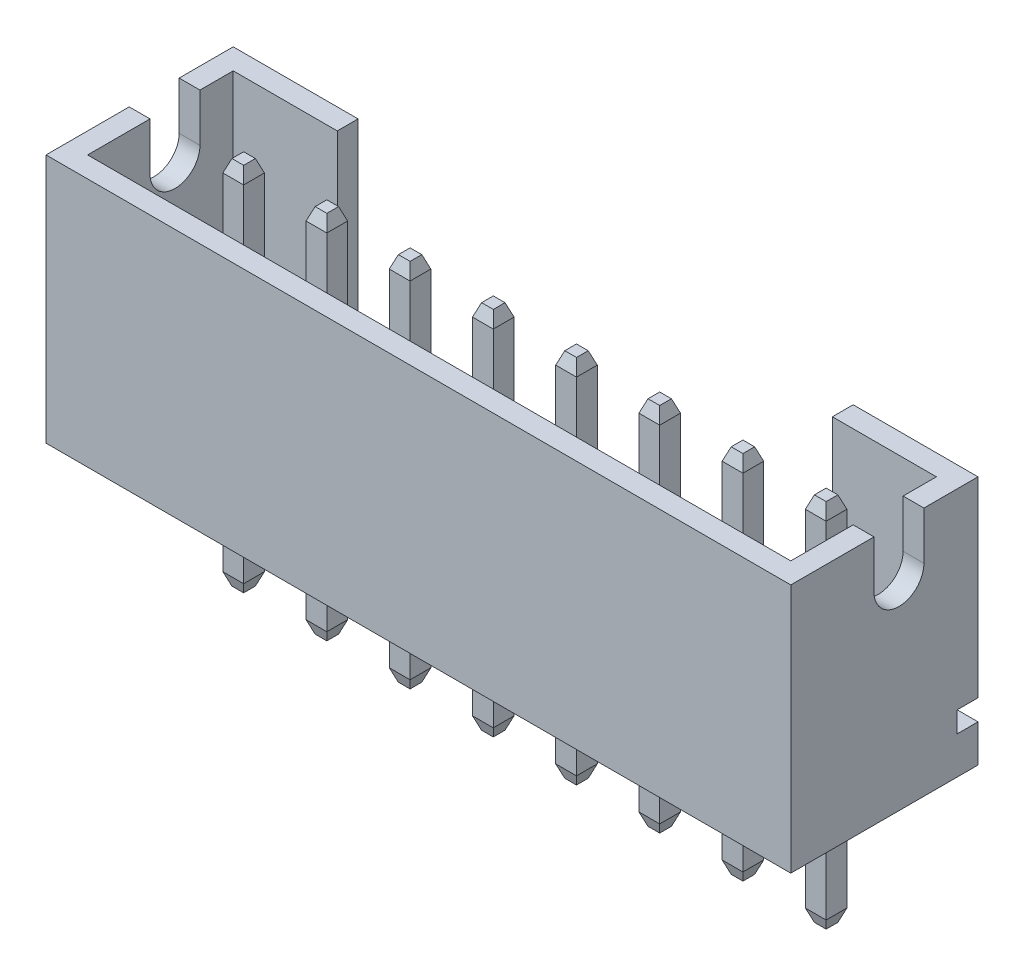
ISO-10303-21;
HEADER;
FILE_DESCRIPTION(('STEP AP214'),'2;1');
FILE_NAME('part.step','',(''),(''),'','','');
FILE_SCHEMA(('AUTOMOTIVE_DESIGN { 1 0 10303 214 1 1 1 1 }'));
ENDSEC;
DATA;
#1=APPLICATION_CONTEXT('core data for automotive mechanical design processes');
#2=APPLICATION_PROTOCOL_DEFINITION('international standard','automotive_design',2000,#1);
#3=PRODUCT_CONTEXT('',#1,'mechanical');
#4=PRODUCT('Part','Part','',(#3));
#5=PRODUCT_RELATED_PRODUCT_CATEGORY('part','',(#4));
#6=PRODUCT_DEFINITION_FORMATION('','',#4);
#7=PRODUCT_DEFINITION_CONTEXT('part definition',#1,'design');
#8=PRODUCT_DEFINITION('design','',#6,#7);
#9=PRODUCT_DEFINITION_SHAPE('','',#8);
#10=(LENGTH_UNIT() NAMED_UNIT(*) SI_UNIT(.MILLI.,.METRE.));
#11=(NAMED_UNIT(*) PLANE_ANGLE_UNIT() SI_UNIT($,.RADIAN.));
#12=(NAMED_UNIT(*) SI_UNIT($,.STERADIAN.) SOLID_ANGLE_UNIT());
#13=UNCERTAINTY_MEASURE_WITH_UNIT(LENGTH_MEASURE(1.E-05),#10,'distance_accuracy_value','');
#14=(GEOMETRIC_REPRESENTATION_CONTEXT(3) GLOBAL_UNCERTAINTY_ASSIGNED_CONTEXT((#13)) GLOBAL_UNIT_ASSIGNED_CONTEXT((#10,
#11,#12)) REPRESENTATION_CONTEXT('',''));
#15=CARTESIAN_POINT('',(0.,0.,0.));
#16=DIRECTION('',(0.,0.,1.));
#17=DIRECTION('',(1.,0.,0.));
#18=AXIS2_PLACEMENT_3D('',#15,#16,#17);
#19=CARTESIAN_POINT('',(-1.95,4.85,0.8));
#20=DIRECTION('',(0.,0.,-1.));
#21=DIRECTION('',(-1.,0.,0.));
#22=AXIS2_PLACEMENT_3D('',#19,#20,#21);
#23=PLANE('',#22);
#24=DIRECTION('',(0.,-1.,0.));
#25=VECTOR('',#24,1.);
#26=CARTESIAN_POINT('',(15.45,4.85,0.8));
#27=LINE('',#26,#25);
#28=CARTESIAN_POINT('',(15.45,6.,0.8));
#29=VERTEX_POINT('',#28);
#30=CARTESIAN_POINT('',(15.45,4.85,0.8));
#31=VERTEX_POINT('',#30);
#32=EDGE_CURVE('E978',#29,#31,#27,.T.);
#33=ORIENTED_EDGE('',*,*,#32,.F.);
#34=DIRECTION('',(1.,0.,0.));
#35=VECTOR('',#34,1.);
#36=CARTESIAN_POINT('',(-1.95,6.,0.8));
#37=LINE('',#36,#35);
#38=CARTESIAN_POINT('',(15.95,6.,0.8));
#39=VERTEX_POINT('',#38);
#40=EDGE_CURVE('E1059',#29,#39,#37,.T.);
#41=ORIENTED_EDGE('',*,*,#40,.T.);
#42=DIRECTION('',(0.,1.,0.));
#43=VECTOR('',#42,1.);
#44=CARTESIAN_POINT('',(15.95,4.85,0.8));
#45=LINE('',#44,#43);
#46=CARTESIAN_POINT('',(15.95,4.85,0.8));
#47=VERTEX_POINT('',#46);
#48=EDGE_CURVE('E1010',#47,#39,#45,.T.);
#49=ORIENTED_EDGE('',*,*,#48,.F.);
#50=DIRECTION('',(1.,0.,0.));
#51=VECTOR('',#50,1.);
#52=CARTESIAN_POINT('',(-1.95,4.85,0.8));
#53=LINE('',#52,#51);
#54=EDGE_CURVE('E1063',#31,#47,#53,.T.);
#55=ORIENTED_EDGE('',*,*,#54,.F.);
#56=EDGE_LOOP('',(#33,#41,#49,#55));
#57=FACE_BOUND('',#56,.T.);
#58=ADVANCED_FACE('F32',(#57),#23,.T.);
#59=CARTESIAN_POINT('',(-1.95,4.85,0.200000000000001));
#60=DIRECTION('',(1.,0.,0.));
#61=DIRECTION('',(0.,0.,-1.));
#62=AXIS2_PLACEMENT_3D('',#59,#60,#61);
#63=CYLINDRICAL_SURFACE('',#62,0.6);
#64=CARTESIAN_POINT('',(15.45,4.85,0.200000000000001));
#65=DIRECTION('',(1.,0.,0.));
#66=DIRECTION('',(0.,0.,-1.));
#67=AXIS2_PLACEMENT_3D('',#64,#65,#66);
#68=CIRCLE('',#67,0.6);
#69=CARTESIAN_POINT('',(15.45,4.85,-0.399999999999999));
#70=VERTEX_POINT('',#69);
#71=EDGE_CURVE('E976',#31,#70,#68,.T.);
#72=ORIENTED_EDGE('',*,*,#71,.F.);
#73=ORIENTED_EDGE('',*,*,#54,.T.);
#74=CARTESIAN_POINT('',(15.95,4.85,0.200000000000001));
#75=DIRECTION('',(-1.,0.,0.));
#76=DIRECTION('',(0.,0.,1.));
#77=AXIS2_PLACEMENT_3D('',#74,#75,#76);
#78=CIRCLE('',#77,0.6);
#79=CARTESIAN_POINT('',(15.95,4.85,-0.399999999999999));
#80=VERTEX_POINT('',#79);
#81=EDGE_CURVE('E1007',#80,#47,#78,.T.);
#82=ORIENTED_EDGE('',*,*,#81,.F.);
#83=DIRECTION('',(1.,0.,0.));
#84=VECTOR('',#83,1.);
#85=CARTESIAN_POINT('',(-1.95,4.85,-0.399999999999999));
#86=LINE('',#85,#84);
#87=EDGE_CURVE('E1067',#70,#80,#86,.T.);
#88=ORIENTED_EDGE('',*,*,#87,.F.);
#89=EDGE_LOOP('',(#72,#73,#82,#88));
#90=FACE_BOUND('',#89,.T.);
#91=ADVANCED_FACE('F1818',(#90),#63,.F.);
#92=CARTESIAN_POINT('',(-1.95,6.,-0.399999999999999));
#93=DIRECTION('',(0.,0.,1.));
#94=DIRECTION('',(1.,0.,0.));
#95=AXIS2_PLACEMENT_3D('',#92,#93,#94);
#96=PLANE('',#95);
#97=DIRECTION('',(0.,1.,0.));
#98=VECTOR('',#97,1.);
#99=CARTESIAN_POINT('',(15.45,6.,-0.399999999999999));
#100=LINE('',#99,#98);
#101=CARTESIAN_POINT('',(15.45,6.,-0.399999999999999));
#102=VERTEX_POINT('',#101);
#103=EDGE_CURVE('E974',#70,#102,#100,.T.);
#104=ORIENTED_EDGE('',*,*,#103,.F.);
#105=ORIENTED_EDGE('',*,*,#87,.T.);
#106=DIRECTION('',(0.,-1.,0.));
#107=VECTOR('',#106,1.);
#108=CARTESIAN_POINT('',(15.95,6.,-0.399999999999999));
#109=LINE('',#108,#107);
#110=CARTESIAN_POINT('',(15.95,6.,-0.399999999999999));
#111=VERTEX_POINT('',#110);
#112=EDGE_CURVE('E1004',#111,#80,#109,.T.);
#113=ORIENTED_EDGE('',*,*,#112,.F.);
#114=DIRECTION('',(1.,0.,0.));
#115=VECTOR('',#114,1.);
#116=CARTESIAN_POINT('',(-1.95,6.,-0.399999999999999));
#117=LINE('',#116,#115);
#118=EDGE_CURVE('E1071',#102,#111,#117,.T.);
#119=ORIENTED_EDGE('',*,*,#118,.F.);
#120=EDGE_LOOP('',(#104,#105,#113,#119));
#121=FACE_BOUND('',#120,.T.);
#122=ADVANCED_FACE('F1825',(#121),#96,.T.);
#123=CARTESIAN_POINT('',(-1.95,6.,-1.7));
#124=DIRECTION('',(0.,1.,0.));
#125=DIRECTION('',(0.,0.,1.));
#126=AXIS2_PLACEMENT_3D('',#123,#124,#125);
#127=PLANE('',#126);
#128=DIRECTION('',(0.,0.,-1.));
#129=VECTOR('',#128,1.);
#130=CARTESIAN_POINT('',(15.45,6.,-1.2));
#131=LINE('',#130,#129);
#132=CARTESIAN_POINT('',(15.45,6.,-1.2));
#133=VERTEX_POINT('',#132);
#134=EDGE_CURVE('E921',#102,#133,#131,.T.);
#135=ORIENTED_EDGE('',*,*,#134,.F.);
#136=ORIENTED_EDGE('',*,*,#118,.T.);
#137=DIRECTION('',(0.,0.,1.));
#138=VECTOR('',#137,1.);
#139=CARTESIAN_POINT('',(15.95,6.,-1.7));
#140=LINE('',#139,#138);
#141=CARTESIAN_POINT('',(15.95,6.,-1.7));
#142=VERTEX_POINT('',#141);
#143=EDGE_CURVE('E1001',#142,#111,#140,.T.);
#144=ORIENTED_EDGE('',*,*,#143,.F.);
#145=DIRECTION('',(1.,0.,0.));
#146=VECTOR('',#145,1.);
#147=CARTESIAN_POINT('',(-1.95,6.,-1.7));
#148=LINE('',#147,#146);
#149=CARTESIAN_POINT('',(12.95,6.,-1.7));
#150=VERTEX_POINT('',#149);
#151=EDGE_CURVE('E1075',#150,#142,#148,.T.);
#152=ORIENTED_EDGE('',*,*,#151,.F.);
#153=DIRECTION('',(0.,0.,-1.));
#154=VECTOR('',#153,1.);
#155=CARTESIAN_POINT('',(12.95,6.,-1.7));
#156=LINE('',#155,#154);
#157=CARTESIAN_POINT('',(12.95,6.,-1.2));
#158=VERTEX_POINT('',#157);
#159=EDGE_CURVE('E914',#158,#150,#156,.T.);
#160=ORIENTED_EDGE('',*,*,#159,.F.);
#161=DIRECTION('',(-1.,0.,0.));
#162=VECTOR('',#161,1.);
#163=CARTESIAN_POINT('',(12.95,6.,-1.2));
#164=LINE('',#163,#162);
#165=EDGE_CURVE('E916',#133,#158,#164,.T.);
#166=ORIENTED_EDGE('',*,*,#165,.F.);
#167=EDGE_LOOP('',(#135,#136,#144,#152,#160,#166));
#168=FACE_BOUND('',#167,.T.);
#169=ADVANCED_FACE('F1917',(#168),#127,.T.);
#170=CARTESIAN_POINT('',(-1.95,6.,2.8));
#171=DIRECTION('',(0.,0.,1.));
#172=DIRECTION('',(0.,-1.,0.));
#173=AXIS2_PLACEMENT_3D('',#170,#171,#172);
#174=PLANE('',#173);
#175=DIRECTION('',(1.,0.,0.));
#176=VECTOR('',#175,1.);
#177=CARTESIAN_POINT('',(-1.95,0.,2.8));
#178=LINE('',#177,#176);
#179=CARTESIAN_POINT('',(-1.95,0.,2.8));
#180=VERTEX_POINT('',#179);
#181=CARTESIAN_POINT('',(15.95,0.,2.8));
#182=VERTEX_POINT('',#181);
#183=EDGE_CURVE('E1052',#180,#182,#178,.T.);
#184=ORIENTED_EDGE('',*,*,#183,.T.);
#185=DIRECTION('',(0.,-1.,0.));
#186=VECTOR('',#185,1.);
#187=CARTESIAN_POINT('',(15.95,6.,2.8));
#188=LINE('',#187,#186);
#189=CARTESIAN_POINT('',(15.95,6.,2.8));
#190=VERTEX_POINT('',#189);
#191=EDGE_CURVE('E980',#190,#182,#188,.T.);
#192=ORIENTED_EDGE('',*,*,#191,.F.);
#193=DIRECTION('',(1.,0.,0.));
#194=VECTOR('',#193,1.);
#195=CARTESIAN_POINT('',(-1.95,6.,2.8));
#196=LINE('',#195,#194);
#197=CARTESIAN_POINT('',(-1.95,6.,2.8));
#198=VERTEX_POINT('',#197);
#199=EDGE_CURVE('E1053',#198,#190,#196,.T.);
#200=ORIENTED_EDGE('',*,*,#199,.F.);
#201=DIRECTION('',(0.,-1.,0.));
#202=VECTOR('',#201,1.);
#203=CARTESIAN_POINT('',(-1.95,6.,2.8));
#204=LINE('',#203,#202);
#205=EDGE_CURVE('E1016',#198,#180,#204,.T.);
#206=ORIENTED_EDGE('',*,*,#205,.T.);
#207=EDGE_LOOP('',(#184,#192,#200,#206));
#208=FACE_BOUND('',#207,.T.);
#209=ADVANCED_FACE('F1840',(#208),#174,.T.);
#210=CARTESIAN_POINT('',(-1.95,6.,0.8));
#211=DIRECTION('',(0.,1.,0.));
#212=DIRECTION('',(0.,0.,1.));
#213=AXIS2_PLACEMENT_3D('',#210,#211,#212);
#214=PLANE('',#213);
#215=CARTESIAN_POINT('',(15.45,6.,2.3));
#216=VERTEX_POINT('',#215);
#217=EDGE_CURVE('E919',#216,#29,#131,.T.);
#218=ORIENTED_EDGE('',*,*,#217,.F.);
#219=DIRECTION('',(1.,0.,0.));
#220=VECTOR('',#219,1.);
#221=CARTESIAN_POINT('',(-1.45,6.,2.3));
#222=LINE('',#221,#220);
#223=CARTESIAN_POINT('',(-1.45,6.,2.3));
#224=VERTEX_POINT('',#223);
#225=EDGE_CURVE('E922',#224,#216,#222,.T.);
#226=ORIENTED_EDGE('',*,*,#225,.F.);
#227=DIRECTION('',(0.,0.,1.));
#228=VECTOR('',#227,1.);
#229=CARTESIAN_POINT('',(-1.45,6.,-1.2));
#230=LINE('',#229,#228);
#231=CARTESIAN_POINT('',(-1.45,6.,0.8));
#232=VERTEX_POINT('',#231);
#233=EDGE_CURVE('E906',#232,#224,#230,.T.);
#234=ORIENTED_EDGE('',*,*,#233,.F.);
#235=CARTESIAN_POINT('',(-1.95,6.,0.8));
#236=VERTEX_POINT('',#235);
#237=EDGE_CURVE('E1056',#236,#232,#37,.T.);
#238=ORIENTED_EDGE('',*,*,#237,.F.);
#239=DIRECTION('',(0.,0.,1.));
#240=VECTOR('',#239,1.);
#241=CARTESIAN_POINT('',(-1.95,6.,0.8));
#242=LINE('',#241,#240);
#243=EDGE_CURVE('E1049',#236,#198,#242,.T.);
#244=ORIENTED_EDGE('',*,*,#243,.T.);
#245=ORIENTED_EDGE('',*,*,#199,.T.);
#246=DIRECTION('',(0.,0.,1.));
#247=VECTOR('',#246,1.);
#248=CARTESIAN_POINT('',(15.95,6.,0.8));
#249=LINE('',#248,#247);
#250=EDGE_CURVE('E1013',#39,#190,#249,.T.);
#251=ORIENTED_EDGE('',*,*,#250,.F.);
#252=ORIENTED_EDGE('',*,*,#40,.F.);
#253=EDGE_LOOP('',(#218,#226,#234,#238,#244,#245,#251,#252));
#254=FACE_BOUND('',#253,.T.);
#255=ADVANCED_FACE('F1832',(#254),#214,.T.);
#256=DIRECTION('',(0.,1.,0.));
#257=VECTOR('',#256,1.);
#258=CARTESIAN_POINT('',(-1.45,4.85,0.8));
#259=LINE('',#258,#257);
#260=CARTESIAN_POINT('',(-1.45,4.85,0.8));
#261=VERTEX_POINT('',#260);
#262=EDGE_CURVE('E972',#261,#232,#259,.T.);
#263=ORIENTED_EDGE('',*,*,#262,.F.);
#264=CARTESIAN_POINT('',(-1.95,4.85,0.8));
#265=VERTEX_POINT('',#264);
#266=EDGE_CURVE('E1060',#265,#261,#53,.T.);
#267=ORIENTED_EDGE('',*,*,#266,.F.);
#268=DIRECTION('',(0.,1.,0.));
#269=VECTOR('',#268,1.);
#270=CARTESIAN_POINT('',(-1.95,4.85,0.8));
#271=LINE('',#270,#269);
#272=EDGE_CURVE('E1046',#265,#236,#271,.T.);
#273=ORIENTED_EDGE('',*,*,#272,.T.);
#274=ORIENTED_EDGE('',*,*,#237,.T.);
#275=EDGE_LOOP('',(#263,#267,#273,#274));
#276=FACE_BOUND('',#275,.T.);
#277=ADVANCED_FACE('F1821',(#276),#23,.T.);
#278=CARTESIAN_POINT('',(-1.45,4.85,0.200000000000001));
#279=DIRECTION('',(-1.,0.,0.));
#280=DIRECTION('',(0.,0.,1.));
#281=AXIS2_PLACEMENT_3D('',#278,#279,#280);
#282=CIRCLE('',#281,0.6);
#283=CARTESIAN_POINT('',(-1.45,4.85,-0.399999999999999));
#284=VERTEX_POINT('',#283);
#285=EDGE_CURVE('E970',#284,#261,#282,.T.);
#286=ORIENTED_EDGE('',*,*,#285,.F.);
#287=CARTESIAN_POINT('',(-1.95,4.85,-0.399999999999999));
#288=VERTEX_POINT('',#287);
#289=EDGE_CURVE('E1064',#288,#284,#86,.T.);
#290=ORIENTED_EDGE('',*,*,#289,.F.);
#291=CARTESIAN_POINT('',(-1.95,4.85,0.200000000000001));
#292=DIRECTION('',(-1.,0.,0.));
#293=DIRECTION('',(0.,0.,1.));
#294=AXIS2_PLACEMENT_3D('',#291,#292,#293);
#295=CIRCLE('',#294,0.6);
#296=EDGE_CURVE('E1043',#288,#265,#295,.T.);
#297=ORIENTED_EDGE('',*,*,#296,.T.);
#298=ORIENTED_EDGE('',*,*,#266,.T.);
#299=EDGE_LOOP('',(#286,#290,#297,#298));
#300=FACE_BOUND('',#299,.T.);
#301=ADVANCED_FACE('F1828',(#300),#63,.F.);
#302=DIRECTION('',(0.,-1.,0.));
#303=VECTOR('',#302,1.);
#304=CARTESIAN_POINT('',(-1.45,6.,-0.399999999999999));
#305=LINE('',#304,#303);
#306=CARTESIAN_POINT('',(-1.45,6.,-0.399999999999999));
#307=VERTEX_POINT('',#306);
#308=EDGE_CURVE('E968',#307,#284,#305,.T.);
#309=ORIENTED_EDGE('',*,*,#308,.F.);
#310=CARTESIAN_POINT('',(-1.95,6.,-0.399999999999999));
#311=VERTEX_POINT('',#310);
#312=EDGE_CURVE('E1068',#311,#307,#117,.T.);
#313=ORIENTED_EDGE('',*,*,#312,.F.);
#314=DIRECTION('',(0.,-1.,0.));
#315=VECTOR('',#314,1.);
#316=CARTESIAN_POINT('',(-1.95,6.,-0.399999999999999));
#317=LINE('',#316,#315);
#318=EDGE_CURVE('E1040',#311,#288,#317,.T.);
#319=ORIENTED_EDGE('',*,*,#318,.T.);
#320=ORIENTED_EDGE('',*,*,#289,.T.);
#321=EDGE_LOOP('',(#309,#313,#319,#320));
#322=FACE_BOUND('',#321,.T.);
#323=ADVANCED_FACE('F1838',(#322),#96,.T.);
#324=DIRECTION('',(0.,0.,1.));
#325=VECTOR('',#324,1.);
#326=CARTESIAN_POINT('',(1.05,6.,-1.7));
#327=LINE('',#326,#325);
#328=CARTESIAN_POINT('',(1.05,6.,-1.7));
#329=VERTEX_POINT('',#328);
#330=CARTESIAN_POINT('',(1.05,6.,-1.2));
#331=VERTEX_POINT('',#330);
#332=EDGE_CURVE('E911',#329,#331,#327,.T.);
#333=ORIENTED_EDGE('',*,*,#332,.F.);
#334=CARTESIAN_POINT('',(-1.95,6.,-1.7));
#335=VERTEX_POINT('',#334);
#336=EDGE_CURVE('E1072',#335,#329,#148,.T.);
#337=ORIENTED_EDGE('',*,*,#336,.F.);
#338=DIRECTION('',(0.,0.,1.));
#339=VECTOR('',#338,1.);
#340=CARTESIAN_POINT('',(-1.95,6.,-1.7));
#341=LINE('',#340,#339);
#342=EDGE_CURVE('E1037',#335,#311,#341,.T.);
#343=ORIENTED_EDGE('',*,*,#342,.T.);
#344=ORIENTED_EDGE('',*,*,#312,.T.);
#345=CARTESIAN_POINT('',(-1.45,6.,-1.2));
#346=VERTEX_POINT('',#345);
#347=EDGE_CURVE('E925',#346,#307,#230,.T.);
#348=ORIENTED_EDGE('',*,*,#347,.F.);
#349=DIRECTION('',(-1.,0.,0.));
#350=VECTOR('',#349,1.);
#351=CARTESIAN_POINT('',(-1.45,6.,-1.2));
#352=LINE('',#351,#350);
#353=EDGE_CURVE('E907',#331,#346,#352,.T.);
#354=ORIENTED_EDGE('',*,*,#353,.F.);
#355=EDGE_LOOP('',(#333,#337,#343,#344,#348,#354));
#356=FACE_BOUND('',#355,.T.);
#357=ADVANCED_FACE('F1857',(#356),#127,.T.);
#358=CARTESIAN_POINT('',(-1.95,1.4,-1.7));
#359=DIRECTION('',(0.,0.,-1.));
#360=DIRECTION('',(0.,1.,0.));
#361=AXIS2_PLACEMENT_3D('',#358,#359,#360);
#362=PLANE('',#361);
#363=DIRECTION('',(0.,1.,0.));
#364=VECTOR('',#363,1.);
#365=CARTESIAN_POINT('',(12.95,-17.3669225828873,-1.7));
#366=LINE('',#365,#364);
#367=CARTESIAN_POINT('',(12.95,2.,-1.7));
#368=VERTEX_POINT('',#367);
#369=EDGE_CURVE('E945',#368,#150,#366,.T.);
#370=ORIENTED_EDGE('',*,*,#369,.T.);
#371=ORIENTED_EDGE('',*,*,#151,.T.);
#372=DIRECTION('',(0.,1.,0.));
#373=VECTOR('',#372,1.);
#374=CARTESIAN_POINT('',(15.95,1.4,-1.7));
#375=LINE('',#374,#373);
#376=CARTESIAN_POINT('',(15.95,1.4,-1.7));
#377=VERTEX_POINT('',#376);
#378=EDGE_CURVE('E998',#377,#142,#375,.T.);
#379=ORIENTED_EDGE('',*,*,#378,.F.);
#380=DIRECTION('',(1.,0.,0.));
#381=VECTOR('',#380,1.);
#382=CARTESIAN_POINT('',(-1.95,1.4,-1.7));
#383=LINE('',#382,#381);
#384=CARTESIAN_POINT('',(-1.95,1.4,-1.7));
#385=VERTEX_POINT('',#384);
#386=EDGE_CURVE('E1076',#385,#377,#383,.T.);
#387=ORIENTED_EDGE('',*,*,#386,.F.);
#388=DIRECTION('',(0.,1.,0.));
#389=VECTOR('',#388,1.);
#390=CARTESIAN_POINT('',(-1.95,1.4,-1.7));
#391=LINE('',#390,#389);
#392=EDGE_CURVE('E1034',#385,#335,#391,.T.);
#393=ORIENTED_EDGE('',*,*,#392,.T.);
#394=ORIENTED_EDGE('',*,*,#336,.T.);
#395=DIRECTION('',(0.,1.,0.));
#396=VECTOR('',#395,1.);
#397=CARTESIAN_POINT('',(1.05,-17.3669225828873,-1.7));
#398=LINE('',#397,#396);
#399=CARTESIAN_POINT('',(1.05,2.,-1.7));
#400=VERTEX_POINT('',#399);
#401=EDGE_CURVE('E942',#400,#329,#398,.T.);
#402=ORIENTED_EDGE('',*,*,#401,.F.);
#403=DIRECTION('',(-1.,0.,0.));
#404=VECTOR('',#403,1.);
#405=CARTESIAN_POINT('',(1.05,2.,-1.7));
#406=LINE('',#405,#404);
#407=EDGE_CURVE('E943',#368,#400,#406,.T.);
#408=ORIENTED_EDGE('',*,*,#407,.F.);
#409=EDGE_LOOP('',(#370,#371,#379,#387,#393,#394,#402,#408));
#410=FACE_BOUND('',#409,.T.);
#411=ADVANCED_FACE('F1862',(#410),#362,.T.);
#412=CARTESIAN_POINT('',(-1.95,1.4,-1.7));
#413=DIRECTION('',(0.,-1.,0.));
#414=DIRECTION('',(0.,0.,-1.));
#415=AXIS2_PLACEMENT_3D('',#412,#413,#414);
#416=PLANE('',#415);
#417=ORIENTED_EDGE('',*,*,#386,.T.);
#418=DIRECTION('',(0.,0.,-1.));
#419=VECTOR('',#418,1.);
#420=CARTESIAN_POINT('',(15.95,1.4,-1.7));
#421=LINE('',#420,#419);
#422=CARTESIAN_POINT('',(15.95,1.4,-1.2));
#423=VERTEX_POINT('',#422);
#424=EDGE_CURVE('E995',#423,#377,#421,.T.);
#425=ORIENTED_EDGE('',*,*,#424,.F.);
#426=DIRECTION('',(1.,0.,0.));
#427=VECTOR('',#426,1.);
#428=CARTESIAN_POINT('',(-1.95,1.4,-1.2));
#429=LINE('',#428,#427);
#430=CARTESIAN_POINT('',(-1.95,1.4,-1.2));
#431=VERTEX_POINT('',#430);
#432=EDGE_CURVE('E1078',#431,#423,#429,.T.);
#433=ORIENTED_EDGE('',*,*,#432,.F.);
#434=DIRECTION('',(0.,0.,-1.));
#435=VECTOR('',#434,1.);
#436=CARTESIAN_POINT('',(-1.95,1.4,-1.7));
#437=LINE('',#436,#435);
#438=EDGE_CURVE('E1031',#431,#385,#437,.T.);
#439=ORIENTED_EDGE('',*,*,#438,.T.);
#440=EDGE_LOOP('',(#417,#425,#433,#439));
#441=FACE_BOUND('',#440,.T.);
#442=ADVANCED_FACE('F1867',(#441),#416,.T.);
#443=CARTESIAN_POINT('',(-1.95,0.900000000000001,-1.2));
#444=DIRECTION('',(0.,0.,-1.));
#445=DIRECTION('',(0.,1.,0.));
#446=AXIS2_PLACEMENT_3D('',#443,#444,#445);
#447=PLANE('',#446);
#448=ORIENTED_EDGE('',*,*,#432,.T.);
#449=DIRECTION('',(0.,1.,0.));
#450=VECTOR('',#449,1.);
#451=CARTESIAN_POINT('',(15.95,0.900000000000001,-1.2));
#452=LINE('',#451,#450);
#453=CARTESIAN_POINT('',(15.95,0.900000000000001,-1.2));
#454=VERTEX_POINT('',#453);
#455=EDGE_CURVE('E992',#454,#423,#452,.T.);
#456=ORIENTED_EDGE('',*,*,#455,.F.);
#457=DIRECTION('',(1.,0.,0.));
#458=VECTOR('',#457,1.);
#459=CARTESIAN_POINT('',(-1.95,0.900000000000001,-1.2));
#460=LINE('',#459,#458);
#461=CARTESIAN_POINT('',(-1.95,0.900000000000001,-1.2));
#462=VERTEX_POINT('',#461);
#463=EDGE_CURVE('E1080',#462,#454,#460,.T.);
#464=ORIENTED_EDGE('',*,*,#463,.F.);
#465=DIRECTION('',(0.,1.,0.));
#466=VECTOR('',#465,1.);
#467=CARTESIAN_POINT('',(-1.95,0.900000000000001,-1.2));
#468=LINE('',#467,#466);
#469=EDGE_CURVE('E1028',#462,#431,#468,.T.);
#470=ORIENTED_EDGE('',*,*,#469,.T.);
#471=EDGE_LOOP('',(#448,#456,#464,#470));
#472=FACE_BOUND('',#471,.T.);
#473=ADVANCED_FACE('F1873',(#472),#447,.T.);
#474=CARTESIAN_POINT('',(-1.95,0.900000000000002,-1.7));
#475=DIRECTION('',(0.,1.,0.));
#476=DIRECTION('',(0.,0.,1.));
#477=AXIS2_PLACEMENT_3D('',#474,#475,#476);
#478=PLANE('',#477);
#479=ORIENTED_EDGE('',*,*,#463,.T.);
#480=DIRECTION('',(0.,0.,1.));
#481=VECTOR('',#480,1.);
#482=CARTESIAN_POINT('',(15.95,0.900000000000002,-1.7));
#483=LINE('',#482,#481);
#484=CARTESIAN_POINT('',(15.95,0.900000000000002,-1.7));
#485=VERTEX_POINT('',#484);
#486=EDGE_CURVE('E989',#485,#454,#483,.T.);
#487=ORIENTED_EDGE('',*,*,#486,.F.);
#488=DIRECTION('',(1.,0.,0.));
#489=VECTOR('',#488,1.);
#490=CARTESIAN_POINT('',(-1.95,0.900000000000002,-1.7));
#491=LINE('',#490,#489);
#492=CARTESIAN_POINT('',(-1.95,0.900000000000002,-1.7));
#493=VERTEX_POINT('',#492);
#494=EDGE_CURVE('E1082',#493,#485,#491,.T.);
#495=ORIENTED_EDGE('',*,*,#494,.F.);
#496=DIRECTION('',(0.,0.,1.));
#497=VECTOR('',#496,1.);
#498=CARTESIAN_POINT('',(-1.95,0.900000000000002,-1.7));
#499=LINE('',#498,#497);
#500=EDGE_CURVE('E1025',#493,#462,#499,.T.);
#501=ORIENTED_EDGE('',*,*,#500,.T.);
#502=EDGE_LOOP('',(#479,#487,#495,#501));
#503=FACE_BOUND('',#502,.T.);
#504=ADVANCED_FACE('F1812',(#503),#478,.T.);
#505=CARTESIAN_POINT('',(-1.95,0.,-1.7));
#506=DIRECTION('',(0.,0.,-1.));
#507=DIRECTION('',(-1.,0.,0.));
#508=AXIS2_PLACEMENT_3D('',#505,#506,#507);
#509=PLANE('',#508);
#510=ORIENTED_EDGE('',*,*,#494,.T.);
#511=DIRECTION('',(0.,1.,0.));
#512=VECTOR('',#511,1.);
#513=CARTESIAN_POINT('',(15.95,0.,-1.7));
#514=LINE('',#513,#512);
#515=CARTESIAN_POINT('',(15.95,0.,-1.7));
#516=VERTEX_POINT('',#515);
#517=EDGE_CURVE('E986',#516,#485,#514,.T.);
#518=ORIENTED_EDGE('',*,*,#517,.F.);
#519=DIRECTION('',(1.,0.,0.));
#520=VECTOR('',#519,1.);
#521=CARTESIAN_POINT('',(-1.95,0.,-1.7));
#522=LINE('',#521,#520);
#523=CARTESIAN_POINT('',(-1.95,0.,-1.7));
#524=VERTEX_POINT('',#523);
#525=EDGE_CURVE('E1084',#524,#516,#522,.T.);
#526=ORIENTED_EDGE('',*,*,#525,.F.);
#527=DIRECTION('',(0.,1.,0.));
#528=VECTOR('',#527,1.);
#529=CARTESIAN_POINT('',(-1.95,0.,-1.7));
#530=LINE('',#529,#528);
#531=EDGE_CURVE('E1022',#524,#493,#530,.T.);
#532=ORIENTED_EDGE('',*,*,#531,.T.);
#533=EDGE_LOOP('',(#510,#518,#526,#532));
#534=FACE_BOUND('',#533,.T.);
#535=ADVANCED_FACE('F1802',(#534),#509,.T.);
#536=CARTESIAN_POINT('',(-1.95,0.,2.8));
#537=DIRECTION('',(0.,-1.,0.));
#538=DIRECTION('',(0.,0.,-1.));
#539=AXIS2_PLACEMENT_3D('',#536,#537,#538);
#540=PLANE('',#539);
#541=DIRECTION('',(0.,0.,-1.));
#542=VECTOR('',#541,1.);
#543=CARTESIAN_POINT('',(1.75,0.,2.8));
#544=LINE('',#543,#542);
#545=CARTESIAN_POINT('',(1.75,0.,0.25));
#546=VERTEX_POINT('',#545);
#547=CARTESIAN_POINT('',(1.75,0.,-0.25));
#548=VERTEX_POINT('',#547);
#549=EDGE_CURVE('E821',#546,#548,#544,.T.);
#550=ORIENTED_EDGE('',*,*,#549,.F.);
#551=DIRECTION('',(-1.,0.,0.));
#552=VECTOR('',#551,1.);
#553=CARTESIAN_POINT('',(0.0500000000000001,0.,0.25));
#554=LINE('',#553,#552);
#555=CARTESIAN_POINT('',(2.25,0.,0.25));
#556=VERTEX_POINT('',#555);
#557=EDGE_CURVE('E780',#556,#546,#554,.T.);
#558=ORIENTED_EDGE('',*,*,#557,.F.);
#559=DIRECTION('',(0.,0.,1.));
#560=VECTOR('',#559,1.);
#561=CARTESIAN_POINT('',(2.25,0.,2.8));
#562=LINE('',#561,#560);
#563=CARTESIAN_POINT('',(2.25,0.,-0.25));
#564=VERTEX_POINT('',#563);
#565=EDGE_CURVE('E812',#564,#556,#562,.T.);
#566=ORIENTED_EDGE('',*,*,#565,.F.);
#567=DIRECTION('',(1.,0.,0.));
#568=VECTOR('',#567,1.);
#569=CARTESIAN_POINT('',(0.0500000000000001,0.,-0.25));
#570=LINE('',#569,#568);
#571=EDGE_CURVE('E818',#548,#564,#570,.T.);
#572=ORIENTED_EDGE('',*,*,#571,.F.);
#573=EDGE_LOOP('',(#550,#558,#566,#572));
#574=FACE_BOUND('',#573,.T.);
#575=DIRECTION('',(0.,0.,-1.));
#576=VECTOR('',#575,1.);
#577=CARTESIAN_POINT('',(-0.25,0.,2.8));
#578=LINE('',#577,#576);
#579=CARTESIAN_POINT('',(-0.25,0.,0.25));
#580=VERTEX_POINT('',#579);
#581=CARTESIAN_POINT('',(-0.25,0.,-0.25));
#582=VERTEX_POINT('',#581);
#583=EDGE_CURVE('E903',#580,#582,#578,.T.);
#584=ORIENTED_EDGE('',*,*,#583,.F.);
#585=DIRECTION('',(-1.,0.,0.));
#586=VECTOR('',#585,1.);
#587=CARTESIAN_POINT('',(-1.95,0.,0.25));
#588=LINE('',#587,#586);
#589=CARTESIAN_POINT('',(0.25,0.,0.25));
#590=VERTEX_POINT('',#589);
#591=EDGE_CURVE('E884',#590,#580,#588,.T.);
#592=ORIENTED_EDGE('',*,*,#591,.F.);
#593=DIRECTION('',(0.,0.,1.));
#594=VECTOR('',#593,1.);
#595=CARTESIAN_POINT('',(0.25,0.,2.8));
#596=LINE('',#595,#594);
#597=CARTESIAN_POINT('',(0.25,0.,-0.25));
#598=VERTEX_POINT('',#597);
#599=EDGE_CURVE('E897',#598,#590,#596,.T.);
#600=ORIENTED_EDGE('',*,*,#599,.F.);
#601=DIRECTION('',(1.,0.,0.));
#602=VECTOR('',#601,1.);
#603=CARTESIAN_POINT('',(-1.95,0.,-0.25));
#604=LINE('',#603,#602);
#605=EDGE_CURVE('E900',#582,#598,#604,.T.);
#606=ORIENTED_EDGE('',*,*,#605,.F.);
#607=EDGE_LOOP('',(#584,#592,#600,#606));
#608=FACE_BOUND('',#607,.T.);
#609=ORIENTED_EDGE('',*,*,#525,.T.);
#610=DIRECTION('',(0.,0.,-1.));
#611=VECTOR('',#610,1.);
#612=CARTESIAN_POINT('',(15.95,0.,2.8));
#613=LINE('',#612,#611);
#614=EDGE_CURVE('E983',#182,#516,#613,.T.);
#615=ORIENTED_EDGE('',*,*,#614,.F.);
#616=ORIENTED_EDGE('',*,*,#183,.F.);
#617=DIRECTION('',(0.,0.,-1.));
#618=VECTOR('',#617,1.);
#619=CARTESIAN_POINT('',(-1.95,0.,2.8));
#620=LINE('',#619,#618);
#621=EDGE_CURVE('E1019',#180,#524,#620,.T.);
#622=ORIENTED_EDGE('',*,*,#621,.T.);
#623=EDGE_LOOP('',(#609,#615,#616,#622));
#624=FACE_BOUND('',#623,.T.);
#625=DIRECTION('',(0.,0.,-1.));
#626=VECTOR('',#625,1.);
#627=CARTESIAN_POINT('',(3.75,0.,2.8));
#628=LINE('',#627,#626);
#629=CARTESIAN_POINT('',(3.75,0.,0.25));
#630=VERTEX_POINT('',#629);
#631=CARTESIAN_POINT('',(3.75,0.,-0.25));
#632=VERTEX_POINT('',#631);
#633=EDGE_CURVE('E1453',#630,#632,#628,.T.);
#634=ORIENTED_EDGE('',*,*,#633,.F.);
#635=DIRECTION('',(-1.,0.,0.));
#636=VECTOR('',#635,1.);
#637=CARTESIAN_POINT('',(2.05,0.,0.25));
#638=LINE('',#637,#636);
#639=CARTESIAN_POINT('',(4.25,0.,0.25));
#640=VERTEX_POINT('',#639);
#641=EDGE_CURVE('E1455',#640,#630,#638,.T.);
#642=ORIENTED_EDGE('',*,*,#641,.F.);
#643=DIRECTION('',(0.,0.,1.));
#644=VECTOR('',#643,1.);
#645=CARTESIAN_POINT('',(4.25,0.,2.8));
#646=LINE('',#645,#644);
#647=CARTESIAN_POINT('',(4.25,0.,-0.25));
#648=VERTEX_POINT('',#647);
#649=EDGE_CURVE('E1458',#648,#640,#646,.T.);
#650=ORIENTED_EDGE('',*,*,#649,.F.);
#651=DIRECTION('',(1.,0.,0.));
#652=VECTOR('',#651,1.);
#653=CARTESIAN_POINT('',(2.05,0.,-0.25));
#654=LINE('',#653,#652);
#655=EDGE_CURVE('E1461',#632,#648,#654,.T.);
#656=ORIENTED_EDGE('',*,*,#655,.F.);
#657=EDGE_LOOP('',(#634,#642,#650,#656));
#658=FACE_BOUND('',#657,.T.);
#659=DIRECTION('',(0.,0.,-1.));
#660=VECTOR('',#659,1.);
#661=CARTESIAN_POINT('',(5.75,0.,2.8));
#662=LINE('',#661,#660);
#663=CARTESIAN_POINT('',(5.75,0.,0.25));
#664=VERTEX_POINT('',#663);
#665=CARTESIAN_POINT('',(5.75,0.,-0.25));
#666=VERTEX_POINT('',#665);
#667=EDGE_CURVE('E1508',#664,#666,#662,.T.);
#668=ORIENTED_EDGE('',*,*,#667,.F.);
#669=DIRECTION('',(-1.,0.,0.));
#670=VECTOR('',#669,1.);
#671=CARTESIAN_POINT('',(4.05,0.,0.25));
#672=LINE('',#671,#670);
#673=CARTESIAN_POINT('',(6.25,0.,0.25));
#674=VERTEX_POINT('',#673);
#675=EDGE_CURVE('E1510',#674,#664,#672,.T.);
#676=ORIENTED_EDGE('',*,*,#675,.F.);
#677=DIRECTION('',(0.,0.,1.));
#678=VECTOR('',#677,1.);
#679=CARTESIAN_POINT('',(6.25,0.,2.8));
#680=LINE('',#679,#678);
#681=CARTESIAN_POINT('',(6.25,0.,-0.25));
#682=VERTEX_POINT('',#681);
#683=EDGE_CURVE('E1513',#682,#674,#680,.T.);
#684=ORIENTED_EDGE('',*,*,#683,.F.);
#685=DIRECTION('',(1.,0.,0.));
#686=VECTOR('',#685,1.);
#687=CARTESIAN_POINT('',(4.05,0.,-0.25));
#688=LINE('',#687,#686);
#689=EDGE_CURVE('E1516',#666,#682,#688,.T.);
#690=ORIENTED_EDGE('',*,*,#689,.F.);
#691=EDGE_LOOP('',(#668,#676,#684,#690));
#692=FACE_BOUND('',#691,.T.);
#693=DIRECTION('',(0.,0.,-1.));
#694=VECTOR('',#693,1.);
#695=CARTESIAN_POINT('',(7.75,0.,2.8));
#696=LINE('',#695,#694);
#697=CARTESIAN_POINT('',(7.75,0.,0.25));
#698=VERTEX_POINT('',#697);
#699=CARTESIAN_POINT('',(7.75,0.,-0.25));
#700=VERTEX_POINT('',#699);
#701=EDGE_CURVE('E1563',#698,#700,#696,.T.);
#702=ORIENTED_EDGE('',*,*,#701,.F.);
#703=DIRECTION('',(-1.,0.,0.));
#704=VECTOR('',#703,1.);
#705=CARTESIAN_POINT('',(6.05,0.,0.25));
#706=LINE('',#705,#704);
#707=CARTESIAN_POINT('',(8.25,0.,0.25));
#708=VERTEX_POINT('',#707);
#709=EDGE_CURVE('E1565',#708,#698,#706,.T.);
#710=ORIENTED_EDGE('',*,*,#709,.F.);
#711=DIRECTION('',(0.,0.,1.));
#712=VECTOR('',#711,1.);
#713=CARTESIAN_POINT('',(8.25,0.,2.8));
#714=LINE('',#713,#712);
#715=CARTESIAN_POINT('',(8.25,0.,-0.25));
#716=VERTEX_POINT('',#715);
#717=EDGE_CURVE('E1568',#716,#708,#714,.T.);
#718=ORIENTED_EDGE('',*,*,#717,.F.);
#719=DIRECTION('',(1.,0.,0.));
#720=VECTOR('',#719,1.);
#721=CARTESIAN_POINT('',(6.05,0.,-0.25));
#722=LINE('',#721,#720);
#723=EDGE_CURVE('E1571',#700,#716,#722,.T.);
#724=ORIENTED_EDGE('',*,*,#723,.F.);
#725=EDGE_LOOP('',(#702,#710,#718,#724));
#726=FACE_BOUND('',#725,.T.);
#727=DIRECTION('',(0.,0.,-1.));
#728=VECTOR('',#727,1.);
#729=CARTESIAN_POINT('',(9.75,0.,2.8));
#730=LINE('',#729,#728);
#731=CARTESIAN_POINT('',(9.75,0.,0.25));
#732=VERTEX_POINT('',#731);
#733=CARTESIAN_POINT('',(9.75,0.,-0.25));
#734=VERTEX_POINT('',#733);
#735=EDGE_CURVE('E1618',#732,#734,#730,.T.);
#736=ORIENTED_EDGE('',*,*,#735,.F.);
#737=DIRECTION('',(-1.,0.,0.));
#738=VECTOR('',#737,1.);
#739=CARTESIAN_POINT('',(8.05,0.,0.25));
#740=LINE('',#739,#738);
#741=CARTESIAN_POINT('',(10.25,0.,0.25));
#742=VERTEX_POINT('',#741);
#743=EDGE_CURVE('E1620',#742,#732,#740,.T.);
#744=ORIENTED_EDGE('',*,*,#743,.F.);
#745=DIRECTION('',(0.,0.,1.));
#746=VECTOR('',#745,1.);
#747=CARTESIAN_POINT('',(10.25,0.,2.8));
#748=LINE('',#747,#746);
#749=CARTESIAN_POINT('',(10.25,0.,-0.25));
#750=VERTEX_POINT('',#749);
#751=EDGE_CURVE('E1623',#750,#742,#748,.T.);
#752=ORIENTED_EDGE('',*,*,#751,.F.);
#753=DIRECTION('',(1.,0.,0.));
#754=VECTOR('',#753,1.);
#755=CARTESIAN_POINT('',(8.05,0.,-0.25));
#756=LINE('',#755,#754);
#757=EDGE_CURVE('E1626',#734,#750,#756,.T.);
#758=ORIENTED_EDGE('',*,*,#757,.F.);
#759=EDGE_LOOP('',(#736,#744,#752,#758));
#760=FACE_BOUND('',#759,.T.);
#761=DIRECTION('',(0.,0.,-1.));
#762=VECTOR('',#761,1.);
#763=CARTESIAN_POINT('',(11.75,0.,2.8));
#764=LINE('',#763,#762);
#765=CARTESIAN_POINT('',(11.75,0.,0.25));
#766=VERTEX_POINT('',#765);
#767=CARTESIAN_POINT('',(11.75,0.,-0.25));
#768=VERTEX_POINT('',#767);
#769=EDGE_CURVE('E1673',#766,#768,#764,.T.);
#770=ORIENTED_EDGE('',*,*,#769,.F.);
#771=DIRECTION('',(-1.,0.,0.));
#772=VECTOR('',#771,1.);
#773=CARTESIAN_POINT('',(10.05,0.,0.25));
#774=LINE('',#773,#772);
#775=CARTESIAN_POINT('',(12.25,0.,0.25));
#776=VERTEX_POINT('',#775);
#777=EDGE_CURVE('E1675',#776,#766,#774,.T.);
#778=ORIENTED_EDGE('',*,*,#777,.F.);
#779=DIRECTION('',(0.,0.,1.));
#780=VECTOR('',#779,1.);
#781=CARTESIAN_POINT('',(12.25,0.,2.8));
#782=LINE('',#781,#780);
#783=CARTESIAN_POINT('',(12.25,0.,-0.25));
#784=VERTEX_POINT('',#783);
#785=EDGE_CURVE('E1678',#784,#776,#782,.T.);
#786=ORIENTED_EDGE('',*,*,#785,.F.);
#787=DIRECTION('',(1.,0.,0.));
#788=VECTOR('',#787,1.);
#789=CARTESIAN_POINT('',(10.05,0.,-0.25));
#790=LINE('',#789,#788);
#791=EDGE_CURVE('E1681',#768,#784,#790,.T.);
#792=ORIENTED_EDGE('',*,*,#791,.F.);
#793=EDGE_LOOP('',(#770,#778,#786,#792));
#794=FACE_BOUND('',#793,.T.);
#795=DIRECTION('',(0.,0.,-1.));
#796=VECTOR('',#795,1.);
#797=CARTESIAN_POINT('',(13.75,0.,2.8));
#798=LINE('',#797,#796);
#799=CARTESIAN_POINT('',(13.75,0.,0.25));
#800=VERTEX_POINT('',#799);
#801=CARTESIAN_POINT('',(13.75,0.,-0.25));
#802=VERTEX_POINT('',#801);
#803=EDGE_CURVE('E1728',#800,#802,#798,.T.);
#804=ORIENTED_EDGE('',*,*,#803,.F.);
#805=DIRECTION('',(-1.,0.,0.));
#806=VECTOR('',#805,1.);
#807=CARTESIAN_POINT('',(12.05,0.,0.25));
#808=LINE('',#807,#806);
#809=CARTESIAN_POINT('',(14.25,0.,0.25));
#810=VERTEX_POINT('',#809);
#811=EDGE_CURVE('E1730',#810,#800,#808,.T.);
#812=ORIENTED_EDGE('',*,*,#811,.F.);
#813=DIRECTION('',(0.,0.,1.));
#814=VECTOR('',#813,1.);
#815=CARTESIAN_POINT('',(14.25,0.,2.8));
#816=LINE('',#815,#814);
#817=CARTESIAN_POINT('',(14.25,0.,-0.25));
#818=VERTEX_POINT('',#817);
#819=EDGE_CURVE('E1733',#818,#810,#816,.T.);
#820=ORIENTED_EDGE('',*,*,#819,.F.);
#821=DIRECTION('',(1.,0.,0.));
#822=VECTOR('',#821,1.);
#823=CARTESIAN_POINT('',(12.05,0.,-0.25));
#824=LINE('',#823,#822);
#825=EDGE_CURVE('E1736',#802,#818,#824,.T.);
#826=ORIENTED_EDGE('',*,*,#825,.F.);
#827=EDGE_LOOP('',(#804,#812,#820,#826));
#828=FACE_BOUND('',#827,.T.);
#829=ADVANCED_FACE('F1799',(#574,#608,#624,#658,#692,#726,#760,#794,#828),#540,.T.);
#830=CARTESIAN_POINT('',(-1.95,4.85,0.200000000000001));
#831=DIRECTION('',(-1.,0.,0.));
#832=DIRECTION('',(0.,0.,1.));
#833=AXIS2_PLACEMENT_3D('',#830,#831,#832);
#834=PLANE('',#833);
#835=ORIENTED_EDGE('',*,*,#205,.F.);
#836=ORIENTED_EDGE('',*,*,#243,.F.);
#837=ORIENTED_EDGE('',*,*,#272,.F.);
#838=ORIENTED_EDGE('',*,*,#296,.F.);
#839=ORIENTED_EDGE('',*,*,#318,.F.);
#840=ORIENTED_EDGE('',*,*,#342,.F.);
#841=ORIENTED_EDGE('',*,*,#392,.F.);
#842=ORIENTED_EDGE('',*,*,#438,.F.);
#843=ORIENTED_EDGE('',*,*,#469,.F.);
#844=ORIENTED_EDGE('',*,*,#500,.F.);
#845=ORIENTED_EDGE('',*,*,#531,.F.);
#846=ORIENTED_EDGE('',*,*,#621,.F.);
#847=EDGE_LOOP('',(#835,#836,#837,#838,#839,#840,#841,#842,#843,#844,#845,#846));
#848=FACE_BOUND('',#847,.T.);
#849=ADVANCED_FACE('F1801',(#848),#834,.T.);
#850=CARTESIAN_POINT('',(15.95,4.85,0.200000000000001));
#851=DIRECTION('',(-1.,0.,0.));
#852=DIRECTION('',(0.,0.,1.));
#853=AXIS2_PLACEMENT_3D('',#850,#851,#852);
#854=PLANE('',#853);
#855=ORIENTED_EDGE('',*,*,#191,.T.);
#856=ORIENTED_EDGE('',*,*,#614,.T.);
#857=ORIENTED_EDGE('',*,*,#517,.T.);
#858=ORIENTED_EDGE('',*,*,#486,.T.);
#859=ORIENTED_EDGE('',*,*,#455,.T.);
#860=ORIENTED_EDGE('',*,*,#424,.T.);
#861=ORIENTED_EDGE('',*,*,#378,.T.);
#862=ORIENTED_EDGE('',*,*,#143,.T.);
#863=ORIENTED_EDGE('',*,*,#112,.T.);
#864=ORIENTED_EDGE('',*,*,#81,.T.);
#865=ORIENTED_EDGE('',*,*,#48,.T.);
#866=ORIENTED_EDGE('',*,*,#250,.T.);
#867=EDGE_LOOP('',(#855,#856,#857,#858,#859,#860,#861,#862,#863,#864,#865,#866));
#868=FACE_BOUND('',#867,.T.);
#869=ADVANCED_FACE('F1809',(#868),#854,.F.);
#870=CARTESIAN_POINT('',(-1.95,2.,2.8));
#871=DIRECTION('',(0.,-1.,0.));
#872=DIRECTION('',(0.,0.,-1.));
#873=AXIS2_PLACEMENT_3D('',#870,#871,#872);
#874=PLANE('',#873);
#875=DIRECTION('',(1.,0.,0.));
#876=VECTOR('',#875,1.);
#877=CARTESIAN_POINT('',(0.0500000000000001,2.,-0.25));
#878=LINE('',#877,#876);
#879=CARTESIAN_POINT('',(1.75,2.,-0.25));
#880=VERTEX_POINT('',#879);
#881=CARTESIAN_POINT('',(2.25,2.,-0.25));
#882=VERTEX_POINT('',#881);
#883=EDGE_CURVE('E824',#880,#882,#878,.T.);
#884=ORIENTED_EDGE('',*,*,#883,.T.);
#885=DIRECTION('',(0.,0.,1.));
#886=VECTOR('',#885,1.);
#887=CARTESIAN_POINT('',(2.25,2.,2.8));
#888=LINE('',#887,#886);
#889=CARTESIAN_POINT('',(2.25,2.,0.25));
#890=VERTEX_POINT('',#889);
#891=EDGE_CURVE('E878',#882,#890,#888,.T.);
#892=ORIENTED_EDGE('',*,*,#891,.T.);
#893=DIRECTION('',(-1.,0.,0.));
#894=VECTOR('',#893,1.);
#895=CARTESIAN_POINT('',(0.0500000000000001,2.,0.25));
#896=LINE('',#895,#894);
#897=CARTESIAN_POINT('',(1.75,2.,0.25));
#898=VERTEX_POINT('',#897);
#899=EDGE_CURVE('E875',#890,#898,#896,.T.);
#900=ORIENTED_EDGE('',*,*,#899,.T.);
#901=DIRECTION('',(0.,0.,-1.));
#902=VECTOR('',#901,1.);
#903=CARTESIAN_POINT('',(1.75,2.,2.8));
#904=LINE('',#903,#902);
#905=EDGE_CURVE('E869',#898,#880,#904,.T.);
#906=ORIENTED_EDGE('',*,*,#905,.T.);
#907=EDGE_LOOP('',(#884,#892,#900,#906));
#908=FACE_BOUND('',#907,.T.);
#909=DIRECTION('',(-1.,0.,0.));
#910=VECTOR('',#909,1.);
#911=CARTESIAN_POINT('',(-1.95,2.,0.25));
#912=LINE('',#911,#910);
#913=CARTESIAN_POINT('',(0.25,2.,0.25));
#914=VERTEX_POINT('',#913);
#915=CARTESIAN_POINT('',(-0.25,2.,0.25));
#916=VERTEX_POINT('',#915);
#917=EDGE_CURVE('E1055',#914,#916,#912,.T.);
#918=ORIENTED_EDGE('',*,*,#917,.T.);
#919=DIRECTION('',(0.,0.,-1.));
#920=VECTOR('',#919,1.);
#921=CARTESIAN_POINT('',(-0.25,2.,2.8));
#922=LINE('',#921,#920);
#923=CARTESIAN_POINT('',(-0.25,2.,-0.25));
#924=VERTEX_POINT('',#923);
#925=EDGE_CURVE('E1095',#916,#924,#922,.T.);
#926=ORIENTED_EDGE('',*,*,#925,.T.);
#927=DIRECTION('',(1.,0.,0.));
#928=VECTOR('',#927,1.);
#929=CARTESIAN_POINT('',(-1.95,2.,-0.25));
#930=LINE('',#929,#928);
#931=CARTESIAN_POINT('',(0.25,2.,-0.25));
#932=VERTEX_POINT('',#931);
#933=EDGE_CURVE('E1092',#924,#932,#930,.T.);
#934=ORIENTED_EDGE('',*,*,#933,.T.);
#935=DIRECTION('',(0.,0.,1.));
#936=VECTOR('',#935,1.);
#937=CARTESIAN_POINT('',(0.25,2.,2.8));
#938=LINE('',#937,#936);
#939=EDGE_CURVE('E1089',#932,#914,#938,.T.);
#940=ORIENTED_EDGE('',*,*,#939,.T.);
#941=EDGE_LOOP('',(#918,#926,#934,#940));
#942=FACE_BOUND('',#941,.T.);
#943=DIRECTION('',(0.,0.,1.));
#944=VECTOR('',#943,1.);
#945=CARTESIAN_POINT('',(-1.45,2.,-1.2));
#946=LINE('',#945,#944);
#947=CARTESIAN_POINT('',(-1.45,2.,-1.2));
#948=VERTEX_POINT('',#947);
#949=CARTESIAN_POINT('',(-1.45,2.,2.3));
#950=VERTEX_POINT('',#949);
#951=EDGE_CURVE('E930',#948,#950,#946,.T.);
#952=ORIENTED_EDGE('',*,*,#951,.T.);
#953=DIRECTION('',(1.,0.,0.));
#954=VECTOR('',#953,1.);
#955=CARTESIAN_POINT('',(-1.45,2.,2.3));
#956=LINE('',#955,#954);
#957=CARTESIAN_POINT('',(15.45,2.,2.3));
#958=VERTEX_POINT('',#957);
#959=EDGE_CURVE('E910',#950,#958,#956,.T.);
#960=ORIENTED_EDGE('',*,*,#959,.T.);
#961=DIRECTION('',(0.,0.,-1.));
#962=VECTOR('',#961,1.);
#963=CARTESIAN_POINT('',(15.45,2.,-1.2));
#964=LINE('',#963,#962);
#965=CARTESIAN_POINT('',(15.45,2.,-1.2));
#966=VERTEX_POINT('',#965);
#967=EDGE_CURVE('E954',#958,#966,#964,.T.);
#968=ORIENTED_EDGE('',*,*,#967,.T.);
#969=DIRECTION('',(-1.,0.,0.));
#970=VECTOR('',#969,1.);
#971=CARTESIAN_POINT('',(12.95,2.,-1.2));
#972=LINE('',#971,#970);
#973=CARTESIAN_POINT('',(12.95,2.,-1.2));
#974=VERTEX_POINT('',#973);
#975=EDGE_CURVE('E950',#966,#974,#972,.T.);
#976=ORIENTED_EDGE('',*,*,#975,.T.);
#977=DIRECTION('',(0.,0.,-1.));
#978=VECTOR('',#977,1.);
#979=CARTESIAN_POINT('',(12.95,2.,-1.7));
#980=LINE('',#979,#978);
#981=EDGE_CURVE('E946',#974,#368,#980,.T.);
#982=ORIENTED_EDGE('',*,*,#981,.T.);
#983=ORIENTED_EDGE('',*,*,#407,.T.);
#984=DIRECTION('',(0.,0.,1.));
#985=VECTOR('',#984,1.);
#986=CARTESIAN_POINT('',(1.05,2.,-1.7));
#987=LINE('',#986,#985);
#988=CARTESIAN_POINT('',(1.05,2.,-1.2));
#989=VERTEX_POINT('',#988);
#990=EDGE_CURVE('E939',#400,#989,#987,.T.);
#991=ORIENTED_EDGE('',*,*,#990,.T.);
#992=DIRECTION('',(-1.,0.,0.));
#993=VECTOR('',#992,1.);
#994=CARTESIAN_POINT('',(-1.45,2.,-1.2));
#995=LINE('',#994,#993);
#996=EDGE_CURVE('E935',#989,#948,#995,.T.);
#997=ORIENTED_EDGE('',*,*,#996,.T.);
#998=EDGE_LOOP('',(#952,#960,#968,#976,#982,#983,#991,#997));
#999=FACE_BOUND('',#998,.T.);
#1000=DIRECTION('',(0.,0.,1.));
#1001=VECTOR('',#1000,1.);
#1002=CARTESIAN_POINT('',(4.25,2.,2.8));
#1003=LINE('',#1002,#1001);
#1004=CARTESIAN_POINT('',(4.25,2.,-0.25));
#1005=VERTEX_POINT('',#1004);
#1006=CARTESIAN_POINT('',(4.25,2.,0.25));
#1007=VERTEX_POINT('',#1006);
#1008=EDGE_CURVE('E1145',#1005,#1007,#1003,.T.);
#1009=ORIENTED_EDGE('',*,*,#1008,.T.);
#1010=DIRECTION('',(-1.,0.,0.));
#1011=VECTOR('',#1010,1.);
#1012=CARTESIAN_POINT('',(2.05,2.,0.25));
#1013=LINE('',#1012,#1011);
#1014=CARTESIAN_POINT('',(3.75,2.,0.25));
#1015=VERTEX_POINT('',#1014);
#1016=EDGE_CURVE('E1155',#1007,#1015,#1013,.T.);
#1017=ORIENTED_EDGE('',*,*,#1016,.T.);
#1018=DIRECTION('',(0.,0.,-1.));
#1019=VECTOR('',#1018,1.);
#1020=CARTESIAN_POINT('',(3.75,2.,2.8));
#1021=LINE('',#1020,#1019);
#1022=CARTESIAN_POINT('',(3.75,2.,-0.25));
#1023=VERTEX_POINT('',#1022);
#1024=EDGE_CURVE('E1157',#1015,#1023,#1021,.T.);
#1025=ORIENTED_EDGE('',*,*,#1024,.T.);
#1026=DIRECTION('',(1.,0.,0.));
#1027=VECTOR('',#1026,1.);
#1028=CARTESIAN_POINT('',(2.05,2.,-0.25));
#1029=LINE('',#1028,#1027);
#1030=EDGE_CURVE('E1159',#1023,#1005,#1029,.T.);
#1031=ORIENTED_EDGE('',*,*,#1030,.T.);
#1032=EDGE_LOOP('',(#1009,#1017,#1025,#1031));
#1033=FACE_BOUND('',#1032,.T.);
#1034=DIRECTION('',(0.,0.,1.));
#1035=VECTOR('',#1034,1.);
#1036=CARTESIAN_POINT('',(6.25,2.,2.8));
#1037=LINE('',#1036,#1035);
#1038=CARTESIAN_POINT('',(6.25,2.,-0.25));
#1039=VERTEX_POINT('',#1038);
#1040=CARTESIAN_POINT('',(6.25,2.,0.25));
#1041=VERTEX_POINT('',#1040);
#1042=EDGE_CURVE('E1203',#1039,#1041,#1037,.T.);
#1043=ORIENTED_EDGE('',*,*,#1042,.T.);
#1044=DIRECTION('',(-1.,0.,0.));
#1045=VECTOR('',#1044,1.);
#1046=CARTESIAN_POINT('',(4.05,2.,0.25));
#1047=LINE('',#1046,#1045);
#1048=CARTESIAN_POINT('',(5.75,2.,0.25));
#1049=VERTEX_POINT('',#1048);
#1050=EDGE_CURVE('E1205',#1041,#1049,#1047,.T.);
#1051=ORIENTED_EDGE('',*,*,#1050,.T.);
#1052=DIRECTION('',(0.,0.,-1.));
#1053=VECTOR('',#1052,1.);
#1054=CARTESIAN_POINT('',(5.75,2.,2.8));
#1055=LINE('',#1054,#1053);
#1056=CARTESIAN_POINT('',(5.75,2.,-0.25));
#1057=VERTEX_POINT('',#1056);
#1058=EDGE_CURVE('E1207',#1049,#1057,#1055,.T.);
#1059=ORIENTED_EDGE('',*,*,#1058,.T.);
#1060=DIRECTION('',(1.,0.,0.));
#1061=VECTOR('',#1060,1.);
#1062=CARTESIAN_POINT('',(4.05,2.,-0.25));
#1063=LINE('',#1062,#1061);
#1064=EDGE_CURVE('E1209',#1057,#1039,#1063,.T.);
#1065=ORIENTED_EDGE('',*,*,#1064,.T.);
#1066=EDGE_LOOP('',(#1043,#1051,#1059,#1065));
#1067=FACE_BOUND('',#1066,.T.);
#1068=DIRECTION('',(0.,0.,1.));
#1069=VECTOR('',#1068,1.);
#1070=CARTESIAN_POINT('',(8.25,2.,2.8));
#1071=LINE('',#1070,#1069);
#1072=CARTESIAN_POINT('',(8.25,2.,-0.25));
#1073=VERTEX_POINT('',#1072);
#1074=CARTESIAN_POINT('',(8.25,2.,0.25));
#1075=VERTEX_POINT('',#1074);
#1076=EDGE_CURVE('E1253',#1073,#1075,#1071,.T.);
#1077=ORIENTED_EDGE('',*,*,#1076,.T.);
#1078=DIRECTION('',(-1.,0.,0.));
#1079=VECTOR('',#1078,1.);
#1080=CARTESIAN_POINT('',(6.05,2.,0.25));
#1081=LINE('',#1080,#1079);
#1082=CARTESIAN_POINT('',(7.75,2.,0.25));
#1083=VERTEX_POINT('',#1082);
#1084=EDGE_CURVE('E1255',#1075,#1083,#1081,.T.);
#1085=ORIENTED_EDGE('',*,*,#1084,.T.);
#1086=DIRECTION('',(0.,0.,-1.));
#1087=VECTOR('',#1086,1.);
#1088=CARTESIAN_POINT('',(7.75,2.,2.8));
#1089=LINE('',#1088,#1087);
#1090=CARTESIAN_POINT('',(7.75,2.,-0.25));
#1091=VERTEX_POINT('',#1090);
#1092=EDGE_CURVE('E1257',#1083,#1091,#1089,.T.);
#1093=ORIENTED_EDGE('',*,*,#1092,.T.);
#1094=DIRECTION('',(1.,0.,0.));
#1095=VECTOR('',#1094,1.);
#1096=CARTESIAN_POINT('',(6.05,2.,-0.25));
#1097=LINE('',#1096,#1095);
#1098=EDGE_CURVE('E1259',#1091,#1073,#1097,.T.);
#1099=ORIENTED_EDGE('',*,*,#1098,.T.);
#1100=EDGE_LOOP('',(#1077,#1085,#1093,#1099));
#1101=FACE_BOUND('',#1100,.T.);
#1102=DIRECTION('',(0.,0.,1.));
#1103=VECTOR('',#1102,1.);
#1104=CARTESIAN_POINT('',(10.25,2.,2.8));
#1105=LINE('',#1104,#1103);
#1106=CARTESIAN_POINT('',(10.25,2.,-0.25));
#1107=VERTEX_POINT('',#1106);
#1108=CARTESIAN_POINT('',(10.25,2.,0.25));
#1109=VERTEX_POINT('',#1108);
#1110=EDGE_CURVE('E1303',#1107,#1109,#1105,.T.);
#1111=ORIENTED_EDGE('',*,*,#1110,.T.);
#1112=DIRECTION('',(-1.,0.,0.));
#1113=VECTOR('',#1112,1.);
#1114=CARTESIAN_POINT('',(8.05,2.,0.25));
#1115=LINE('',#1114,#1113);
#1116=CARTESIAN_POINT('',(9.75,2.,0.25));
#1117=VERTEX_POINT('',#1116);
#1118=EDGE_CURVE('E1305',#1109,#1117,#1115,.T.);
#1119=ORIENTED_EDGE('',*,*,#1118,.T.);
#1120=DIRECTION('',(0.,0.,-1.));
#1121=VECTOR('',#1120,1.);
#1122=CARTESIAN_POINT('',(9.75,2.,2.8));
#1123=LINE('',#1122,#1121);
#1124=CARTESIAN_POINT('',(9.75,2.,-0.25));
#1125=VERTEX_POINT('',#1124);
#1126=EDGE_CURVE('E1307',#1117,#1125,#1123,.T.);
#1127=ORIENTED_EDGE('',*,*,#1126,.T.);
#1128=DIRECTION('',(1.,0.,0.));
#1129=VECTOR('',#1128,1.);
#1130=CARTESIAN_POINT('',(8.05,2.,-0.25));
#1131=LINE('',#1130,#1129);
#1132=EDGE_CURVE('E1309',#1125,#1107,#1131,.T.);
#1133=ORIENTED_EDGE('',*,*,#1132,.T.);
#1134=EDGE_LOOP('',(#1111,#1119,#1127,#1133));
#1135=FACE_BOUND('',#1134,.T.);
#1136=DIRECTION('',(0.,0.,1.));
#1137=VECTOR('',#1136,1.);
#1138=CARTESIAN_POINT('',(12.25,2.,2.8));
#1139=LINE('',#1138,#1137);
#1140=CARTESIAN_POINT('',(12.25,2.,-0.25));
#1141=VERTEX_POINT('',#1140);
#1142=CARTESIAN_POINT('',(12.25,2.,0.25));
#1143=VERTEX_POINT('',#1142);
#1144=EDGE_CURVE('E1353',#1141,#1143,#1139,.T.);
#1145=ORIENTED_EDGE('',*,*,#1144,.T.);
#1146=DIRECTION('',(-1.,0.,0.));
#1147=VECTOR('',#1146,1.);
#1148=CARTESIAN_POINT('',(10.05,2.,0.25));
#1149=LINE('',#1148,#1147);
#1150=CARTESIAN_POINT('',(11.75,2.,0.25));
#1151=VERTEX_POINT('',#1150);
#1152=EDGE_CURVE('E1355',#1143,#1151,#1149,.T.);
#1153=ORIENTED_EDGE('',*,*,#1152,.T.);
#1154=DIRECTION('',(0.,0.,-1.));
#1155=VECTOR('',#1154,1.);
#1156=CARTESIAN_POINT('',(11.75,2.,2.8));
#1157=LINE('',#1156,#1155);
#1158=CARTESIAN_POINT('',(11.75,2.,-0.25));
#1159=VERTEX_POINT('',#1158);
#1160=EDGE_CURVE('E1357',#1151,#1159,#1157,.T.);
#1161=ORIENTED_EDGE('',*,*,#1160,.T.);
#1162=DIRECTION('',(1.,0.,0.));
#1163=VECTOR('',#1162,1.);
#1164=CARTESIAN_POINT('',(10.05,2.,-0.25));
#1165=LINE('',#1164,#1163);
#1166=EDGE_CURVE('E1359',#1159,#1141,#1165,.T.);
#1167=ORIENTED_EDGE('',*,*,#1166,.T.);
#1168=EDGE_LOOP('',(#1145,#1153,#1161,#1167));
#1169=FACE_BOUND('',#1168,.T.);
#1170=DIRECTION('',(0.,0.,1.));
#1171=VECTOR('',#1170,1.);
#1172=CARTESIAN_POINT('',(14.25,2.,2.8));
#1173=LINE('',#1172,#1171);
#1174=CARTESIAN_POINT('',(14.25,2.,-0.25));
#1175=VERTEX_POINT('',#1174);
#1176=CARTESIAN_POINT('',(14.25,2.,0.25));
#1177=VERTEX_POINT('',#1176);
#1178=EDGE_CURVE('E1403',#1175,#1177,#1173,.T.);
#1179=ORIENTED_EDGE('',*,*,#1178,.T.);
#1180=DIRECTION('',(-1.,0.,0.));
#1181=VECTOR('',#1180,1.);
#1182=CARTESIAN_POINT('',(12.05,2.,0.25));
#1183=LINE('',#1182,#1181);
#1184=CARTESIAN_POINT('',(13.75,2.,0.25));
#1185=VERTEX_POINT('',#1184);
#1186=EDGE_CURVE('E1405',#1177,#1185,#1183,.T.);
#1187=ORIENTED_EDGE('',*,*,#1186,.T.);
#1188=DIRECTION('',(0.,0.,-1.));
#1189=VECTOR('',#1188,1.);
#1190=CARTESIAN_POINT('',(13.75,2.,2.8));
#1191=LINE('',#1190,#1189);
#1192=CARTESIAN_POINT('',(13.75,2.,-0.25));
#1193=VERTEX_POINT('',#1192);
#1194=EDGE_CURVE('E1407',#1185,#1193,#1191,.T.);
#1195=ORIENTED_EDGE('',*,*,#1194,.T.);
#1196=DIRECTION('',(1.,0.,0.));
#1197=VECTOR('',#1196,1.);
#1198=CARTESIAN_POINT('',(12.05,2.,-0.25));
#1199=LINE('',#1198,#1197);
#1200=EDGE_CURVE('E1409',#1193,#1175,#1199,.T.);
#1201=ORIENTED_EDGE('',*,*,#1200,.T.);
#1202=EDGE_LOOP('',(#1179,#1187,#1195,#1201));
#1203=FACE_BOUND('',#1202,.T.);
#1204=ADVANCED_FACE('F1906',(#908,#942,#999,#1033,#1067,#1101,#1135,#1169,#1203),#874,.F.);
#1205=CARTESIAN_POINT('',(-1.45,-17.3669225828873,2.3));
#1206=DIRECTION('',(0.,0.,1.));
#1207=DIRECTION('',(1.,0.,0.));
#1208=AXIS2_PLACEMENT_3D('',#1205,#1206,#1207);
#1209=PLANE('',#1208);
#1210=DIRECTION('',(0.,1.,0.));
#1211=VECTOR('',#1210,1.);
#1212=CARTESIAN_POINT('',(-1.45,-17.3669225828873,2.3));
#1213=LINE('',#1212,#1211);
#1214=EDGE_CURVE('E933',#950,#224,#1213,.T.);
#1215=ORIENTED_EDGE('',*,*,#1214,.T.);
#1216=ORIENTED_EDGE('',*,*,#225,.T.);
#1217=DIRECTION('',(0.,1.,0.));
#1218=VECTOR('',#1217,1.);
#1219=CARTESIAN_POINT('',(15.45,-17.3669225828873,2.3));
#1220=LINE('',#1219,#1218);
#1221=EDGE_CURVE('E929',#958,#216,#1220,.T.);
#1222=ORIENTED_EDGE('',*,*,#1221,.F.);
#1223=ORIENTED_EDGE('',*,*,#959,.F.);
#1224=EDGE_LOOP('',(#1215,#1216,#1222,#1223));
#1225=FACE_BOUND('',#1224,.T.);
#1226=ADVANCED_FACE('F1898',(#1225),#1209,.F.);
#1227=CARTESIAN_POINT('',(15.45,-17.3669225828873,-1.2));
#1228=DIRECTION('',(1.,0.,0.));
#1229=DIRECTION('',(0.,0.,-1.));
#1230=AXIS2_PLACEMENT_3D('',#1227,#1228,#1229);
#1231=PLANE('',#1230);
#1232=ORIENTED_EDGE('',*,*,#32,.T.);
#1233=ORIENTED_EDGE('',*,*,#71,.T.);
#1234=ORIENTED_EDGE('',*,*,#103,.T.);
#1235=ORIENTED_EDGE('',*,*,#134,.T.);
#1236=DIRECTION('',(0.,1.,0.));
#1237=VECTOR('',#1236,1.);
#1238=CARTESIAN_POINT('',(15.45,-17.3669225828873,-1.2));
#1239=LINE('',#1238,#1237);
#1240=EDGE_CURVE('E953',#966,#133,#1239,.T.);
#1241=ORIENTED_EDGE('',*,*,#1240,.F.);
#1242=ORIENTED_EDGE('',*,*,#967,.F.);
#1243=ORIENTED_EDGE('',*,*,#1221,.T.);
#1244=ORIENTED_EDGE('',*,*,#217,.T.);
#1245=EDGE_LOOP('',(#1232,#1233,#1234,#1235,#1241,#1242,#1243,#1244));
#1246=FACE_BOUND('',#1245,.T.);
#1247=ADVANCED_FACE('F1893',(#1246),#1231,.F.);
#1248=CARTESIAN_POINT('',(12.95,-17.3669225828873,-1.2));
#1249=DIRECTION('',(0.,0.,-1.));
#1250=DIRECTION('',(-1.,0.,0.));
#1251=AXIS2_PLACEMENT_3D('',#1248,#1249,#1250);
#1252=PLANE('',#1251);
#1253=ORIENTED_EDGE('',*,*,#1240,.T.);
#1254=ORIENTED_EDGE('',*,*,#165,.T.);
#1255=DIRECTION('',(0.,1.,0.));
#1256=VECTOR('',#1255,1.);
#1257=CARTESIAN_POINT('',(12.95,-17.3669225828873,-1.2));
#1258=LINE('',#1257,#1256);
#1259=EDGE_CURVE('E949',#974,#158,#1258,.T.);
#1260=ORIENTED_EDGE('',*,*,#1259,.F.);
#1261=ORIENTED_EDGE('',*,*,#975,.F.);
#1262=EDGE_LOOP('',(#1253,#1254,#1260,#1261));
#1263=FACE_BOUND('',#1262,.T.);
#1264=ADVANCED_FACE('F1926',(#1263),#1252,.F.);
#1265=CARTESIAN_POINT('',(12.95,-17.3669225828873,-1.7));
#1266=DIRECTION('',(1.,0.,0.));
#1267=DIRECTION('',(0.,0.,-1.));
#1268=AXIS2_PLACEMENT_3D('',#1265,#1266,#1267);
#1269=PLANE('',#1268);
#1270=ORIENTED_EDGE('',*,*,#1259,.T.);
#1271=ORIENTED_EDGE('',*,*,#159,.T.);
#1272=ORIENTED_EDGE('',*,*,#369,.F.);
#1273=ORIENTED_EDGE('',*,*,#981,.F.);
#1274=EDGE_LOOP('',(#1270,#1271,#1272,#1273));
#1275=FACE_BOUND('',#1274,.T.);
#1276=ADVANCED_FACE('F1927',(#1275),#1269,.F.);
#1277=CARTESIAN_POINT('',(1.05,-17.3669225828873,-1.7));
#1278=DIRECTION('',(-1.,0.,0.));
#1279=DIRECTION('',(0.,0.,1.));
#1280=AXIS2_PLACEMENT_3D('',#1277,#1278,#1279);
#1281=PLANE('',#1280);
#1282=ORIENTED_EDGE('',*,*,#401,.T.);
#1283=ORIENTED_EDGE('',*,*,#332,.T.);
#1284=DIRECTION('',(0.,1.,0.));
#1285=VECTOR('',#1284,1.);
#1286=CARTESIAN_POINT('',(1.05,-17.3669225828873,-1.2));
#1287=LINE('',#1286,#1285);
#1288=EDGE_CURVE('E938',#989,#331,#1287,.T.);
#1289=ORIENTED_EDGE('',*,*,#1288,.F.);
#1290=ORIENTED_EDGE('',*,*,#990,.F.);
#1291=EDGE_LOOP('',(#1282,#1283,#1289,#1290));
#1292=FACE_BOUND('',#1291,.T.);
#1293=ADVANCED_FACE('F1911',(#1292),#1281,.F.);
#1294=CARTESIAN_POINT('',(-1.45,-17.3669225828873,-1.2));
#1295=DIRECTION('',(0.,0.,-1.));
#1296=DIRECTION('',(-1.,0.,0.));
#1297=AXIS2_PLACEMENT_3D('',#1294,#1295,#1296);
#1298=PLANE('',#1297);
#1299=ORIENTED_EDGE('',*,*,#1288,.T.);
#1300=ORIENTED_EDGE('',*,*,#353,.T.);
#1301=DIRECTION('',(0.,1.,0.));
#1302=VECTOR('',#1301,1.);
#1303=CARTESIAN_POINT('',(-1.45,-17.3669225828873,-1.2));
#1304=LINE('',#1303,#1302);
#1305=EDGE_CURVE('E934',#948,#346,#1304,.T.);
#1306=ORIENTED_EDGE('',*,*,#1305,.F.);
#1307=ORIENTED_EDGE('',*,*,#996,.F.);
#1308=EDGE_LOOP('',(#1299,#1300,#1306,#1307));
#1309=FACE_BOUND('',#1308,.T.);
#1310=ADVANCED_FACE('F1904',(#1309),#1298,.F.);
#1311=CARTESIAN_POINT('',(-1.45,-17.3669225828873,-1.2));
#1312=DIRECTION('',(-1.,0.,0.));
#1313=DIRECTION('',(0.,0.,1.));
#1314=AXIS2_PLACEMENT_3D('',#1311,#1312,#1313);
#1315=PLANE('',#1314);
#1316=ORIENTED_EDGE('',*,*,#262,.T.);
#1317=ORIENTED_EDGE('',*,*,#233,.T.);
#1318=ORIENTED_EDGE('',*,*,#1214,.F.);
#1319=ORIENTED_EDGE('',*,*,#951,.F.);
#1320=ORIENTED_EDGE('',*,*,#1305,.T.);
#1321=ORIENTED_EDGE('',*,*,#347,.T.);
#1322=ORIENTED_EDGE('',*,*,#308,.T.);
#1323=ORIENTED_EDGE('',*,*,#285,.T.);
#1324=EDGE_LOOP('',(#1316,#1317,#1318,#1319,#1320,#1321,#1322,#1323));
#1325=FACE_BOUND('',#1324,.T.);
#1326=ADVANCED_FACE('F1900',(#1325),#1315,.F.);
#1327=CARTESIAN_POINT('',(-0.25,5.5,-0.25));
#1328=DIRECTION('',(0.,-1.,0.));
#1329=DIRECTION('',(0.,0.,-1.));
#1330=AXIS2_PLACEMENT_3D('',#1327,#1328,#1329);
#1331=PLANE('',#1330);
#1332=DIRECTION('',(0.,0.,-1.));
#1333=VECTOR('',#1332,1.);
#1334=CARTESIAN_POINT('',(0.14080892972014,5.5,-0.25));
#1335=LINE('',#1334,#1333);
#1336=CARTESIAN_POINT('',(0.14080892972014,5.5,0.14080892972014));
#1337=VERTEX_POINT('',#1336);
#1338=CARTESIAN_POINT('',(0.14080892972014,5.5,-0.14080892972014));
#1339=VERTEX_POINT('',#1338);
#1340=EDGE_CURVE('E1102',#1337,#1339,#1335,.T.);
#1341=ORIENTED_EDGE('',*,*,#1340,.T.);
#1342=DIRECTION('',(-1.,0.,0.));
#1343=VECTOR('',#1342,1.);
#1344=CARTESIAN_POINT('',(-0.25,5.5,-0.14080892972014));
#1345=LINE('',#1344,#1343);
#1346=CARTESIAN_POINT('',(-0.14080892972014,5.5,-0.14080892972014));
#1347=VERTEX_POINT('',#1346);
#1348=EDGE_CURVE('E1104',#1339,#1347,#1345,.T.);
#1349=ORIENTED_EDGE('',*,*,#1348,.T.);
#1350=DIRECTION('',(0.,0.,1.));
#1351=VECTOR('',#1350,1.);
#1352=CARTESIAN_POINT('',(-0.14080892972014,5.5,0.25));
#1353=LINE('',#1352,#1351);
#1354=CARTESIAN_POINT('',(-0.14080892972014,5.5,0.14080892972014));
#1355=VERTEX_POINT('',#1354);
#1356=EDGE_CURVE('E1098',#1347,#1355,#1353,.T.);
#1357=ORIENTED_EDGE('',*,*,#1356,.T.);
#1358=DIRECTION('',(1.,0.,0.));
#1359=VECTOR('',#1358,1.);
#1360=CARTESIAN_POINT('',(0.25,5.5,0.14080892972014));
#1361=LINE('',#1360,#1359);
#1362=EDGE_CURVE('E1100',#1355,#1337,#1361,.T.);
#1363=ORIENTED_EDGE('',*,*,#1362,.T.);
#1364=EDGE_LOOP('',(#1341,#1349,#1357,#1363));
#1365=FACE_BOUND('',#1364,.T.);
#1366=ADVANCED_FACE('F1994',(#1365),#1331,.F.);
#1367=CARTESIAN_POINT('',(-0.25,-3.4,0.25));
#1368=DIRECTION('',(0.,0.,1.));
#1369=DIRECTION('',(1.,0.,0.));
#1370=AXIS2_PLACEMENT_3D('',#1367,#1368,#1369);
#1371=PLANE('',#1370);
#1372=DIRECTION('',(0.,1.,0.));
#1373=VECTOR('',#1372,1.);
#1374=CARTESIAN_POINT('',(0.25,-3.4,0.25));
#1375=LINE('',#1374,#1373);
#1376=CARTESIAN_POINT('',(0.25,5.2,0.25));
#1377=VERTEX_POINT('',#1376);
#1378=EDGE_CURVE('E891',#914,#1377,#1375,.T.);
#1379=ORIENTED_EDGE('',*,*,#1378,.T.);
#1380=DIRECTION('',(-1.,0.,0.));
#1381=VECTOR('',#1380,1.);
#1382=CARTESIAN_POINT('',(-0.25,5.2,0.25));
#1383=LINE('',#1382,#1381);
#1384=CARTESIAN_POINT('',(-0.25,5.2,0.25));
#1385=VERTEX_POINT('',#1384);
#1386=EDGE_CURVE('E1112',#1377,#1385,#1383,.T.);
#1387=ORIENTED_EDGE('',*,*,#1386,.T.);
#1388=DIRECTION('',(0.,1.,0.));
#1389=VECTOR('',#1388,1.);
#1390=CARTESIAN_POINT('',(-0.25,-3.4,0.25));
#1391=LINE('',#1390,#1389);
#1392=EDGE_CURVE('E894',#916,#1385,#1391,.T.);
#1393=ORIENTED_EDGE('',*,*,#1392,.F.);
#1394=ORIENTED_EDGE('',*,*,#917,.F.);
#1395=EDGE_LOOP('',(#1379,#1387,#1393,#1394));
#1396=FACE_BOUND('',#1395,.T.);
#1397=ADVANCED_FACE('F2003',(#1396),#1371,.T.);
#1398=CARTESIAN_POINT('',(0.25,-3.4,0.25));
#1399=DIRECTION('',(1.,0.,0.));
#1400=DIRECTION('',(0.,0.,-1.));
#1401=AXIS2_PLACEMENT_3D('',#1398,#1399,#1400);
#1402=PLANE('',#1401);
#1403=DIRECTION('',(0.,1.,0.));
#1404=VECTOR('',#1403,1.);
#1405=CARTESIAN_POINT('',(0.25,-3.4,-0.25));
#1406=LINE('',#1405,#1404);
#1407=CARTESIAN_POINT('',(0.25,5.2,-0.25));
#1408=VERTEX_POINT('',#1407);
#1409=EDGE_CURVE('E888',#932,#1408,#1406,.T.);
#1410=ORIENTED_EDGE('',*,*,#1409,.T.);
#1411=DIRECTION('',(0.,0.,1.));
#1412=VECTOR('',#1411,1.);
#1413=CARTESIAN_POINT('',(0.25,5.2,0.25));
#1414=LINE('',#1413,#1412);
#1415=EDGE_CURVE('E1110',#1408,#1377,#1414,.T.);
#1416=ORIENTED_EDGE('',*,*,#1415,.T.);
#1417=ORIENTED_EDGE('',*,*,#1378,.F.);
#1418=ORIENTED_EDGE('',*,*,#939,.F.);
#1419=EDGE_LOOP('',(#1410,#1416,#1417,#1418));
#1420=FACE_BOUND('',#1419,.T.);
#1421=ADVANCED_FACE('F2013',(#1420),#1402,.T.);
#1422=CARTESIAN_POINT('',(-0.25,-3.4,-0.25));
#1423=DIRECTION('',(0.,0.,-1.));
#1424=DIRECTION('',(-1.,0.,0.));
#1425=AXIS2_PLACEMENT_3D('',#1422,#1423,#1424);
#1426=PLANE('',#1425);
#1427=DIRECTION('',(0.,1.,0.));
#1428=VECTOR('',#1427,1.);
#1429=CARTESIAN_POINT('',(-0.25,-3.4,-0.25));
#1430=LINE('',#1429,#1428);
#1431=CARTESIAN_POINT('',(-0.25,5.2,-0.25));
#1432=VERTEX_POINT('',#1431);
#1433=EDGE_CURVE('E885',#924,#1432,#1430,.T.);
#1434=ORIENTED_EDGE('',*,*,#1433,.T.);
#1435=DIRECTION('',(1.,0.,0.));
#1436=VECTOR('',#1435,1.);
#1437=CARTESIAN_POINT('',(0.25,5.2,-0.25));
#1438=LINE('',#1437,#1436);
#1439=EDGE_CURVE('E1107',#1432,#1408,#1438,.T.);
#1440=ORIENTED_EDGE('',*,*,#1439,.T.);
#1441=ORIENTED_EDGE('',*,*,#1409,.F.);
#1442=ORIENTED_EDGE('',*,*,#933,.F.);
#1443=EDGE_LOOP('',(#1434,#1440,#1441,#1442));
#1444=FACE_BOUND('',#1443,.T.);
#1445=ADVANCED_FACE('F2024',(#1444),#1426,.T.);
#1446=CARTESIAN_POINT('',(-0.25,-3.4,0.25));
#1447=DIRECTION('',(-1.,0.,0.));
#1448=DIRECTION('',(0.,0.,1.));
#1449=AXIS2_PLACEMENT_3D('',#1446,#1447,#1448);
#1450=PLANE('',#1449);
#1451=ORIENTED_EDGE('',*,*,#1392,.T.);
#1452=DIRECTION('',(0.,0.,-1.));
#1453=VECTOR('',#1452,1.);
#1454=CARTESIAN_POINT('',(-0.25,5.2,-0.25));
#1455=LINE('',#1454,#1453);
#1456=EDGE_CURVE('E1114',#1385,#1432,#1455,.T.);
#1457=ORIENTED_EDGE('',*,*,#1456,.T.);
#1458=ORIENTED_EDGE('',*,*,#1433,.F.);
#1459=ORIENTED_EDGE('',*,*,#925,.F.);
#1460=EDGE_LOOP('',(#1451,#1457,#1458,#1459));
#1461=FACE_BOUND('',#1460,.T.);
#1462=ADVANCED_FACE('F2035',(#1461),#1450,.T.);
#1463=CARTESIAN_POINT('',(-0.25,-3.1,-0.25));
#1464=VERTEX_POINT('',#1463);
#1465=EDGE_CURVE('E882',#1464,#582,#1430,.T.);
#1466=ORIENTED_EDGE('',*,*,#1465,.F.);
#1467=DIRECTION('',(0.,0.,1.));
#1468=VECTOR('',#1467,1.);
#1469=CARTESIAN_POINT('',(-0.25,-3.1,0.25));
#1470=LINE('',#1469,#1468);
#1471=CARTESIAN_POINT('',(-0.25,-3.1,0.25));
#1472=VERTEX_POINT('',#1471);
#1473=EDGE_CURVE('E1143',#1464,#1472,#1470,.T.);
#1474=ORIENTED_EDGE('',*,*,#1473,.T.);
#1475=EDGE_CURVE('E892',#1472,#580,#1391,.T.);
#1476=ORIENTED_EDGE('',*,*,#1475,.T.);
#1477=ORIENTED_EDGE('',*,*,#583,.T.);
#1478=EDGE_LOOP('',(#1466,#1474,#1476,#1477));
#1479=FACE_BOUND('',#1478,.T.);
#1480=ADVANCED_FACE('F2046',(#1479),#1450,.T.);
#1481=CARTESIAN_POINT('',(0.25,-3.1,-0.25));
#1482=VERTEX_POINT('',#1481);
#1483=EDGE_CURVE('E886',#1482,#598,#1406,.T.);
#1484=ORIENTED_EDGE('',*,*,#1483,.F.);
#1485=DIRECTION('',(-1.,0.,0.));
#1486=VECTOR('',#1485,1.);
#1487=CARTESIAN_POINT('',(-0.25,-3.1,-0.25));
#1488=LINE('',#1487,#1486);
#1489=EDGE_CURVE('E1141',#1482,#1464,#1488,.T.);
#1490=ORIENTED_EDGE('',*,*,#1489,.T.);
#1491=ORIENTED_EDGE('',*,*,#1465,.T.);
#1492=ORIENTED_EDGE('',*,*,#605,.T.);
#1493=EDGE_LOOP('',(#1484,#1490,#1491,#1492));
#1494=FACE_BOUND('',#1493,.T.);
#1495=ADVANCED_FACE('F2038',(#1494),#1426,.T.);
#1496=CARTESIAN_POINT('',(0.25,-3.1,0.25));
#1497=VERTEX_POINT('',#1496);
#1498=EDGE_CURVE('E889',#1497,#590,#1375,.T.);
#1499=ORIENTED_EDGE('',*,*,#1498,.F.);
#1500=DIRECTION('',(0.,0.,-1.));
#1501=VECTOR('',#1500,1.);
#1502=CARTESIAN_POINT('',(0.25,-3.1,0.25));
#1503=LINE('',#1502,#1501);
#1504=EDGE_CURVE('E1139',#1497,#1482,#1503,.T.);
#1505=ORIENTED_EDGE('',*,*,#1504,.T.);
#1506=ORIENTED_EDGE('',*,*,#1483,.T.);
#1507=ORIENTED_EDGE('',*,*,#599,.T.);
#1508=EDGE_LOOP('',(#1499,#1505,#1506,#1507));
#1509=FACE_BOUND('',#1508,.T.);
#1510=ADVANCED_FACE('F2027',(#1509),#1402,.T.);
#1511=ORIENTED_EDGE('',*,*,#1475,.F.);
#1512=DIRECTION('',(1.,0.,0.));
#1513=VECTOR('',#1512,1.);
#1514=CARTESIAN_POINT('',(-0.25,-3.1,0.25));
#1515=LINE('',#1514,#1513);
#1516=EDGE_CURVE('E1116',#1472,#1497,#1515,.T.);
#1517=ORIENTED_EDGE('',*,*,#1516,.T.);
#1518=ORIENTED_EDGE('',*,*,#1498,.T.);
#1519=ORIENTED_EDGE('',*,*,#591,.T.);
#1520=EDGE_LOOP('',(#1511,#1517,#1518,#1519));
#1521=FACE_BOUND('',#1520,.T.);
#1522=ADVANCED_FACE('F2016',(#1521),#1371,.T.);
#1523=CARTESIAN_POINT('',(-0.25,-3.4,-0.25));
#1524=DIRECTION('',(0.,-1.,0.));
#1525=DIRECTION('',(0.,0.,-1.));
#1526=AXIS2_PLACEMENT_3D('',#1523,#1524,#1525);
#1527=PLANE('',#1526);
#1528=DIRECTION('',(0.,0.,1.));
#1529=VECTOR('',#1528,1.);
#1530=CARTESIAN_POINT('',(0.14080892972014,-3.4,-0.25));
#1531=LINE('',#1530,#1529);
#1532=CARTESIAN_POINT('',(0.14080892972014,-3.4,-0.14080892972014));
#1533=VERTEX_POINT('',#1532);
#1534=CARTESIAN_POINT('',(0.14080892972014,-3.4,0.14080892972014));
#1535=VERTEX_POINT('',#1534);
#1536=EDGE_CURVE('E1134',#1533,#1535,#1531,.T.);
#1537=ORIENTED_EDGE('',*,*,#1536,.T.);
#1538=DIRECTION('',(-1.,0.,0.));
#1539=VECTOR('',#1538,1.);
#1540=CARTESIAN_POINT('',(-0.25,-3.4,0.14080892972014));
#1541=LINE('',#1540,#1539);
#1542=CARTESIAN_POINT('',(-0.14080892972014,-3.4,0.14080892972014));
#1543=VERTEX_POINT('',#1542);
#1544=EDGE_CURVE('E1136',#1535,#1543,#1541,.T.);
#1545=ORIENTED_EDGE('',*,*,#1544,.T.);
#1546=DIRECTION('',(0.,0.,-1.));
#1547=VECTOR('',#1546,1.);
#1548=CARTESIAN_POINT('',(-0.14080892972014,-3.4,-0.25));
#1549=LINE('',#1548,#1547);
#1550=CARTESIAN_POINT('',(-0.14080892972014,-3.4,-0.14080892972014));
#1551=VERTEX_POINT('',#1550);
#1552=EDGE_CURVE('E1130',#1543,#1551,#1549,.T.);
#1553=ORIENTED_EDGE('',*,*,#1552,.T.);
#1554=DIRECTION('',(1.,0.,0.));
#1555=VECTOR('',#1554,1.);
#1556=CARTESIAN_POINT('',(-0.25,-3.4,-0.14080892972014));
#1557=LINE('',#1556,#1555);
#1558=EDGE_CURVE('E1132',#1551,#1533,#1557,.T.);
#1559=ORIENTED_EDGE('',*,*,#1558,.T.);
#1560=EDGE_LOOP('',(#1537,#1545,#1553,#1559));
#1561=FACE_BOUND('',#1560,.T.);
#1562=ADVANCED_FACE('F2060',(#1561),#1527,.T.);
#1563=CARTESIAN_POINT('',(-0.25,5.5,0.14080892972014));
#1564=DIRECTION('',(0.,0.342020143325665,0.93969262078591));
#1565=DIRECTION('',(0.,-0.93969262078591,0.342020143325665));
#1566=AXIS2_PLACEMENT_3D('',#1563,#1564,#1565);
#1567=PLANE('',#1566);
#1568=DIRECTION('',(0.323615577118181,0.889126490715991,-0.323615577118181));
#1569=VECTOR('',#1568,1.);
#1570=CARTESIAN_POINT('',(-0.0998806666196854,5.612449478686,0.0998806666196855));
#1571=LINE('',#1570,#1569);
#1572=EDGE_CURVE('E1122',#1385,#1355,#1571,.T.);
#1573=ORIENTED_EDGE('',*,*,#1572,.F.);
#1574=ORIENTED_EDGE('',*,*,#1386,.F.);
#1575=DIRECTION('',(-0.323615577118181,0.889126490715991,-0.323615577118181));
#1576=VECTOR('',#1575,1.);
#1577=CARTESIAN_POINT('',(0.0998806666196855,5.612449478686,0.0998806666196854));
#1578=LINE('',#1577,#1576);
#1579=EDGE_CURVE('E1125',#1337,#1377,#1578,.F.);
#1580=ORIENTED_EDGE('',*,*,#1579,.F.);
#1581=ORIENTED_EDGE('',*,*,#1362,.F.);
#1582=EDGE_LOOP('',(#1573,#1574,#1580,#1581));
#1583=FACE_BOUND('',#1582,.T.);
#1584=ADVANCED_FACE('F2054',(#1583),#1567,.T.);
#1585=CARTESIAN_POINT('',(0.14080892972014,5.5,-0.25));
#1586=DIRECTION('',(0.93969262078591,0.342020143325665,0.));
#1587=DIRECTION('',(-0.342020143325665,0.93969262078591,0.));
#1588=AXIS2_PLACEMENT_3D('',#1585,#1586,#1587);
#1589=PLANE('',#1588);
#1590=ORIENTED_EDGE('',*,*,#1579,.T.);
#1591=ORIENTED_EDGE('',*,*,#1415,.F.);
#1592=DIRECTION('',(-0.323615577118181,0.889126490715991,0.323615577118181));
#1593=VECTOR('',#1592,1.);
#1594=CARTESIAN_POINT('',(0.152244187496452,5.46858188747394,-0.152244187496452));
#1595=LINE('',#1594,#1593);
#1596=EDGE_CURVE('E1119',#1339,#1408,#1595,.F.);
#1597=ORIENTED_EDGE('',*,*,#1596,.F.);
#1598=ORIENTED_EDGE('',*,*,#1340,.F.);
#1599=EDGE_LOOP('',(#1590,#1591,#1597,#1598));
#1600=FACE_BOUND('',#1599,.T.);
#1601=ADVANCED_FACE('F2059',(#1600),#1589,.T.);
#1602=CARTESIAN_POINT('',(-0.14080892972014,5.5,-0.25));
#1603=DIRECTION('',(-0.93969262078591,0.342020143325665,0.));
#1604=DIRECTION('',(-0.342020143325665,-0.93969262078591,0.));
#1605=AXIS2_PLACEMENT_3D('',#1602,#1603,#1604);
#1606=PLANE('',#1605);
#1607=ORIENTED_EDGE('',*,*,#1572,.T.);
#1608=ORIENTED_EDGE('',*,*,#1356,.F.);
#1609=DIRECTION('',(-0.323615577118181,-0.889126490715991,-0.323615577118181));
#1610=VECTOR('',#1609,1.);
#1611=CARTESIAN_POINT('',(-0.152244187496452,5.46858188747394,-0.152244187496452));
#1612=LINE('',#1611,#1610);
#1613=EDGE_CURVE('E1117',#1432,#1347,#1612,.F.);
#1614=ORIENTED_EDGE('',*,*,#1613,.F.);
#1615=ORIENTED_EDGE('',*,*,#1456,.F.);
#1616=EDGE_LOOP('',(#1607,#1608,#1614,#1615));
#1617=FACE_BOUND('',#1616,.T.);
#1618=ADVANCED_FACE('F2072',(#1617),#1606,.T.);
#1619=CARTESIAN_POINT('',(-0.25,5.5,-0.14080892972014));
#1620=DIRECTION('',(0.,0.342020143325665,-0.93969262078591));
#1621=DIRECTION('',(0.,0.93969262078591,0.342020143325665));
#1622=AXIS2_PLACEMENT_3D('',#1619,#1620,#1621);
#1623=PLANE('',#1622);
#1624=ORIENTED_EDGE('',*,*,#1596,.T.);
#1625=ORIENTED_EDGE('',*,*,#1439,.F.);
#1626=ORIENTED_EDGE('',*,*,#1613,.T.);
#1627=ORIENTED_EDGE('',*,*,#1348,.F.);
#1628=EDGE_LOOP('',(#1624,#1625,#1626,#1627));
#1629=FACE_BOUND('',#1628,.T.);
#1630=ADVANCED_FACE('F2082',(#1629),#1623,.T.);
#1631=CARTESIAN_POINT('',(-0.25,-3.1,-0.25));
#1632=DIRECTION('',(0.,0.342020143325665,0.93969262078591));
#1633=DIRECTION('',(0.,-0.93969262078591,0.342020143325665));
#1634=AXIS2_PLACEMENT_3D('',#1631,#1632,#1633);
#1635=PLANE('',#1634);
#1636=DIRECTION('',(-0.323615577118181,-0.889126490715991,0.323615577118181));
#1637=VECTOR('',#1636,1.);
#1638=CARTESIAN_POINT('',(0.197636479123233,-3.24386759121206,-0.197636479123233));
#1639=LINE('',#1638,#1637);
#1640=EDGE_CURVE('E1149',#1533,#1482,#1639,.F.);
#1641=ORIENTED_EDGE('',*,*,#1640,.F.);
#1642=ORIENTED_EDGE('',*,*,#1558,.F.);
#1643=DIRECTION('',(0.323615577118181,-0.889126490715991,0.323615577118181));
#1644=VECTOR('',#1643,1.);
#1645=CARTESIAN_POINT('',(-0.197636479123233,-3.24386759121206,-0.197636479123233));
#1646=LINE('',#1645,#1644);
#1647=EDGE_CURVE('E1120',#1464,#1551,#1646,.T.);
#1648=ORIENTED_EDGE('',*,*,#1647,.F.);
#1649=ORIENTED_EDGE('',*,*,#1489,.F.);
#1650=EDGE_LOOP('',(#1641,#1642,#1648,#1649));
#1651=FACE_BOUND('',#1650,.T.);
#1652=ADVANCED_FACE('F2092',(#1651),#1635,.F.);
#1653=CARTESIAN_POINT('',(-0.25,-3.1,0.25));
#1654=DIRECTION('',(0.93969262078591,0.342020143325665,0.));
#1655=DIRECTION('',(-0.342020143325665,0.93969262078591,0.));
#1656=AXIS2_PLACEMENT_3D('',#1653,#1654,#1655);
#1657=PLANE('',#1656);
#1658=ORIENTED_EDGE('',*,*,#1647,.T.);
#1659=ORIENTED_EDGE('',*,*,#1552,.F.);
#1660=DIRECTION('',(-0.323615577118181,0.889126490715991,0.323615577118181));
#1661=VECTOR('',#1660,1.);
#1662=CARTESIAN_POINT('',(-0.25,-3.1,0.25));
#1663=LINE('',#1662,#1661);
#1664=EDGE_CURVE('E1147',#1472,#1543,#1663,.F.);
#1665=ORIENTED_EDGE('',*,*,#1664,.F.);
#1666=ORIENTED_EDGE('',*,*,#1473,.F.);
#1667=EDGE_LOOP('',(#1658,#1659,#1665,#1666));
#1668=FACE_BOUND('',#1667,.T.);
#1669=ADVANCED_FACE('F2139',(#1668),#1657,.F.);
#1670=CARTESIAN_POINT('',(0.25,-3.1,0.25));
#1671=DIRECTION('',(-0.93969262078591,0.342020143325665,0.));
#1672=DIRECTION('',(-0.342020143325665,-0.93969262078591,0.));
#1673=AXIS2_PLACEMENT_3D('',#1670,#1671,#1672);
#1674=PLANE('',#1673);
#1675=ORIENTED_EDGE('',*,*,#1640,.T.);
#1676=ORIENTED_EDGE('',*,*,#1504,.F.);
#1677=DIRECTION('',(-0.323615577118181,-0.889126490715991,-0.323615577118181));
#1678=VECTOR('',#1677,1.);
#1679=CARTESIAN_POINT('',(0.25,-3.1,0.25));
#1680=LINE('',#1679,#1678);
#1681=EDGE_CURVE('E881',#1535,#1497,#1680,.F.);
#1682=ORIENTED_EDGE('',*,*,#1681,.F.);
#1683=ORIENTED_EDGE('',*,*,#1536,.F.);
#1684=EDGE_LOOP('',(#1675,#1676,#1682,#1683));
#1685=FACE_BOUND('',#1684,.T.);
#1686=ADVANCED_FACE('F2149',(#1685),#1674,.F.);
#1687=CARTESIAN_POINT('',(-0.25,-3.1,0.25));
#1688=DIRECTION('',(0.,0.342020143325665,-0.93969262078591));
#1689=DIRECTION('',(0.,0.93969262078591,0.342020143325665));
#1690=AXIS2_PLACEMENT_3D('',#1687,#1688,#1689);
#1691=PLANE('',#1690);
#1692=ORIENTED_EDGE('',*,*,#1664,.T.);
#1693=ORIENTED_EDGE('',*,*,#1544,.F.);
#1694=ORIENTED_EDGE('',*,*,#1681,.T.);
#1695=ORIENTED_EDGE('',*,*,#1516,.F.);
#1696=EDGE_LOOP('',(#1692,#1693,#1694,#1695));
#1697=FACE_BOUND('',#1696,.T.);
#1698=ADVANCED_FACE('F2159',(#1697),#1691,.F.);
#1699=CARTESIAN_POINT('',(1.75,5.5,-0.25));
#1700=DIRECTION('',(0.,-1.,0.));
#1701=DIRECTION('',(0.,0.,-1.));
#1702=AXIS2_PLACEMENT_3D('',#1699,#1700,#1701);
#1703=PLANE('',#1702);
#1704=DIRECTION('',(0.,0.,-1.));
#1705=VECTOR('',#1704,1.);
#1706=CARTESIAN_POINT('',(2.14080892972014,5.5,-0.25));
#1707=LINE('',#1706,#1705);
#1708=CARTESIAN_POINT('',(2.14080892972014,5.5,0.14080892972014));
#1709=VERTEX_POINT('',#1708);
#1710=CARTESIAN_POINT('',(2.14080892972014,5.5,-0.14080892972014));
#1711=VERTEX_POINT('',#1710);
#1712=EDGE_CURVE('E857',#1709,#1711,#1707,.T.);
#1713=ORIENTED_EDGE('',*,*,#1712,.T.);
#1714=DIRECTION('',(-1.,0.,0.));
#1715=VECTOR('',#1714,1.);
#1716=CARTESIAN_POINT('',(1.75,5.5,-0.14080892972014));
#1717=LINE('',#1716,#1715);
#1718=CARTESIAN_POINT('',(1.85919107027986,5.5,-0.14080892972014));
#1719=VERTEX_POINT('',#1718);
#1720=EDGE_CURVE('E834',#1711,#1719,#1717,.T.);
#1721=ORIENTED_EDGE('',*,*,#1720,.T.);
#1722=DIRECTION('',(0.,0.,1.));
#1723=VECTOR('',#1722,1.);
#1724=CARTESIAN_POINT('',(1.85919107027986,5.5,0.25));
#1725=LINE('',#1724,#1723);
#1726=CARTESIAN_POINT('',(1.85919107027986,5.5,0.14080892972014));
#1727=VERTEX_POINT('',#1726);
#1728=EDGE_CURVE('E839',#1719,#1727,#1725,.T.);
#1729=ORIENTED_EDGE('',*,*,#1728,.T.);
#1730=DIRECTION('',(1.,0.,0.));
#1731=VECTOR('',#1730,1.);
#1732=CARTESIAN_POINT('',(2.25,5.5,0.14080892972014));
#1733=LINE('',#1732,#1731);
#1734=EDGE_CURVE('E851',#1727,#1709,#1733,.T.);
#1735=ORIENTED_EDGE('',*,*,#1734,.T.);
#1736=EDGE_LOOP('',(#1713,#1721,#1729,#1735));
#1737=FACE_BOUND('',#1736,.T.);
#1738=ADVANCED_FACE('F2168',(#1737),#1703,.F.);
#1739=CARTESIAN_POINT('',(2.25,-3.4,0.25));
#1740=DIRECTION('',(1.,0.,0.));
#1741=DIRECTION('',(0.,0.,-1.));
#1742=AXIS2_PLACEMENT_3D('',#1739,#1740,#1741);
#1743=PLANE('',#1742);
#1744=DIRECTION('',(0.,1.,0.));
#1745=VECTOR('',#1744,1.);
#1746=CARTESIAN_POINT('',(2.25,-3.4,-0.25));
#1747=LINE('',#1746,#1745);
#1748=CARTESIAN_POINT('',(2.25,5.2,-0.25));
#1749=VERTEX_POINT('',#1748);
#1750=EDGE_CURVE('E863',#882,#1749,#1747,.T.);
#1751=ORIENTED_EDGE('',*,*,#1750,.T.);
#1752=DIRECTION('',(0.,0.,1.));
#1753=VECTOR('',#1752,1.);
#1754=CARTESIAN_POINT('',(2.25,5.2,0.25));
#1755=LINE('',#1754,#1753);
#1756=CARTESIAN_POINT('',(2.25,5.2,0.25));
#1757=VERTEX_POINT('',#1756);
#1758=EDGE_CURVE('E854',#1749,#1757,#1755,.T.);
#1759=ORIENTED_EDGE('',*,*,#1758,.T.);
#1760=DIRECTION('',(0.,1.,0.));
#1761=VECTOR('',#1760,1.);
#1762=CARTESIAN_POINT('',(2.25,-3.4,0.25));
#1763=LINE('',#1762,#1761);
#1764=EDGE_CURVE('E872',#890,#1757,#1763,.T.);
#1765=ORIENTED_EDGE('',*,*,#1764,.F.);
#1766=ORIENTED_EDGE('',*,*,#891,.F.);
#1767=EDGE_LOOP('',(#1751,#1759,#1765,#1766));
#1768=FACE_BOUND('',#1767,.T.);
#1769=ADVANCED_FACE('F3225',(#1768),#1743,.T.);
#1770=CARTESIAN_POINT('',(1.75,-3.4,0.25));
#1771=DIRECTION('',(0.,0.,1.));
#1772=DIRECTION('',(1.,0.,0.));
#1773=AXIS2_PLACEMENT_3D('',#1770,#1771,#1772);
#1774=PLANE('',#1773);
#1775=ORIENTED_EDGE('',*,*,#1764,.T.);
#1776=DIRECTION('',(-1.,0.,0.));
#1777=VECTOR('',#1776,1.);
#1778=CARTESIAN_POINT('',(1.75,5.2,0.25));
#1779=LINE('',#1778,#1777);
#1780=CARTESIAN_POINT('',(1.75,5.2,0.25));
#1781=VERTEX_POINT('',#1780);
#1782=EDGE_CURVE('E845',#1757,#1781,#1779,.T.);
#1783=ORIENTED_EDGE('',*,*,#1782,.T.);
#1784=DIRECTION('',(0.,1.,0.));
#1785=VECTOR('',#1784,1.);
#1786=CARTESIAN_POINT('',(1.75,-3.4,0.25));
#1787=LINE('',#1786,#1785);
#1788=EDGE_CURVE('E866',#898,#1781,#1787,.T.);
#1789=ORIENTED_EDGE('',*,*,#1788,.F.);
#1790=ORIENTED_EDGE('',*,*,#899,.F.);
#1791=EDGE_LOOP('',(#1775,#1783,#1789,#1790));
#1792=FACE_BOUND('',#1791,.T.);
#1793=ADVANCED_FACE('F3217',(#1792),#1774,.T.);
#1794=CARTESIAN_POINT('',(1.75,-3.4,0.25));
#1795=DIRECTION('',(-1.,0.,0.));
#1796=DIRECTION('',(0.,0.,1.));
#1797=AXIS2_PLACEMENT_3D('',#1794,#1795,#1796);
#1798=PLANE('',#1797);
#1799=ORIENTED_EDGE('',*,*,#1788,.T.);
#1800=DIRECTION('',(0.,0.,-1.));
#1801=VECTOR('',#1800,1.);
#1802=CARTESIAN_POINT('',(1.75,5.2,-0.25));
#1803=LINE('',#1802,#1801);
#1804=CARTESIAN_POINT('',(1.75,5.2,-0.25));
#1805=VERTEX_POINT('',#1804);
#1806=EDGE_CURVE('E842',#1781,#1805,#1803,.T.);
#1807=ORIENTED_EDGE('',*,*,#1806,.T.);
#1808=DIRECTION('',(0.,1.,0.));
#1809=VECTOR('',#1808,1.);
#1810=CARTESIAN_POINT('',(1.75,-3.4,-0.25));
#1811=LINE('',#1810,#1809);
#1812=EDGE_CURVE('E860',#880,#1805,#1811,.T.);
#1813=ORIENTED_EDGE('',*,*,#1812,.F.);
#1814=ORIENTED_EDGE('',*,*,#905,.F.);
#1815=EDGE_LOOP('',(#1799,#1807,#1813,#1814));
#1816=FACE_BOUND('',#1815,.T.);
#1817=ADVANCED_FACE('F3209',(#1816),#1798,.T.);
#1818=CARTESIAN_POINT('',(1.75,-3.4,-0.25));
#1819=DIRECTION('',(0.,0.,-1.));
#1820=DIRECTION('',(-1.,0.,0.));
#1821=AXIS2_PLACEMENT_3D('',#1818,#1819,#1820);
#1822=PLANE('',#1821);
#1823=ORIENTED_EDGE('',*,*,#1812,.T.);
#1824=DIRECTION('',(1.,0.,0.));
#1825=VECTOR('',#1824,1.);
#1826=CARTESIAN_POINT('',(2.25,5.2,-0.25));
#1827=LINE('',#1826,#1825);
#1828=EDGE_CURVE('E829',#1805,#1749,#1827,.T.);
#1829=ORIENTED_EDGE('',*,*,#1828,.T.);
#1830=ORIENTED_EDGE('',*,*,#1750,.F.);
#1831=ORIENTED_EDGE('',*,*,#883,.F.);
#1832=EDGE_LOOP('',(#1823,#1829,#1830,#1831));
#1833=FACE_BOUND('',#1832,.T.);
#1834=ADVANCED_FACE('F3201',(#1833),#1822,.T.);
#1835=CARTESIAN_POINT('',(2.14080892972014,5.5,-0.25));
#1836=DIRECTION('',(0.93969262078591,0.342020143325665,0.));
#1837=DIRECTION('',(-0.342020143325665,0.93969262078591,0.));
#1838=AXIS2_PLACEMENT_3D('',#1835,#1836,#1837);
#1839=PLANE('',#1838);
#1840=DIRECTION('',(-0.323615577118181,0.889126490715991,-0.323615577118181));
#1841=VECTOR('',#1840,1.);
#1842=CARTESIAN_POINT('',(2.09988066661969,5.612449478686,0.0998806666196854));
#1843=LINE('',#1842,#1841);
#1844=EDGE_CURVE('E848',#1709,#1757,#1843,.F.);
#1845=ORIENTED_EDGE('',*,*,#1844,.T.);
#1846=ORIENTED_EDGE('',*,*,#1758,.F.);
#1847=DIRECTION('',(-0.323615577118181,0.889126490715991,0.323615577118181));
#1848=VECTOR('',#1847,1.);
#1849=CARTESIAN_POINT('',(2.15224418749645,5.46858188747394,-0.152244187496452));
#1850=LINE('',#1849,#1848);
#1851=EDGE_CURVE('E827',#1711,#1749,#1850,.F.);
#1852=ORIENTED_EDGE('',*,*,#1851,.F.);
#1853=ORIENTED_EDGE('',*,*,#1712,.F.);
#1854=EDGE_LOOP('',(#1845,#1846,#1852,#1853));
#1855=FACE_BOUND('',#1854,.T.);
#1856=ADVANCED_FACE('F3193',(#1855),#1839,.T.);
#1857=CARTESIAN_POINT('',(1.75,5.5,0.14080892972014));
#1858=DIRECTION('',(0.,0.342020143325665,0.93969262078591));
#1859=DIRECTION('',(0.,-0.93969262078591,0.342020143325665));
#1860=AXIS2_PLACEMENT_3D('',#1857,#1858,#1859);
#1861=PLANE('',#1860);
#1862=DIRECTION('',(0.323615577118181,0.889126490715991,-0.323615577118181));
#1863=VECTOR('',#1862,1.);
#1864=CARTESIAN_POINT('',(1.90011933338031,5.612449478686,0.0998806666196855));
#1865=LINE('',#1864,#1863);
#1866=EDGE_CURVE('E837',#1781,#1727,#1865,.T.);
#1867=ORIENTED_EDGE('',*,*,#1866,.F.);
#1868=ORIENTED_EDGE('',*,*,#1782,.F.);
#1869=ORIENTED_EDGE('',*,*,#1844,.F.);
#1870=ORIENTED_EDGE('',*,*,#1734,.F.);
#1871=EDGE_LOOP('',(#1867,#1868,#1869,#1870));
#1872=FACE_BOUND('',#1871,.T.);
#1873=ADVANCED_FACE('F3185',(#1872),#1861,.T.);
#1874=CARTESIAN_POINT('',(1.85919107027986,5.5,-0.25));
#1875=DIRECTION('',(-0.93969262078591,0.342020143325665,0.));
#1876=DIRECTION('',(-0.342020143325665,-0.93969262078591,0.));
#1877=AXIS2_PLACEMENT_3D('',#1874,#1875,#1876);
#1878=PLANE('',#1877);
#1879=ORIENTED_EDGE('',*,*,#1866,.T.);
#1880=ORIENTED_EDGE('',*,*,#1728,.F.);
#1881=DIRECTION('',(-0.323615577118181,-0.889126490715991,-0.323615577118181));
#1882=VECTOR('',#1881,1.);
#1883=CARTESIAN_POINT('',(1.84775581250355,5.46858188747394,-0.152244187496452));
#1884=LINE('',#1883,#1882);
#1885=EDGE_CURVE('E832',#1805,#1719,#1884,.F.);
#1886=ORIENTED_EDGE('',*,*,#1885,.F.);
#1887=ORIENTED_EDGE('',*,*,#1806,.F.);
#1888=EDGE_LOOP('',(#1879,#1880,#1886,#1887));
#1889=FACE_BOUND('',#1888,.T.);
#1890=ADVANCED_FACE('F3177',(#1889),#1878,.T.);
#1891=CARTESIAN_POINT('',(1.75,5.5,-0.14080892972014));
#1892=DIRECTION('',(0.,0.342020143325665,-0.93969262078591));
#1893=DIRECTION('',(0.,0.93969262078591,0.342020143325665));
#1894=AXIS2_PLACEMENT_3D('',#1891,#1892,#1893);
#1895=PLANE('',#1894);
#1896=ORIENTED_EDGE('',*,*,#1851,.T.);
#1897=ORIENTED_EDGE('',*,*,#1828,.F.);
#1898=ORIENTED_EDGE('',*,*,#1885,.T.);
#1899=ORIENTED_EDGE('',*,*,#1720,.F.);
#1900=EDGE_LOOP('',(#1896,#1897,#1898,#1899));
#1901=FACE_BOUND('',#1900,.T.);
#1902=ADVANCED_FACE('F2171',(#1901),#1895,.T.);
#1903=CARTESIAN_POINT('',(3.75,5.5,-0.14080892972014));
#1904=DIRECTION('',(0.,0.342020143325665,-0.93969262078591));
#1905=DIRECTION('',(0.,0.93969262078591,0.342020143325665));
#1906=AXIS2_PLACEMENT_3D('',#1903,#1904,#1905);
#1907=PLANE('',#1906);
#1908=DIRECTION('',(-0.323615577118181,0.889126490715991,0.323615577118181));
#1909=VECTOR('',#1908,1.);
#1910=CARTESIAN_POINT('',(4.15224418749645,5.46858188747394,-0.152244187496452));
#1911=LINE('',#1910,#1909);
#1912=CARTESIAN_POINT('',(4.14080892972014,5.5,-0.14080892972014));
#1913=VERTEX_POINT('',#1912);
#1914=CARTESIAN_POINT('',(4.25,5.2,-0.25));
#1915=VERTEX_POINT('',#1914);
#1916=EDGE_CURVE('E1194',#1913,#1915,#1911,.F.);
#1917=ORIENTED_EDGE('',*,*,#1916,.T.);
#1918=DIRECTION('',(1.,0.,0.));
#1919=VECTOR('',#1918,1.);
#1920=CARTESIAN_POINT('',(4.25,5.2,-0.25));
#1921=LINE('',#1920,#1919);
#1922=CARTESIAN_POINT('',(3.75,5.2,-0.25));
#1923=VERTEX_POINT('',#1922);
#1924=EDGE_CURVE('E1188',#1923,#1915,#1921,.T.);
#1925=ORIENTED_EDGE('',*,*,#1924,.F.);
#1926=DIRECTION('',(-0.323615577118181,-0.889126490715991,-0.323615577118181));
#1927=VECTOR('',#1926,1.);
#1928=CARTESIAN_POINT('',(3.84775581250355,5.46858188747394,-0.152244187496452));
#1929=LINE('',#1928,#1927);
#1930=CARTESIAN_POINT('',(3.85919107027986,5.5,-0.14080892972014));
#1931=VERTEX_POINT('',#1930);
#1932=EDGE_CURVE('E1200',#1923,#1931,#1929,.F.);
#1933=ORIENTED_EDGE('',*,*,#1932,.T.);
#1934=DIRECTION('',(-1.,0.,0.));
#1935=VECTOR('',#1934,1.);
#1936=CARTESIAN_POINT('',(3.75,5.5,-0.14080892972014));
#1937=LINE('',#1936,#1935);
#1938=EDGE_CURVE('E1164',#1913,#1931,#1937,.T.);
#1939=ORIENTED_EDGE('',*,*,#1938,.F.);
#1940=EDGE_LOOP('',(#1917,#1925,#1933,#1939));
#1941=FACE_BOUND('',#1940,.T.);
#1942=ADVANCED_FACE('F2326',(#1941),#1907,.T.);
#1943=CARTESIAN_POINT('',(3.85919107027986,5.5,-0.25));
#1944=DIRECTION('',(-0.93969262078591,0.342020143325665,0.));
#1945=DIRECTION('',(-0.342020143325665,-0.93969262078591,0.));
#1946=AXIS2_PLACEMENT_3D('',#1943,#1944,#1945);
#1947=PLANE('',#1946);
#1948=DIRECTION('',(0.323615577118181,0.889126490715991,-0.323615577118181));
#1949=VECTOR('',#1948,1.);
#1950=CARTESIAN_POINT('',(3.90011933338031,5.612449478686,0.0998806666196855));
#1951=LINE('',#1950,#1949);
#1952=CARTESIAN_POINT('',(3.75,5.2,0.25));
#1953=VERTEX_POINT('',#1952);
#1954=CARTESIAN_POINT('',(3.85919107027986,5.5,0.14080892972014));
#1955=VERTEX_POINT('',#1954);
#1956=EDGE_CURVE('E1197',#1953,#1955,#1951,.T.);
#1957=ORIENTED_EDGE('',*,*,#1956,.T.);
#1958=DIRECTION('',(0.,0.,1.));
#1959=VECTOR('',#1958,1.);
#1960=CARTESIAN_POINT('',(3.85919107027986,5.5,0.25));
#1961=LINE('',#1960,#1959);
#1962=EDGE_CURVE('E1166',#1931,#1955,#1961,.T.);
#1963=ORIENTED_EDGE('',*,*,#1962,.F.);
#1964=ORIENTED_EDGE('',*,*,#1932,.F.);
#1965=DIRECTION('',(0.,0.,-1.));
#1966=VECTOR('',#1965,1.);
#1967=CARTESIAN_POINT('',(3.75,5.2,-0.25));
#1968=LINE('',#1967,#1966);
#1969=EDGE_CURVE('E1183',#1953,#1923,#1968,.T.);
#1970=ORIENTED_EDGE('',*,*,#1969,.F.);
#1971=EDGE_LOOP('',(#1957,#1963,#1964,#1970));
#1972=FACE_BOUND('',#1971,.T.);
#1973=ADVANCED_FACE('F2322',(#1972),#1947,.T.);
#1974=CARTESIAN_POINT('',(3.75,5.5,0.14080892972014));
#1975=DIRECTION('',(0.,0.342020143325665,0.93969262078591));
#1976=DIRECTION('',(0.,-0.93969262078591,0.342020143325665));
#1977=AXIS2_PLACEMENT_3D('',#1974,#1975,#1976);
#1978=PLANE('',#1977);
#1979=ORIENTED_EDGE('',*,*,#1956,.F.);
#1980=DIRECTION('',(-1.,0.,0.));
#1981=VECTOR('',#1980,1.);
#1982=CARTESIAN_POINT('',(3.75,5.2,0.25));
#1983=LINE('',#1982,#1981);
#1984=CARTESIAN_POINT('',(4.25,5.2,0.25));
#1985=VERTEX_POINT('',#1984);
#1986=EDGE_CURVE('E1178',#1985,#1953,#1983,.T.);
#1987=ORIENTED_EDGE('',*,*,#1986,.F.);
#1988=DIRECTION('',(-0.323615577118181,0.889126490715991,-0.323615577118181));
#1989=VECTOR('',#1988,1.);
#1990=CARTESIAN_POINT('',(4.09988066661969,5.612449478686,0.0998806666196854));
#1991=LINE('',#1990,#1989);
#1992=CARTESIAN_POINT('',(4.14080892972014,5.5,0.14080892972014));
#1993=VERTEX_POINT('',#1992);
#1994=EDGE_CURVE('E1191',#1993,#1985,#1991,.F.);
#1995=ORIENTED_EDGE('',*,*,#1994,.F.);
#1996=DIRECTION('',(1.,0.,0.));
#1997=VECTOR('',#1996,1.);
#1998=CARTESIAN_POINT('',(4.25,5.5,0.14080892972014));
#1999=LINE('',#1998,#1997);
#2000=EDGE_CURVE('E1168',#1955,#1993,#1999,.T.);
#2001=ORIENTED_EDGE('',*,*,#2000,.F.);
#2002=EDGE_LOOP('',(#1979,#1987,#1995,#2001));
#2003=FACE_BOUND('',#2002,.T.);
#2004=ADVANCED_FACE('F2318',(#2003),#1978,.T.);
#2005=CARTESIAN_POINT('',(4.14080892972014,5.5,-0.25));
#2006=DIRECTION('',(0.93969262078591,0.342020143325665,0.));
#2007=DIRECTION('',(-0.342020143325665,0.93969262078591,0.));
#2008=AXIS2_PLACEMENT_3D('',#2005,#2006,#2007);
#2009=PLANE('',#2008);
#2010=ORIENTED_EDGE('',*,*,#1994,.T.);
#2011=DIRECTION('',(0.,0.,1.));
#2012=VECTOR('',#2011,1.);
#2013=CARTESIAN_POINT('',(4.25,5.2,0.25));
#2014=LINE('',#2013,#2012);
#2015=EDGE_CURVE('E1173',#1915,#1985,#2014,.T.);
#2016=ORIENTED_EDGE('',*,*,#2015,.F.);
#2017=ORIENTED_EDGE('',*,*,#1916,.F.);
#2018=DIRECTION('',(0.,0.,-1.));
#2019=VECTOR('',#2018,1.);
#2020=CARTESIAN_POINT('',(4.14080892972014,5.5,-0.25));
#2021=LINE('',#2020,#2019);
#2022=EDGE_CURVE('E1162',#1993,#1913,#2021,.T.);
#2023=ORIENTED_EDGE('',*,*,#2022,.F.);
#2024=EDGE_LOOP('',(#2010,#2016,#2017,#2023));
#2025=FACE_BOUND('',#2024,.T.);
#2026=ADVANCED_FACE('F2314',(#2025),#2009,.T.);
#2027=CARTESIAN_POINT('',(3.75,-3.4,-0.25));
#2028=DIRECTION('',(0.,0.,-1.));
#2029=DIRECTION('',(-1.,0.,0.));
#2030=AXIS2_PLACEMENT_3D('',#2027,#2028,#2029);
#2031=PLANE('',#2030);
#2032=DIRECTION('',(0.,1.,0.));
#2033=VECTOR('',#2032,1.);
#2034=CARTESIAN_POINT('',(3.75,-3.4,-0.25));
#2035=LINE('',#2034,#2033);
#2036=EDGE_CURVE('E1185',#1023,#1923,#2035,.T.);
#2037=ORIENTED_EDGE('',*,*,#2036,.T.);
#2038=ORIENTED_EDGE('',*,*,#1924,.T.);
#2039=DIRECTION('',(0.,1.,0.));
#2040=VECTOR('',#2039,1.);
#2041=CARTESIAN_POINT('',(4.25,-3.4,-0.25));
#2042=LINE('',#2041,#2040);
#2043=EDGE_CURVE('E1171',#1005,#1915,#2042,.T.);
#2044=ORIENTED_EDGE('',*,*,#2043,.F.);
#2045=ORIENTED_EDGE('',*,*,#1030,.F.);
#2046=EDGE_LOOP('',(#2037,#2038,#2044,#2045));
#2047=FACE_BOUND('',#2046,.T.);
#2048=ADVANCED_FACE('F2310',(#2047),#2031,.T.);
#2049=CARTESIAN_POINT('',(3.75,-3.4,0.25));
#2050=DIRECTION('',(-1.,0.,0.));
#2051=DIRECTION('',(0.,0.,1.));
#2052=AXIS2_PLACEMENT_3D('',#2049,#2050,#2051);
#2053=PLANE('',#2052);
#2054=DIRECTION('',(0.,1.,0.));
#2055=VECTOR('',#2054,1.);
#2056=CARTESIAN_POINT('',(3.75,-3.4,0.25));
#2057=LINE('',#2056,#2055);
#2058=EDGE_CURVE('E1180',#1015,#1953,#2057,.T.);
#2059=ORIENTED_EDGE('',*,*,#2058,.T.);
#2060=ORIENTED_EDGE('',*,*,#1969,.T.);
#2061=ORIENTED_EDGE('',*,*,#2036,.F.);
#2062=ORIENTED_EDGE('',*,*,#1024,.F.);
#2063=EDGE_LOOP('',(#2059,#2060,#2061,#2062));
#2064=FACE_BOUND('',#2063,.T.);
#2065=ADVANCED_FACE('F2306',(#2064),#2053,.T.);
#2066=CARTESIAN_POINT('',(3.75,-3.4,0.25));
#2067=DIRECTION('',(0.,0.,1.));
#2068=DIRECTION('',(1.,0.,0.));
#2069=AXIS2_PLACEMENT_3D('',#2066,#2067,#2068);
#2070=PLANE('',#2069);
#2071=DIRECTION('',(0.,1.,0.));
#2072=VECTOR('',#2071,1.);
#2073=CARTESIAN_POINT('',(4.25,-3.4,0.25));
#2074=LINE('',#2073,#2072);
#2075=EDGE_CURVE('E1175',#1007,#1985,#2074,.T.);
#2076=ORIENTED_EDGE('',*,*,#2075,.T.);
#2077=ORIENTED_EDGE('',*,*,#1986,.T.);
#2078=ORIENTED_EDGE('',*,*,#2058,.F.);
#2079=ORIENTED_EDGE('',*,*,#1016,.F.);
#2080=EDGE_LOOP('',(#2076,#2077,#2078,#2079));
#2081=FACE_BOUND('',#2080,.T.);
#2082=ADVANCED_FACE('F2302',(#2081),#2070,.T.);
#2083=CARTESIAN_POINT('',(4.25,-3.4,0.25));
#2084=DIRECTION('',(1.,0.,0.));
#2085=DIRECTION('',(0.,0.,-1.));
#2086=AXIS2_PLACEMENT_3D('',#2083,#2084,#2085);
#2087=PLANE('',#2086);
#2088=ORIENTED_EDGE('',*,*,#2043,.T.);
#2089=ORIENTED_EDGE('',*,*,#2015,.T.);
#2090=ORIENTED_EDGE('',*,*,#2075,.F.);
#2091=ORIENTED_EDGE('',*,*,#1008,.F.);
#2092=EDGE_LOOP('',(#2088,#2089,#2090,#2091));
#2093=FACE_BOUND('',#2092,.T.);
#2094=ADVANCED_FACE('F2298',(#2093),#2087,.T.);
#2095=CARTESIAN_POINT('',(3.75,5.5,-0.25));
#2096=DIRECTION('',(0.,-1.,0.));
#2097=DIRECTION('',(0.,0.,-1.));
#2098=AXIS2_PLACEMENT_3D('',#2095,#2096,#2097);
#2099=PLANE('',#2098);
#2100=ORIENTED_EDGE('',*,*,#2022,.T.);
#2101=ORIENTED_EDGE('',*,*,#1938,.T.);
#2102=ORIENTED_EDGE('',*,*,#1962,.T.);
#2103=ORIENTED_EDGE('',*,*,#2000,.T.);
#2104=EDGE_LOOP('',(#2100,#2101,#2102,#2103));
#2105=FACE_BOUND('',#2104,.T.);
#2106=ADVANCED_FACE('F2294',(#2105),#2099,.F.);
#2107=CARTESIAN_POINT('',(5.75,5.5,-0.14080892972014));
#2108=DIRECTION('',(0.,0.342020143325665,-0.93969262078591));
#2109=DIRECTION('',(0.,0.93969262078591,0.342020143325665));
#2110=AXIS2_PLACEMENT_3D('',#2107,#2108,#2109);
#2111=PLANE('',#2110);
#2112=DIRECTION('',(-0.323615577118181,0.889126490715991,0.323615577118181));
#2113=VECTOR('',#2112,1.);
#2114=CARTESIAN_POINT('',(6.15224418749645,5.46858188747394,-0.152244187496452));
#2115=LINE('',#2114,#2113);
#2116=CARTESIAN_POINT('',(6.14080892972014,5.5,-0.14080892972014));
#2117=VERTEX_POINT('',#2116);
#2118=CARTESIAN_POINT('',(6.25,5.2,-0.25));
#2119=VERTEX_POINT('',#2118);
#2120=EDGE_CURVE('E1244',#2117,#2119,#2115,.F.);
#2121=ORIENTED_EDGE('',*,*,#2120,.T.);
#2122=DIRECTION('',(1.,0.,0.));
#2123=VECTOR('',#2122,1.);
#2124=CARTESIAN_POINT('',(6.25,5.2,-0.25));
#2125=LINE('',#2124,#2123);
#2126=CARTESIAN_POINT('',(5.75,5.2,-0.25));
#2127=VERTEX_POINT('',#2126);
#2128=EDGE_CURVE('E1238',#2127,#2119,#2125,.T.);
#2129=ORIENTED_EDGE('',*,*,#2128,.F.);
#2130=DIRECTION('',(-0.323615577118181,-0.889126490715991,-0.323615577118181));
#2131=VECTOR('',#2130,1.);
#2132=CARTESIAN_POINT('',(5.84775581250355,5.46858188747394,-0.152244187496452));
#2133=LINE('',#2132,#2131);
#2134=CARTESIAN_POINT('',(5.85919107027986,5.5,-0.14080892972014));
#2135=VERTEX_POINT('',#2134);
#2136=EDGE_CURVE('E1250',#2127,#2135,#2133,.F.);
#2137=ORIENTED_EDGE('',*,*,#2136,.T.);
#2138=DIRECTION('',(-1.,0.,0.));
#2139=VECTOR('',#2138,1.);
#2140=CARTESIAN_POINT('',(5.75,5.5,-0.14080892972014));
#2141=LINE('',#2140,#2139);
#2142=EDGE_CURVE('E1214',#2117,#2135,#2141,.T.);
#2143=ORIENTED_EDGE('',*,*,#2142,.F.);
#2144=EDGE_LOOP('',(#2121,#2129,#2137,#2143));
#2145=FACE_BOUND('',#2144,.T.);
#2146=ADVANCED_FACE('F2297',(#2145),#2111,.T.);
#2147=CARTESIAN_POINT('',(5.85919107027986,5.5,-0.25));
#2148=DIRECTION('',(-0.93969262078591,0.342020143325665,0.));
#2149=DIRECTION('',(-0.342020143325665,-0.93969262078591,0.));
#2150=AXIS2_PLACEMENT_3D('',#2147,#2148,#2149);
#2151=PLANE('',#2150);
#2152=DIRECTION('',(0.323615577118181,0.889126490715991,-0.323615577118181));
#2153=VECTOR('',#2152,1.);
#2154=CARTESIAN_POINT('',(5.90011933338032,5.612449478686,0.0998806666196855));
#2155=LINE('',#2154,#2153);
#2156=CARTESIAN_POINT('',(5.75,5.2,0.25));
#2157=VERTEX_POINT('',#2156);
#2158=CARTESIAN_POINT('',(5.85919107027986,5.5,0.14080892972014));
#2159=VERTEX_POINT('',#2158);
#2160=EDGE_CURVE('E1247',#2157,#2159,#2155,.T.);
#2161=ORIENTED_EDGE('',*,*,#2160,.T.);
#2162=DIRECTION('',(0.,0.,1.));
#2163=VECTOR('',#2162,1.);
#2164=CARTESIAN_POINT('',(5.85919107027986,5.5,0.25));
#2165=LINE('',#2164,#2163);
#2166=EDGE_CURVE('E1216',#2135,#2159,#2165,.T.);
#2167=ORIENTED_EDGE('',*,*,#2166,.F.);
#2168=ORIENTED_EDGE('',*,*,#2136,.F.);
#2169=DIRECTION('',(0.,0.,-1.));
#2170=VECTOR('',#2169,1.);
#2171=CARTESIAN_POINT('',(5.75,5.2,-0.25));
#2172=LINE('',#2171,#2170);
#2173=EDGE_CURVE('E1233',#2157,#2127,#2172,.T.);
#2174=ORIENTED_EDGE('',*,*,#2173,.F.);
#2175=EDGE_LOOP('',(#2161,#2167,#2168,#2174));
#2176=FACE_BOUND('',#2175,.T.);
#2177=ADVANCED_FACE('F2359',(#2176),#2151,.T.);
#2178=CARTESIAN_POINT('',(5.75,5.5,0.14080892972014));
#2179=DIRECTION('',(0.,0.342020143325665,0.93969262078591));
#2180=DIRECTION('',(0.,-0.93969262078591,0.342020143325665));
#2181=AXIS2_PLACEMENT_3D('',#2178,#2179,#2180);
#2182=PLANE('',#2181);
#2183=ORIENTED_EDGE('',*,*,#2160,.F.);
#2184=DIRECTION('',(-1.,0.,0.));
#2185=VECTOR('',#2184,1.);
#2186=CARTESIAN_POINT('',(5.75,5.2,0.25));
#2187=LINE('',#2186,#2185);
#2188=CARTESIAN_POINT('',(6.25,5.2,0.25));
#2189=VERTEX_POINT('',#2188);
#2190=EDGE_CURVE('E1228',#2189,#2157,#2187,.T.);
#2191=ORIENTED_EDGE('',*,*,#2190,.F.);
#2192=DIRECTION('',(-0.323615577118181,0.889126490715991,-0.323615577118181));
#2193=VECTOR('',#2192,1.);
#2194=CARTESIAN_POINT('',(6.09988066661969,5.612449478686,0.0998806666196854));
#2195=LINE('',#2194,#2193);
#2196=CARTESIAN_POINT('',(6.14080892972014,5.5,0.14080892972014));
#2197=VERTEX_POINT('',#2196);
#2198=EDGE_CURVE('E1241',#2197,#2189,#2195,.F.);
#2199=ORIENTED_EDGE('',*,*,#2198,.F.);
#2200=DIRECTION('',(1.,0.,0.));
#2201=VECTOR('',#2200,1.);
#2202=CARTESIAN_POINT('',(6.25,5.5,0.14080892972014));
#2203=LINE('',#2202,#2201);
#2204=EDGE_CURVE('E1218',#2159,#2197,#2203,.T.);
#2205=ORIENTED_EDGE('',*,*,#2204,.F.);
#2206=EDGE_LOOP('',(#2183,#2191,#2199,#2205));
#2207=FACE_BOUND('',#2206,.T.);
#2208=ADVANCED_FACE('F2355',(#2207),#2182,.T.);
#2209=CARTESIAN_POINT('',(6.14080892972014,5.5,-0.25));
#2210=DIRECTION('',(0.93969262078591,0.342020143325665,0.));
#2211=DIRECTION('',(-0.342020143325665,0.93969262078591,0.));
#2212=AXIS2_PLACEMENT_3D('',#2209,#2210,#2211);
#2213=PLANE('',#2212);
#2214=ORIENTED_EDGE('',*,*,#2198,.T.);
#2215=DIRECTION('',(0.,0.,1.));
#2216=VECTOR('',#2215,1.);
#2217=CARTESIAN_POINT('',(6.25,5.2,0.25));
#2218=LINE('',#2217,#2216);
#2219=EDGE_CURVE('E1223',#2119,#2189,#2218,.T.);
#2220=ORIENTED_EDGE('',*,*,#2219,.F.);
#2221=ORIENTED_EDGE('',*,*,#2120,.F.);
#2222=DIRECTION('',(0.,0.,-1.));
#2223=VECTOR('',#2222,1.);
#2224=CARTESIAN_POINT('',(6.14080892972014,5.5,-0.25));
#2225=LINE('',#2224,#2223);
#2226=EDGE_CURVE('E1212',#2197,#2117,#2225,.T.);
#2227=ORIENTED_EDGE('',*,*,#2226,.F.);
#2228=EDGE_LOOP('',(#2214,#2220,#2221,#2227));
#2229=FACE_BOUND('',#2228,.T.);
#2230=ADVANCED_FACE('F2351',(#2229),#2213,.T.);
#2231=CARTESIAN_POINT('',(5.75,-3.4,-0.25));
#2232=DIRECTION('',(0.,0.,-1.));
#2233=DIRECTION('',(-1.,0.,0.));
#2234=AXIS2_PLACEMENT_3D('',#2231,#2232,#2233);
#2235=PLANE('',#2234);
#2236=DIRECTION('',(0.,1.,0.));
#2237=VECTOR('',#2236,1.);
#2238=CARTESIAN_POINT('',(5.75,-3.4,-0.25));
#2239=LINE('',#2238,#2237);
#2240=EDGE_CURVE('E1235',#1057,#2127,#2239,.T.);
#2241=ORIENTED_EDGE('',*,*,#2240,.T.);
#2242=ORIENTED_EDGE('',*,*,#2128,.T.);
#2243=DIRECTION('',(0.,1.,0.));
#2244=VECTOR('',#2243,1.);
#2245=CARTESIAN_POINT('',(6.25,-3.4,-0.25));
#2246=LINE('',#2245,#2244);
#2247=EDGE_CURVE('E1221',#1039,#2119,#2246,.T.);
#2248=ORIENTED_EDGE('',*,*,#2247,.F.);
#2249=ORIENTED_EDGE('',*,*,#1064,.F.);
#2250=EDGE_LOOP('',(#2241,#2242,#2248,#2249));
#2251=FACE_BOUND('',#2250,.T.);
#2252=ADVANCED_FACE('F2347',(#2251),#2235,.T.);
#2253=CARTESIAN_POINT('',(5.75,-3.4,0.25));
#2254=DIRECTION('',(-1.,0.,0.));
#2255=DIRECTION('',(0.,0.,1.));
#2256=AXIS2_PLACEMENT_3D('',#2253,#2254,#2255);
#2257=PLANE('',#2256);
#2258=DIRECTION('',(0.,1.,0.));
#2259=VECTOR('',#2258,1.);
#2260=CARTESIAN_POINT('',(5.75,-3.4,0.25));
#2261=LINE('',#2260,#2259);
#2262=EDGE_CURVE('E1230',#1049,#2157,#2261,.T.);
#2263=ORIENTED_EDGE('',*,*,#2262,.T.);
#2264=ORIENTED_EDGE('',*,*,#2173,.T.);
#2265=ORIENTED_EDGE('',*,*,#2240,.F.);
#2266=ORIENTED_EDGE('',*,*,#1058,.F.);
#2267=EDGE_LOOP('',(#2263,#2264,#2265,#2266));
#2268=FACE_BOUND('',#2267,.T.);
#2269=ADVANCED_FACE('F2343',(#2268),#2257,.T.);
#2270=CARTESIAN_POINT('',(5.75,-3.4,0.25));
#2271=DIRECTION('',(0.,0.,1.));
#2272=DIRECTION('',(1.,0.,0.));
#2273=AXIS2_PLACEMENT_3D('',#2270,#2271,#2272);
#2274=PLANE('',#2273);
#2275=DIRECTION('',(0.,1.,0.));
#2276=VECTOR('',#2275,1.);
#2277=CARTESIAN_POINT('',(6.25,-3.4,0.25));
#2278=LINE('',#2277,#2276);
#2279=EDGE_CURVE('E1225',#1041,#2189,#2278,.T.);
#2280=ORIENTED_EDGE('',*,*,#2279,.T.);
#2281=ORIENTED_EDGE('',*,*,#2190,.T.);
#2282=ORIENTED_EDGE('',*,*,#2262,.F.);
#2283=ORIENTED_EDGE('',*,*,#1050,.F.);
#2284=EDGE_LOOP('',(#2280,#2281,#2282,#2283));
#2285=FACE_BOUND('',#2284,.T.);
#2286=ADVANCED_FACE('F2339',(#2285),#2274,.T.);
#2287=CARTESIAN_POINT('',(6.25,-3.4,0.25));
#2288=DIRECTION('',(1.,0.,0.));
#2289=DIRECTION('',(0.,0.,-1.));
#2290=AXIS2_PLACEMENT_3D('',#2287,#2288,#2289);
#2291=PLANE('',#2290);
#2292=ORIENTED_EDGE('',*,*,#2247,.T.);
#2293=ORIENTED_EDGE('',*,*,#2219,.T.);
#2294=ORIENTED_EDGE('',*,*,#2279,.F.);
#2295=ORIENTED_EDGE('',*,*,#1042,.F.);
#2296=EDGE_LOOP('',(#2292,#2293,#2294,#2295));
#2297=FACE_BOUND('',#2296,.T.);
#2298=ADVANCED_FACE('F2335',(#2297),#2291,.T.);
#2299=CARTESIAN_POINT('',(5.75,5.5,-0.25));
#2300=DIRECTION('',(0.,-1.,0.));
#2301=DIRECTION('',(0.,0.,-1.));
#2302=AXIS2_PLACEMENT_3D('',#2299,#2300,#2301);
#2303=PLANE('',#2302);
#2304=ORIENTED_EDGE('',*,*,#2226,.T.);
#2305=ORIENTED_EDGE('',*,*,#2142,.T.);
#2306=ORIENTED_EDGE('',*,*,#2166,.T.);
#2307=ORIENTED_EDGE('',*,*,#2204,.T.);
#2308=EDGE_LOOP('',(#2304,#2305,#2306,#2307));
#2309=FACE_BOUND('',#2308,.T.);
#2310=ADVANCED_FACE('F2331',(#2309),#2303,.F.);
#2311=CARTESIAN_POINT('',(7.75,5.5,-0.14080892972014));
#2312=DIRECTION('',(0.,0.342020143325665,-0.93969262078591));
#2313=DIRECTION('',(0.,0.93969262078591,0.342020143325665));
#2314=AXIS2_PLACEMENT_3D('',#2311,#2312,#2313);
#2315=PLANE('',#2314);
#2316=DIRECTION('',(-0.323615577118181,0.889126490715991,0.323615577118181));
#2317=VECTOR('',#2316,1.);
#2318=CARTESIAN_POINT('',(8.15224418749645,5.46858188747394,-0.152244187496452));
#2319=LINE('',#2318,#2317);
#2320=CARTESIAN_POINT('',(8.14080892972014,5.5,-0.14080892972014));
#2321=VERTEX_POINT('',#2320);
#2322=CARTESIAN_POINT('',(8.25,5.2,-0.25));
#2323=VERTEX_POINT('',#2322);
#2324=EDGE_CURVE('E1294',#2321,#2323,#2319,.F.);
#2325=ORIENTED_EDGE('',*,*,#2324,.T.);
#2326=DIRECTION('',(1.,0.,0.));
#2327=VECTOR('',#2326,1.);
#2328=CARTESIAN_POINT('',(8.25,5.2,-0.25));
#2329=LINE('',#2328,#2327);
#2330=CARTESIAN_POINT('',(7.75,5.2,-0.25));
#2331=VERTEX_POINT('',#2330);
#2332=EDGE_CURVE('E1288',#2331,#2323,#2329,.T.);
#2333=ORIENTED_EDGE('',*,*,#2332,.F.);
#2334=DIRECTION('',(-0.323615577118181,-0.889126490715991,-0.323615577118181));
#2335=VECTOR('',#2334,1.);
#2336=CARTESIAN_POINT('',(7.84775581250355,5.46858188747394,-0.152244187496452));
#2337=LINE('',#2336,#2335);
#2338=CARTESIAN_POINT('',(7.85919107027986,5.5,-0.14080892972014));
#2339=VERTEX_POINT('',#2338);
#2340=EDGE_CURVE('E1300',#2331,#2339,#2337,.F.);
#2341=ORIENTED_EDGE('',*,*,#2340,.T.);
#2342=DIRECTION('',(-1.,0.,0.));
#2343=VECTOR('',#2342,1.);
#2344=CARTESIAN_POINT('',(7.75,5.5,-0.14080892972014));
#2345=LINE('',#2344,#2343);
#2346=EDGE_CURVE('E1264',#2321,#2339,#2345,.T.);
#2347=ORIENTED_EDGE('',*,*,#2346,.F.);
#2348=EDGE_LOOP('',(#2325,#2333,#2341,#2347));
#2349=FACE_BOUND('',#2348,.T.);
#2350=ADVANCED_FACE('F2334',(#2349),#2315,.T.);
#2351=CARTESIAN_POINT('',(7.85919107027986,5.5,-0.25));
#2352=DIRECTION('',(-0.93969262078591,0.342020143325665,0.));
#2353=DIRECTION('',(-0.342020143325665,-0.93969262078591,0.));
#2354=AXIS2_PLACEMENT_3D('',#2351,#2352,#2353);
#2355=PLANE('',#2354);
#2356=DIRECTION('',(0.323615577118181,0.889126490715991,-0.323615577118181));
#2357=VECTOR('',#2356,1.);
#2358=CARTESIAN_POINT('',(7.90011933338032,5.612449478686,0.0998806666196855));
#2359=LINE('',#2358,#2357);
#2360=CARTESIAN_POINT('',(7.75,5.2,0.25));
#2361=VERTEX_POINT('',#2360);
#2362=CARTESIAN_POINT('',(7.85919107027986,5.5,0.14080892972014));
#2363=VERTEX_POINT('',#2362);
#2364=EDGE_CURVE('E1297',#2361,#2363,#2359,.T.);
#2365=ORIENTED_EDGE('',*,*,#2364,.T.);
#2366=DIRECTION('',(0.,0.,1.));
#2367=VECTOR('',#2366,1.);
#2368=CARTESIAN_POINT('',(7.85919107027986,5.5,0.25));
#2369=LINE('',#2368,#2367);
#2370=EDGE_CURVE('E1266',#2339,#2363,#2369,.T.);
#2371=ORIENTED_EDGE('',*,*,#2370,.F.);
#2372=ORIENTED_EDGE('',*,*,#2340,.F.);
#2373=DIRECTION('',(0.,0.,-1.));
#2374=VECTOR('',#2373,1.);
#2375=CARTESIAN_POINT('',(7.75,5.2,-0.25));
#2376=LINE('',#2375,#2374);
#2377=EDGE_CURVE('E1283',#2361,#2331,#2376,.T.);
#2378=ORIENTED_EDGE('',*,*,#2377,.F.);
#2379=EDGE_LOOP('',(#2365,#2371,#2372,#2378));
#2380=FACE_BOUND('',#2379,.T.);
#2381=ADVANCED_FACE('F2395',(#2380),#2355,.T.);
#2382=CARTESIAN_POINT('',(7.75,5.5,0.14080892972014));
#2383=DIRECTION('',(0.,0.342020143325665,0.93969262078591));
#2384=DIRECTION('',(0.,-0.93969262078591,0.342020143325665));
#2385=AXIS2_PLACEMENT_3D('',#2382,#2383,#2384);
#2386=PLANE('',#2385);
#2387=ORIENTED_EDGE('',*,*,#2364,.F.);
#2388=DIRECTION('',(-1.,0.,0.));
#2389=VECTOR('',#2388,1.);
#2390=CARTESIAN_POINT('',(7.75,5.2,0.25));
#2391=LINE('',#2390,#2389);
#2392=CARTESIAN_POINT('',(8.25,5.2,0.25));
#2393=VERTEX_POINT('',#2392);
#2394=EDGE_CURVE('E1278',#2393,#2361,#2391,.T.);
#2395=ORIENTED_EDGE('',*,*,#2394,.F.);
#2396=DIRECTION('',(-0.323615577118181,0.889126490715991,-0.323615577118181));
#2397=VECTOR('',#2396,1.);
#2398=CARTESIAN_POINT('',(8.09988066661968,5.612449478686,0.0998806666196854));
#2399=LINE('',#2398,#2397);
#2400=CARTESIAN_POINT('',(8.14080892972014,5.5,0.14080892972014));
#2401=VERTEX_POINT('',#2400);
#2402=EDGE_CURVE('E1291',#2401,#2393,#2399,.F.);
#2403=ORIENTED_EDGE('',*,*,#2402,.F.);
#2404=DIRECTION('',(1.,0.,0.));
#2405=VECTOR('',#2404,1.);
#2406=CARTESIAN_POINT('',(8.25,5.5,0.14080892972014));
#2407=LINE('',#2406,#2405);
#2408=EDGE_CURVE('E1268',#2363,#2401,#2407,.T.);
#2409=ORIENTED_EDGE('',*,*,#2408,.F.);
#2410=EDGE_LOOP('',(#2387,#2395,#2403,#2409));
#2411=FACE_BOUND('',#2410,.T.);
#2412=ADVANCED_FACE('F2391',(#2411),#2386,.T.);
#2413=CARTESIAN_POINT('',(8.14080892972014,5.5,-0.25));
#2414=DIRECTION('',(0.93969262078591,0.342020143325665,0.));
#2415=DIRECTION('',(-0.342020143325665,0.93969262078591,0.));
#2416=AXIS2_PLACEMENT_3D('',#2413,#2414,#2415);
#2417=PLANE('',#2416);
#2418=ORIENTED_EDGE('',*,*,#2402,.T.);
#2419=DIRECTION('',(0.,0.,1.));
#2420=VECTOR('',#2419,1.);
#2421=CARTESIAN_POINT('',(8.25,5.2,0.25));
#2422=LINE('',#2421,#2420);
#2423=EDGE_CURVE('E1273',#2323,#2393,#2422,.T.);
#2424=ORIENTED_EDGE('',*,*,#2423,.F.);
#2425=ORIENTED_EDGE('',*,*,#2324,.F.);
#2426=DIRECTION('',(0.,0.,-1.));
#2427=VECTOR('',#2426,1.);
#2428=CARTESIAN_POINT('',(8.14080892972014,5.5,-0.25));
#2429=LINE('',#2428,#2427);
#2430=EDGE_CURVE('E1262',#2401,#2321,#2429,.T.);
#2431=ORIENTED_EDGE('',*,*,#2430,.F.);
#2432=EDGE_LOOP('',(#2418,#2424,#2425,#2431));
#2433=FACE_BOUND('',#2432,.T.);
#2434=ADVANCED_FACE('F2387',(#2433),#2417,.T.);
#2435=CARTESIAN_POINT('',(7.75,-3.4,-0.25));
#2436=DIRECTION('',(0.,0.,-1.));
#2437=DIRECTION('',(-1.,0.,0.));
#2438=AXIS2_PLACEMENT_3D('',#2435,#2436,#2437);
#2439=PLANE('',#2438);
#2440=DIRECTION('',(0.,1.,0.));
#2441=VECTOR('',#2440,1.);
#2442=CARTESIAN_POINT('',(7.75,-3.4,-0.25));
#2443=LINE('',#2442,#2441);
#2444=EDGE_CURVE('E1285',#1091,#2331,#2443,.T.);
#2445=ORIENTED_EDGE('',*,*,#2444,.T.);
#2446=ORIENTED_EDGE('',*,*,#2332,.T.);
#2447=DIRECTION('',(0.,1.,0.));
#2448=VECTOR('',#2447,1.);
#2449=CARTESIAN_POINT('',(8.25,-3.4,-0.25));
#2450=LINE('',#2449,#2448);
#2451=EDGE_CURVE('E1271',#1073,#2323,#2450,.T.);
#2452=ORIENTED_EDGE('',*,*,#2451,.F.);
#2453=ORIENTED_EDGE('',*,*,#1098,.F.);
#2454=EDGE_LOOP('',(#2445,#2446,#2452,#2453));
#2455=FACE_BOUND('',#2454,.T.);
#2456=ADVANCED_FACE('F2383',(#2455),#2439,.T.);
#2457=CARTESIAN_POINT('',(7.75,-3.4,0.25));
#2458=DIRECTION('',(-1.,0.,0.));
#2459=DIRECTION('',(0.,0.,1.));
#2460=AXIS2_PLACEMENT_3D('',#2457,#2458,#2459);
#2461=PLANE('',#2460);
#2462=DIRECTION('',(0.,1.,0.));
#2463=VECTOR('',#2462,1.);
#2464=CARTESIAN_POINT('',(7.75,-3.4,0.25));
#2465=LINE('',#2464,#2463);
#2466=EDGE_CURVE('E1280',#1083,#2361,#2465,.T.);
#2467=ORIENTED_EDGE('',*,*,#2466,.T.);
#2468=ORIENTED_EDGE('',*,*,#2377,.T.);
#2469=ORIENTED_EDGE('',*,*,#2444,.F.);
#2470=ORIENTED_EDGE('',*,*,#1092,.F.);
#2471=EDGE_LOOP('',(#2467,#2468,#2469,#2470));
#2472=FACE_BOUND('',#2471,.T.);
#2473=ADVANCED_FACE('F2379',(#2472),#2461,.T.);
#2474=CARTESIAN_POINT('',(7.75,-3.4,0.25));
#2475=DIRECTION('',(0.,0.,1.));
#2476=DIRECTION('',(1.,0.,0.));
#2477=AXIS2_PLACEMENT_3D('',#2474,#2475,#2476);
#2478=PLANE('',#2477);
#2479=DIRECTION('',(0.,1.,0.));
#2480=VECTOR('',#2479,1.);
#2481=CARTESIAN_POINT('',(8.25,-3.4,0.25));
#2482=LINE('',#2481,#2480);
#2483=EDGE_CURVE('E1275',#1075,#2393,#2482,.T.);
#2484=ORIENTED_EDGE('',*,*,#2483,.T.);
#2485=ORIENTED_EDGE('',*,*,#2394,.T.);
#2486=ORIENTED_EDGE('',*,*,#2466,.F.);
#2487=ORIENTED_EDGE('',*,*,#1084,.F.);
#2488=EDGE_LOOP('',(#2484,#2485,#2486,#2487));
#2489=FACE_BOUND('',#2488,.T.);
#2490=ADVANCED_FACE('F2375',(#2489),#2478,.T.);
#2491=CARTESIAN_POINT('',(8.25,-3.4,0.25));
#2492=DIRECTION('',(1.,0.,0.));
#2493=DIRECTION('',(0.,0.,-1.));
#2494=AXIS2_PLACEMENT_3D('',#2491,#2492,#2493);
#2495=PLANE('',#2494);
#2496=ORIENTED_EDGE('',*,*,#2451,.T.);
#2497=ORIENTED_EDGE('',*,*,#2423,.T.);
#2498=ORIENTED_EDGE('',*,*,#2483,.F.);
#2499=ORIENTED_EDGE('',*,*,#1076,.F.);
#2500=EDGE_LOOP('',(#2496,#2497,#2498,#2499));
#2501=FACE_BOUND('',#2500,.T.);
#2502=ADVANCED_FACE('F2371',(#2501),#2495,.T.);
#2503=CARTESIAN_POINT('',(7.75,5.5,-0.25));
#2504=DIRECTION('',(0.,-1.,0.));
#2505=DIRECTION('',(0.,0.,-1.));
#2506=AXIS2_PLACEMENT_3D('',#2503,#2504,#2505);
#2507=PLANE('',#2506);
#2508=ORIENTED_EDGE('',*,*,#2430,.T.);
#2509=ORIENTED_EDGE('',*,*,#2346,.T.);
#2510=ORIENTED_EDGE('',*,*,#2370,.T.);
#2511=ORIENTED_EDGE('',*,*,#2408,.T.);
#2512=EDGE_LOOP('',(#2508,#2509,#2510,#2511));
#2513=FACE_BOUND('',#2512,.T.);
#2514=ADVANCED_FACE('F2367',(#2513),#2507,.F.);
#2515=CARTESIAN_POINT('',(9.75,5.5,-0.14080892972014));
#2516=DIRECTION('',(0.,0.342020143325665,-0.93969262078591));
#2517=DIRECTION('',(0.,0.93969262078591,0.342020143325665));
#2518=AXIS2_PLACEMENT_3D('',#2515,#2516,#2517);
#2519=PLANE('',#2518);
#2520=DIRECTION('',(-0.323615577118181,0.889126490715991,0.323615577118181));
#2521=VECTOR('',#2520,1.);
#2522=CARTESIAN_POINT('',(10.1522441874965,5.46858188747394,-0.152244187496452));
#2523=LINE('',#2522,#2521);
#2524=CARTESIAN_POINT('',(10.1408089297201,5.5,-0.14080892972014));
#2525=VERTEX_POINT('',#2524);
#2526=CARTESIAN_POINT('',(10.25,5.2,-0.25));
#2527=VERTEX_POINT('',#2526);
#2528=EDGE_CURVE('E1344',#2525,#2527,#2523,.F.);
#2529=ORIENTED_EDGE('',*,*,#2528,.T.);
#2530=DIRECTION('',(1.,0.,0.));
#2531=VECTOR('',#2530,1.);
#2532=CARTESIAN_POINT('',(10.25,5.2,-0.25));
#2533=LINE('',#2532,#2531);
#2534=CARTESIAN_POINT('',(9.75,5.2,-0.25));
#2535=VERTEX_POINT('',#2534);
#2536=EDGE_CURVE('E1338',#2535,#2527,#2533,.T.);
#2537=ORIENTED_EDGE('',*,*,#2536,.F.);
#2538=DIRECTION('',(-0.323615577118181,-0.889126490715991,-0.323615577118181));
#2539=VECTOR('',#2538,1.);
#2540=CARTESIAN_POINT('',(9.84775581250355,5.46858188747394,-0.152244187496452));
#2541=LINE('',#2540,#2539);
#2542=CARTESIAN_POINT('',(9.85919107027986,5.5,-0.14080892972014));
#2543=VERTEX_POINT('',#2542);
#2544=EDGE_CURVE('E1350',#2535,#2543,#2541,.F.);
#2545=ORIENTED_EDGE('',*,*,#2544,.T.);
#2546=DIRECTION('',(-1.,0.,0.));
#2547=VECTOR('',#2546,1.);
#2548=CARTESIAN_POINT('',(9.75,5.5,-0.14080892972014));
#2549=LINE('',#2548,#2547);
#2550=EDGE_CURVE('E1314',#2525,#2543,#2549,.T.);
#2551=ORIENTED_EDGE('',*,*,#2550,.F.);
#2552=EDGE_LOOP('',(#2529,#2537,#2545,#2551));
#2553=FACE_BOUND('',#2552,.T.);
#2554=ADVANCED_FACE('F2370',(#2553),#2519,.T.);
#2555=CARTESIAN_POINT('',(9.85919107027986,5.5,-0.25));
#2556=DIRECTION('',(-0.93969262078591,0.342020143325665,0.));
#2557=DIRECTION('',(-0.342020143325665,-0.93969262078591,0.));
#2558=AXIS2_PLACEMENT_3D('',#2555,#2556,#2557);
#2559=PLANE('',#2558);
#2560=DIRECTION('',(0.323615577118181,0.889126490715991,-0.323615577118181));
#2561=VECTOR('',#2560,1.);
#2562=CARTESIAN_POINT('',(9.90011933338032,5.612449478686,0.0998806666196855));
#2563=LINE('',#2562,#2561);
#2564=CARTESIAN_POINT('',(9.75,5.2,0.25));
#2565=VERTEX_POINT('',#2564);
#2566=CARTESIAN_POINT('',(9.85919107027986,5.5,0.14080892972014));
#2567=VERTEX_POINT('',#2566);
#2568=EDGE_CURVE('E1347',#2565,#2567,#2563,.T.);
#2569=ORIENTED_EDGE('',*,*,#2568,.T.);
#2570=DIRECTION('',(0.,0.,1.));
#2571=VECTOR('',#2570,1.);
#2572=CARTESIAN_POINT('',(9.85919107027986,5.5,0.25));
#2573=LINE('',#2572,#2571);
#2574=EDGE_CURVE('E1316',#2543,#2567,#2573,.T.);
#2575=ORIENTED_EDGE('',*,*,#2574,.F.);
#2576=ORIENTED_EDGE('',*,*,#2544,.F.);
#2577=DIRECTION('',(0.,0.,-1.));
#2578=VECTOR('',#2577,1.);
#2579=CARTESIAN_POINT('',(9.75,5.2,-0.25));
#2580=LINE('',#2579,#2578);
#2581=EDGE_CURVE('E1333',#2565,#2535,#2580,.T.);
#2582=ORIENTED_EDGE('',*,*,#2581,.F.);
#2583=EDGE_LOOP('',(#2569,#2575,#2576,#2582));
#2584=FACE_BOUND('',#2583,.T.);
#2585=ADVANCED_FACE('F2431',(#2584),#2559,.T.);
#2586=CARTESIAN_POINT('',(9.75,5.5,0.14080892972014));
#2587=DIRECTION('',(0.,0.342020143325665,0.93969262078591));
#2588=DIRECTION('',(0.,-0.93969262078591,0.342020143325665));
#2589=AXIS2_PLACEMENT_3D('',#2586,#2587,#2588);
#2590=PLANE('',#2589);
#2591=ORIENTED_EDGE('',*,*,#2568,.F.);
#2592=DIRECTION('',(-1.,0.,0.));
#2593=VECTOR('',#2592,1.);
#2594=CARTESIAN_POINT('',(9.75,5.2,0.25));
#2595=LINE('',#2594,#2593);
#2596=CARTESIAN_POINT('',(10.25,5.2,0.25));
#2597=VERTEX_POINT('',#2596);
#2598=EDGE_CURVE('E1328',#2597,#2565,#2595,.T.);
#2599=ORIENTED_EDGE('',*,*,#2598,.F.);
#2600=DIRECTION('',(-0.323615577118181,0.889126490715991,-0.323615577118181));
#2601=VECTOR('',#2600,1.);
#2602=CARTESIAN_POINT('',(10.0998806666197,5.612449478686,0.0998806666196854));
#2603=LINE('',#2602,#2601);
#2604=CARTESIAN_POINT('',(10.1408089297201,5.5,0.14080892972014));
#2605=VERTEX_POINT('',#2604);
#2606=EDGE_CURVE('E1341',#2605,#2597,#2603,.F.);
#2607=ORIENTED_EDGE('',*,*,#2606,.F.);
#2608=DIRECTION('',(1.,0.,0.));
#2609=VECTOR('',#2608,1.);
#2610=CARTESIAN_POINT('',(10.25,5.5,0.14080892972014));
#2611=LINE('',#2610,#2609);
#2612=EDGE_CURVE('E1318',#2567,#2605,#2611,.T.);
#2613=ORIENTED_EDGE('',*,*,#2612,.F.);
#2614=EDGE_LOOP('',(#2591,#2599,#2607,#2613));
#2615=FACE_BOUND('',#2614,.T.);
#2616=ADVANCED_FACE('F2427',(#2615),#2590,.T.);
#2617=CARTESIAN_POINT('',(10.1408089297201,5.5,-0.25));
#2618=DIRECTION('',(0.93969262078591,0.342020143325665,0.));
#2619=DIRECTION('',(-0.342020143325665,0.93969262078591,0.));
#2620=AXIS2_PLACEMENT_3D('',#2617,#2618,#2619);
#2621=PLANE('',#2620);
#2622=ORIENTED_EDGE('',*,*,#2606,.T.);
#2623=DIRECTION('',(0.,0.,1.));
#2624=VECTOR('',#2623,1.);
#2625=CARTESIAN_POINT('',(10.25,5.2,0.25));
#2626=LINE('',#2625,#2624);
#2627=EDGE_CURVE('E1323',#2527,#2597,#2626,.T.);
#2628=ORIENTED_EDGE('',*,*,#2627,.F.);
#2629=ORIENTED_EDGE('',*,*,#2528,.F.);
#2630=DIRECTION('',(0.,0.,-1.));
#2631=VECTOR('',#2630,1.);
#2632=CARTESIAN_POINT('',(10.1408089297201,5.5,-0.25));
#2633=LINE('',#2632,#2631);
#2634=EDGE_CURVE('E1312',#2605,#2525,#2633,.T.);
#2635=ORIENTED_EDGE('',*,*,#2634,.F.);
#2636=EDGE_LOOP('',(#2622,#2628,#2629,#2635));
#2637=FACE_BOUND('',#2636,.T.);
#2638=ADVANCED_FACE('F2423',(#2637),#2621,.T.);
#2639=CARTESIAN_POINT('',(9.75,-3.4,-0.25));
#2640=DIRECTION('',(0.,0.,-1.));
#2641=DIRECTION('',(-1.,0.,0.));
#2642=AXIS2_PLACEMENT_3D('',#2639,#2640,#2641);
#2643=PLANE('',#2642);
#2644=DIRECTION('',(0.,1.,0.));
#2645=VECTOR('',#2644,1.);
#2646=CARTESIAN_POINT('',(9.75,-3.4,-0.25));
#2647=LINE('',#2646,#2645);
#2648=EDGE_CURVE('E1335',#1125,#2535,#2647,.T.);
#2649=ORIENTED_EDGE('',*,*,#2648,.T.);
#2650=ORIENTED_EDGE('',*,*,#2536,.T.);
#2651=DIRECTION('',(0.,1.,0.));
#2652=VECTOR('',#2651,1.);
#2653=CARTESIAN_POINT('',(10.25,-3.4,-0.25));
#2654=LINE('',#2653,#2652);
#2655=EDGE_CURVE('E1321',#1107,#2527,#2654,.T.);
#2656=ORIENTED_EDGE('',*,*,#2655,.F.);
#2657=ORIENTED_EDGE('',*,*,#1132,.F.);
#2658=EDGE_LOOP('',(#2649,#2650,#2656,#2657));
#2659=FACE_BOUND('',#2658,.T.);
#2660=ADVANCED_FACE('F2419',(#2659),#2643,.T.);
#2661=CARTESIAN_POINT('',(9.75,-3.4,0.25));
#2662=DIRECTION('',(-1.,0.,0.));
#2663=DIRECTION('',(0.,0.,1.));
#2664=AXIS2_PLACEMENT_3D('',#2661,#2662,#2663);
#2665=PLANE('',#2664);
#2666=DIRECTION('',(0.,1.,0.));
#2667=VECTOR('',#2666,1.);
#2668=CARTESIAN_POINT('',(9.75,-3.4,0.25));
#2669=LINE('',#2668,#2667);
#2670=EDGE_CURVE('E1330',#1117,#2565,#2669,.T.);
#2671=ORIENTED_EDGE('',*,*,#2670,.T.);
#2672=ORIENTED_EDGE('',*,*,#2581,.T.);
#2673=ORIENTED_EDGE('',*,*,#2648,.F.);
#2674=ORIENTED_EDGE('',*,*,#1126,.F.);
#2675=EDGE_LOOP('',(#2671,#2672,#2673,#2674));
#2676=FACE_BOUND('',#2675,.T.);
#2677=ADVANCED_FACE('F2415',(#2676),#2665,.T.);
#2678=CARTESIAN_POINT('',(9.75,-3.4,0.25));
#2679=DIRECTION('',(0.,0.,1.));
#2680=DIRECTION('',(1.,0.,0.));
#2681=AXIS2_PLACEMENT_3D('',#2678,#2679,#2680);
#2682=PLANE('',#2681);
#2683=DIRECTION('',(0.,1.,0.));
#2684=VECTOR('',#2683,1.);
#2685=CARTESIAN_POINT('',(10.25,-3.4,0.25));
#2686=LINE('',#2685,#2684);
#2687=EDGE_CURVE('E1325',#1109,#2597,#2686,.T.);
#2688=ORIENTED_EDGE('',*,*,#2687,.T.);
#2689=ORIENTED_EDGE('',*,*,#2598,.T.);
#2690=ORIENTED_EDGE('',*,*,#2670,.F.);
#2691=ORIENTED_EDGE('',*,*,#1118,.F.);
#2692=EDGE_LOOP('',(#2688,#2689,#2690,#2691));
#2693=FACE_BOUND('',#2692,.T.);
#2694=ADVANCED_FACE('F2411',(#2693),#2682,.T.);
#2695=CARTESIAN_POINT('',(10.25,-3.4,0.25));
#2696=DIRECTION('',(1.,0.,0.));
#2697=DIRECTION('',(0.,0.,-1.));
#2698=AXIS2_PLACEMENT_3D('',#2695,#2696,#2697);
#2699=PLANE('',#2698);
#2700=ORIENTED_EDGE('',*,*,#2655,.T.);
#2701=ORIENTED_EDGE('',*,*,#2627,.T.);
#2702=ORIENTED_EDGE('',*,*,#2687,.F.);
#2703=ORIENTED_EDGE('',*,*,#1110,.F.);
#2704=EDGE_LOOP('',(#2700,#2701,#2702,#2703));
#2705=FACE_BOUND('',#2704,.T.);
#2706=ADVANCED_FACE('F2407',(#2705),#2699,.T.);
#2707=CARTESIAN_POINT('',(9.75,5.5,-0.25));
#2708=DIRECTION('',(0.,-1.,0.));
#2709=DIRECTION('',(0.,0.,-1.));
#2710=AXIS2_PLACEMENT_3D('',#2707,#2708,#2709);
#2711=PLANE('',#2710);
#2712=ORIENTED_EDGE('',*,*,#2634,.T.);
#2713=ORIENTED_EDGE('',*,*,#2550,.T.);
#2714=ORIENTED_EDGE('',*,*,#2574,.T.);
#2715=ORIENTED_EDGE('',*,*,#2612,.T.);
#2716=EDGE_LOOP('',(#2712,#2713,#2714,#2715));
#2717=FACE_BOUND('',#2716,.T.);
#2718=ADVANCED_FACE('F2403',(#2717),#2711,.F.);
#2719=CARTESIAN_POINT('',(11.75,5.5,-0.14080892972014));
#2720=DIRECTION('',(0.,0.342020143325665,-0.93969262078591));
#2721=DIRECTION('',(0.,0.93969262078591,0.342020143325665));
#2722=AXIS2_PLACEMENT_3D('',#2719,#2720,#2721);
#2723=PLANE('',#2722);
#2724=DIRECTION('',(-0.323615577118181,0.889126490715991,0.323615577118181));
#2725=VECTOR('',#2724,1.);
#2726=CARTESIAN_POINT('',(12.1522441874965,5.46858188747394,-0.152244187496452));
#2727=LINE('',#2726,#2725);
#2728=CARTESIAN_POINT('',(12.1408089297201,5.5,-0.14080892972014));
#2729=VERTEX_POINT('',#2728);
#2730=CARTESIAN_POINT('',(12.25,5.2,-0.25));
#2731=VERTEX_POINT('',#2730);
#2732=EDGE_CURVE('E1394',#2729,#2731,#2727,.F.);
#2733=ORIENTED_EDGE('',*,*,#2732,.T.);
#2734=DIRECTION('',(1.,0.,0.));
#2735=VECTOR('',#2734,1.);
#2736=CARTESIAN_POINT('',(12.25,5.2,-0.25));
#2737=LINE('',#2736,#2735);
#2738=CARTESIAN_POINT('',(11.75,5.2,-0.25));
#2739=VERTEX_POINT('',#2738);
#2740=EDGE_CURVE('E1388',#2739,#2731,#2737,.T.);
#2741=ORIENTED_EDGE('',*,*,#2740,.F.);
#2742=DIRECTION('',(-0.323615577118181,-0.889126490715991,-0.323615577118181));
#2743=VECTOR('',#2742,1.);
#2744=CARTESIAN_POINT('',(11.8477558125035,5.46858188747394,-0.152244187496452));
#2745=LINE('',#2744,#2743);
#2746=CARTESIAN_POINT('',(11.8591910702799,5.5,-0.14080892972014));
#2747=VERTEX_POINT('',#2746);
#2748=EDGE_CURVE('E1400',#2739,#2747,#2745,.F.);
#2749=ORIENTED_EDGE('',*,*,#2748,.T.);
#2750=DIRECTION('',(-1.,0.,0.));
#2751=VECTOR('',#2750,1.);
#2752=CARTESIAN_POINT('',(11.75,5.5,-0.14080892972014));
#2753=LINE('',#2752,#2751);
#2754=EDGE_CURVE('E1364',#2729,#2747,#2753,.T.);
#2755=ORIENTED_EDGE('',*,*,#2754,.F.);
#2756=EDGE_LOOP('',(#2733,#2741,#2749,#2755));
#2757=FACE_BOUND('',#2756,.T.);
#2758=ADVANCED_FACE('F2406',(#2757),#2723,.T.);
#2759=CARTESIAN_POINT('',(11.8591910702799,5.5,-0.25));
#2760=DIRECTION('',(-0.93969262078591,0.342020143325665,0.));
#2761=DIRECTION('',(-0.342020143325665,-0.93969262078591,0.));
#2762=AXIS2_PLACEMENT_3D('',#2759,#2760,#2761);
#2763=PLANE('',#2762);
#2764=DIRECTION('',(0.323615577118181,0.889126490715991,-0.323615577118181));
#2765=VECTOR('',#2764,1.);
#2766=CARTESIAN_POINT('',(11.9001193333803,5.612449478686,0.0998806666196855));
#2767=LINE('',#2766,#2765);
#2768=CARTESIAN_POINT('',(11.75,5.2,0.25));
#2769=VERTEX_POINT('',#2768);
#2770=CARTESIAN_POINT('',(11.8591910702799,5.5,0.14080892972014));
#2771=VERTEX_POINT('',#2770);
#2772=EDGE_CURVE('E1397',#2769,#2771,#2767,.T.);
#2773=ORIENTED_EDGE('',*,*,#2772,.T.);
#2774=DIRECTION('',(0.,0.,1.));
#2775=VECTOR('',#2774,1.);
#2776=CARTESIAN_POINT('',(11.8591910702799,5.5,0.25));
#2777=LINE('',#2776,#2775);
#2778=EDGE_CURVE('E1366',#2747,#2771,#2777,.T.);
#2779=ORIENTED_EDGE('',*,*,#2778,.F.);
#2780=ORIENTED_EDGE('',*,*,#2748,.F.);
#2781=DIRECTION('',(0.,0.,-1.));
#2782=VECTOR('',#2781,1.);
#2783=CARTESIAN_POINT('',(11.75,5.2,-0.25));
#2784=LINE('',#2783,#2782);
#2785=EDGE_CURVE('E1383',#2769,#2739,#2784,.T.);
#2786=ORIENTED_EDGE('',*,*,#2785,.F.);
#2787=EDGE_LOOP('',(#2773,#2779,#2780,#2786));
#2788=FACE_BOUND('',#2787,.T.);
#2789=ADVANCED_FACE('F2467',(#2788),#2763,.T.);
#2790=CARTESIAN_POINT('',(11.75,5.5,0.14080892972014));
#2791=DIRECTION('',(0.,0.342020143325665,0.93969262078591));
#2792=DIRECTION('',(0.,-0.93969262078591,0.342020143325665));
#2793=AXIS2_PLACEMENT_3D('',#2790,#2791,#2792);
#2794=PLANE('',#2793);
#2795=ORIENTED_EDGE('',*,*,#2772,.F.);
#2796=DIRECTION('',(-1.,0.,0.));
#2797=VECTOR('',#2796,1.);
#2798=CARTESIAN_POINT('',(11.75,5.2,0.25));
#2799=LINE('',#2798,#2797);
#2800=CARTESIAN_POINT('',(12.25,5.2,0.25));
#2801=VERTEX_POINT('',#2800);
#2802=EDGE_CURVE('E1378',#2801,#2769,#2799,.T.);
#2803=ORIENTED_EDGE('',*,*,#2802,.F.);
#2804=DIRECTION('',(-0.323615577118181,0.889126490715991,-0.323615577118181));
#2805=VECTOR('',#2804,1.);
#2806=CARTESIAN_POINT('',(12.0998806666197,5.612449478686,0.0998806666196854));
#2807=LINE('',#2806,#2805);
#2808=CARTESIAN_POINT('',(12.1408089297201,5.5,0.14080892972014));
#2809=VERTEX_POINT('',#2808);
#2810=EDGE_CURVE('E1391',#2809,#2801,#2807,.F.);
#2811=ORIENTED_EDGE('',*,*,#2810,.F.);
#2812=DIRECTION('',(1.,0.,0.));
#2813=VECTOR('',#2812,1.);
#2814=CARTESIAN_POINT('',(12.25,5.5,0.14080892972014));
#2815=LINE('',#2814,#2813);
#2816=EDGE_CURVE('E1368',#2771,#2809,#2815,.T.);
#2817=ORIENTED_EDGE('',*,*,#2816,.F.);
#2818=EDGE_LOOP('',(#2795,#2803,#2811,#2817));
#2819=FACE_BOUND('',#2818,.T.);
#2820=ADVANCED_FACE('F2463',(#2819),#2794,.T.);
#2821=CARTESIAN_POINT('',(12.1408089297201,5.5,-0.25));
#2822=DIRECTION('',(0.93969262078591,0.342020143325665,0.));
#2823=DIRECTION('',(-0.342020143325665,0.93969262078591,0.));
#2824=AXIS2_PLACEMENT_3D('',#2821,#2822,#2823);
#2825=PLANE('',#2824);
#2826=ORIENTED_EDGE('',*,*,#2810,.T.);
#2827=DIRECTION('',(0.,0.,1.));
#2828=VECTOR('',#2827,1.);
#2829=CARTESIAN_POINT('',(12.25,5.2,0.25));
#2830=LINE('',#2829,#2828);
#2831=EDGE_CURVE('E1373',#2731,#2801,#2830,.T.);
#2832=ORIENTED_EDGE('',*,*,#2831,.F.);
#2833=ORIENTED_EDGE('',*,*,#2732,.F.);
#2834=DIRECTION('',(0.,0.,-1.));
#2835=VECTOR('',#2834,1.);
#2836=CARTESIAN_POINT('',(12.1408089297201,5.5,-0.25));
#2837=LINE('',#2836,#2835);
#2838=EDGE_CURVE('E1362',#2809,#2729,#2837,.T.);
#2839=ORIENTED_EDGE('',*,*,#2838,.F.);
#2840=EDGE_LOOP('',(#2826,#2832,#2833,#2839));
#2841=FACE_BOUND('',#2840,.T.);
#2842=ADVANCED_FACE('F2459',(#2841),#2825,.T.);
#2843=CARTESIAN_POINT('',(11.75,-3.4,-0.25));
#2844=DIRECTION('',(0.,0.,-1.));
#2845=DIRECTION('',(-1.,0.,0.));
#2846=AXIS2_PLACEMENT_3D('',#2843,#2844,#2845);
#2847=PLANE('',#2846);
#2848=DIRECTION('',(0.,1.,0.));
#2849=VECTOR('',#2848,1.);
#2850=CARTESIAN_POINT('',(11.75,-3.4,-0.25));
#2851=LINE('',#2850,#2849);
#2852=EDGE_CURVE('E1385',#1159,#2739,#2851,.T.);
#2853=ORIENTED_EDGE('',*,*,#2852,.T.);
#2854=ORIENTED_EDGE('',*,*,#2740,.T.);
#2855=DIRECTION('',(0.,1.,0.));
#2856=VECTOR('',#2855,1.);
#2857=CARTESIAN_POINT('',(12.25,-3.4,-0.25));
#2858=LINE('',#2857,#2856);
#2859=EDGE_CURVE('E1371',#1141,#2731,#2858,.T.);
#2860=ORIENTED_EDGE('',*,*,#2859,.F.);
#2861=ORIENTED_EDGE('',*,*,#1166,.F.);
#2862=EDGE_LOOP('',(#2853,#2854,#2860,#2861));
#2863=FACE_BOUND('',#2862,.T.);
#2864=ADVANCED_FACE('F2455',(#2863),#2847,.T.);
#2865=CARTESIAN_POINT('',(11.75,-3.4,0.25));
#2866=DIRECTION('',(-1.,0.,0.));
#2867=DIRECTION('',(0.,0.,1.));
#2868=AXIS2_PLACEMENT_3D('',#2865,#2866,#2867);
#2869=PLANE('',#2868);
#2870=DIRECTION('',(0.,1.,0.));
#2871=VECTOR('',#2870,1.);
#2872=CARTESIAN_POINT('',(11.75,-3.4,0.25));
#2873=LINE('',#2872,#2871);
#2874=EDGE_CURVE('E1380',#1151,#2769,#2873,.T.);
#2875=ORIENTED_EDGE('',*,*,#2874,.T.);
#2876=ORIENTED_EDGE('',*,*,#2785,.T.);
#2877=ORIENTED_EDGE('',*,*,#2852,.F.);
#2878=ORIENTED_EDGE('',*,*,#1160,.F.);
#2879=EDGE_LOOP('',(#2875,#2876,#2877,#2878));
#2880=FACE_BOUND('',#2879,.T.);
#2881=ADVANCED_FACE('F2451',(#2880),#2869,.T.);
#2882=CARTESIAN_POINT('',(11.75,-3.4,0.25));
#2883=DIRECTION('',(0.,0.,1.));
#2884=DIRECTION('',(1.,0.,0.));
#2885=AXIS2_PLACEMENT_3D('',#2882,#2883,#2884);
#2886=PLANE('',#2885);
#2887=DIRECTION('',(0.,1.,0.));
#2888=VECTOR('',#2887,1.);
#2889=CARTESIAN_POINT('',(12.25,-3.4,0.25));
#2890=LINE('',#2889,#2888);
#2891=EDGE_CURVE('E1375',#1143,#2801,#2890,.T.);
#2892=ORIENTED_EDGE('',*,*,#2891,.T.);
#2893=ORIENTED_EDGE('',*,*,#2802,.T.);
#2894=ORIENTED_EDGE('',*,*,#2874,.F.);
#2895=ORIENTED_EDGE('',*,*,#1152,.F.);
#2896=EDGE_LOOP('',(#2892,#2893,#2894,#2895));
#2897=FACE_BOUND('',#2896,.T.);
#2898=ADVANCED_FACE('F2447',(#2897),#2886,.T.);
#2899=CARTESIAN_POINT('',(12.25,-3.4,0.25));
#2900=DIRECTION('',(1.,0.,0.));
#2901=DIRECTION('',(0.,0.,-1.));
#2902=AXIS2_PLACEMENT_3D('',#2899,#2900,#2901);
#2903=PLANE('',#2902);
#2904=ORIENTED_EDGE('',*,*,#2859,.T.);
#2905=ORIENTED_EDGE('',*,*,#2831,.T.);
#2906=ORIENTED_EDGE('',*,*,#2891,.F.);
#2907=ORIENTED_EDGE('',*,*,#1144,.F.);
#2908=EDGE_LOOP('',(#2904,#2905,#2906,#2907));
#2909=FACE_BOUND('',#2908,.T.);
#2910=ADVANCED_FACE('F2443',(#2909),#2903,.T.);
#2911=CARTESIAN_POINT('',(11.75,5.5,-0.25));
#2912=DIRECTION('',(0.,-1.,0.));
#2913=DIRECTION('',(0.,0.,-1.));
#2914=AXIS2_PLACEMENT_3D('',#2911,#2912,#2913);
#2915=PLANE('',#2914);
#2916=ORIENTED_EDGE('',*,*,#2838,.T.);
#2917=ORIENTED_EDGE('',*,*,#2754,.T.);
#2918=ORIENTED_EDGE('',*,*,#2778,.T.);
#2919=ORIENTED_EDGE('',*,*,#2816,.T.);
#2920=EDGE_LOOP('',(#2916,#2917,#2918,#2919));
#2921=FACE_BOUND('',#2920,.T.);
#2922=ADVANCED_FACE('F2439',(#2921),#2915,.F.);
#2923=CARTESIAN_POINT('',(13.75,5.5,-0.14080892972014));
#2924=DIRECTION('',(0.,0.342020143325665,-0.93969262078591));
#2925=DIRECTION('',(0.,0.93969262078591,0.342020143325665));
#2926=AXIS2_PLACEMENT_3D('',#2923,#2924,#2925);
#2927=PLANE('',#2926);
#2928=DIRECTION('',(-0.323615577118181,0.889126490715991,0.323615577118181));
#2929=VECTOR('',#2928,1.);
#2930=CARTESIAN_POINT('',(14.1522441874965,5.46858188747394,-0.152244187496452));
#2931=LINE('',#2930,#2929);
#2932=CARTESIAN_POINT('',(14.1408089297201,5.5,-0.14080892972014));
#2933=VERTEX_POINT('',#2932);
#2934=CARTESIAN_POINT('',(14.25,5.2,-0.25));
#2935=VERTEX_POINT('',#2934);
#2936=EDGE_CURVE('E1444',#2933,#2935,#2931,.F.);
#2937=ORIENTED_EDGE('',*,*,#2936,.T.);
#2938=DIRECTION('',(1.,0.,0.));
#2939=VECTOR('',#2938,1.);
#2940=CARTESIAN_POINT('',(14.25,5.2,-0.25));
#2941=LINE('',#2940,#2939);
#2942=CARTESIAN_POINT('',(13.75,5.2,-0.25));
#2943=VERTEX_POINT('',#2942);
#2944=EDGE_CURVE('E1438',#2943,#2935,#2941,.T.);
#2945=ORIENTED_EDGE('',*,*,#2944,.F.);
#2946=DIRECTION('',(-0.323615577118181,-0.889126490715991,-0.323615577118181));
#2947=VECTOR('',#2946,1.);
#2948=CARTESIAN_POINT('',(13.8477558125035,5.46858188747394,-0.152244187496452));
#2949=LINE('',#2948,#2947);
#2950=CARTESIAN_POINT('',(13.8591910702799,5.5,-0.14080892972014));
#2951=VERTEX_POINT('',#2950);
#2952=EDGE_CURVE('E1450',#2943,#2951,#2949,.F.);
#2953=ORIENTED_EDGE('',*,*,#2952,.T.);
#2954=DIRECTION('',(-1.,0.,0.));
#2955=VECTOR('',#2954,1.);
#2956=CARTESIAN_POINT('',(13.75,5.5,-0.14080892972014));
#2957=LINE('',#2956,#2955);
#2958=EDGE_CURVE('E1414',#2933,#2951,#2957,.T.);
#2959=ORIENTED_EDGE('',*,*,#2958,.F.);
#2960=EDGE_LOOP('',(#2937,#2945,#2953,#2959));
#2961=FACE_BOUND('',#2960,.T.);
#2962=ADVANCED_FACE('F2442',(#2961),#2927,.T.);
#2963=CARTESIAN_POINT('',(13.8591910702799,5.5,-0.25));
#2964=DIRECTION('',(-0.93969262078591,0.342020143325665,0.));
#2965=DIRECTION('',(-0.342020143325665,-0.93969262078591,0.));
#2966=AXIS2_PLACEMENT_3D('',#2963,#2964,#2965);
#2967=PLANE('',#2966);
#2968=DIRECTION('',(0.323615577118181,0.889126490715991,-0.323615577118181));
#2969=VECTOR('',#2968,1.);
#2970=CARTESIAN_POINT('',(13.9001193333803,5.612449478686,0.0998806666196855));
#2971=LINE('',#2970,#2969);
#2972=CARTESIAN_POINT('',(13.75,5.2,0.25));
#2973=VERTEX_POINT('',#2972);
#2974=CARTESIAN_POINT('',(13.8591910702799,5.5,0.14080892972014));
#2975=VERTEX_POINT('',#2974);
#2976=EDGE_CURVE('E1447',#2973,#2975,#2971,.T.);
#2977=ORIENTED_EDGE('',*,*,#2976,.T.);
#2978=DIRECTION('',(0.,0.,1.));
#2979=VECTOR('',#2978,1.);
#2980=CARTESIAN_POINT('',(13.8591910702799,5.5,0.25));
#2981=LINE('',#2980,#2979);
#2982=EDGE_CURVE('E1416',#2951,#2975,#2981,.T.);
#2983=ORIENTED_EDGE('',*,*,#2982,.F.);
#2984=ORIENTED_EDGE('',*,*,#2952,.F.);
#2985=DIRECTION('',(0.,0.,-1.));
#2986=VECTOR('',#2985,1.);
#2987=CARTESIAN_POINT('',(13.75,5.2,-0.25));
#2988=LINE('',#2987,#2986);
#2989=EDGE_CURVE('E1433',#2973,#2943,#2988,.T.);
#2990=ORIENTED_EDGE('',*,*,#2989,.F.);
#2991=EDGE_LOOP('',(#2977,#2983,#2984,#2990));
#2992=FACE_BOUND('',#2991,.T.);
#2993=ADVANCED_FACE('F2503',(#2992),#2967,.T.);
#2994=CARTESIAN_POINT('',(13.75,5.5,0.14080892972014));
#2995=DIRECTION('',(0.,0.342020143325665,0.93969262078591));
#2996=DIRECTION('',(0.,-0.93969262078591,0.342020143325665));
#2997=AXIS2_PLACEMENT_3D('',#2994,#2995,#2996);
#2998=PLANE('',#2997);
#2999=ORIENTED_EDGE('',*,*,#2976,.F.);
#3000=DIRECTION('',(-1.,0.,0.));
#3001=VECTOR('',#3000,1.);
#3002=CARTESIAN_POINT('',(13.75,5.2,0.25));
#3003=LINE('',#3002,#3001);
#3004=CARTESIAN_POINT('',(14.25,5.2,0.25));
#3005=VERTEX_POINT('',#3004);
#3006=EDGE_CURVE('E1428',#3005,#2973,#3003,.T.);
#3007=ORIENTED_EDGE('',*,*,#3006,.F.);
#3008=DIRECTION('',(-0.323615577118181,0.889126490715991,-0.323615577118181));
#3009=VECTOR('',#3008,1.);
#3010=CARTESIAN_POINT('',(14.0998806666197,5.612449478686,0.0998806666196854));
#3011=LINE('',#3010,#3009);
#3012=CARTESIAN_POINT('',(14.1408089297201,5.5,0.14080892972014));
#3013=VERTEX_POINT('',#3012);
#3014=EDGE_CURVE('E1441',#3013,#3005,#3011,.F.);
#3015=ORIENTED_EDGE('',*,*,#3014,.F.);
#3016=DIRECTION('',(1.,0.,0.));
#3017=VECTOR('',#3016,1.);
#3018=CARTESIAN_POINT('',(14.25,5.5,0.14080892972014));
#3019=LINE('',#3018,#3017);
#3020=EDGE_CURVE('E1418',#2975,#3013,#3019,.T.);
#3021=ORIENTED_EDGE('',*,*,#3020,.F.);
#3022=EDGE_LOOP('',(#2999,#3007,#3015,#3021));
#3023=FACE_BOUND('',#3022,.T.);
#3024=ADVANCED_FACE('F2499',(#3023),#2998,.T.);
#3025=CARTESIAN_POINT('',(14.1408089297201,5.5,-0.25));
#3026=DIRECTION('',(0.93969262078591,0.342020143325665,0.));
#3027=DIRECTION('',(-0.342020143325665,0.93969262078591,0.));
#3028=AXIS2_PLACEMENT_3D('',#3025,#3026,#3027);
#3029=PLANE('',#3028);
#3030=ORIENTED_EDGE('',*,*,#3014,.T.);
#3031=DIRECTION('',(0.,0.,1.));
#3032=VECTOR('',#3031,1.);
#3033=CARTESIAN_POINT('',(14.25,5.2,0.25));
#3034=LINE('',#3033,#3032);
#3035=EDGE_CURVE('E1423',#2935,#3005,#3034,.T.);
#3036=ORIENTED_EDGE('',*,*,#3035,.F.);
#3037=ORIENTED_EDGE('',*,*,#2936,.F.);
#3038=DIRECTION('',(0.,0.,-1.));
#3039=VECTOR('',#3038,1.);
#3040=CARTESIAN_POINT('',(14.1408089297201,5.5,-0.25));
#3041=LINE('',#3040,#3039);
#3042=EDGE_CURVE('E1412',#3013,#2933,#3041,.T.);
#3043=ORIENTED_EDGE('',*,*,#3042,.F.);
#3044=EDGE_LOOP('',(#3030,#3036,#3037,#3043));
#3045=FACE_BOUND('',#3044,.T.);
#3046=ADVANCED_FACE('F2495',(#3045),#3029,.T.);
#3047=CARTESIAN_POINT('',(13.75,-3.4,-0.25));
#3048=DIRECTION('',(0.,0.,-1.));
#3049=DIRECTION('',(-1.,0.,0.));
#3050=AXIS2_PLACEMENT_3D('',#3047,#3048,#3049);
#3051=PLANE('',#3050);
#3052=DIRECTION('',(0.,1.,0.));
#3053=VECTOR('',#3052,1.);
#3054=CARTESIAN_POINT('',(13.75,-3.4,-0.25));
#3055=LINE('',#3054,#3053);
#3056=EDGE_CURVE('E1435',#1193,#2943,#3055,.T.);
#3057=ORIENTED_EDGE('',*,*,#3056,.T.);
#3058=ORIENTED_EDGE('',*,*,#2944,.T.);
#3059=DIRECTION('',(0.,1.,0.));
#3060=VECTOR('',#3059,1.);
#3061=CARTESIAN_POINT('',(14.25,-3.4,-0.25));
#3062=LINE('',#3061,#3060);
#3063=EDGE_CURVE('E1421',#1175,#2935,#3062,.T.);
#3064=ORIENTED_EDGE('',*,*,#3063,.F.);
#3065=ORIENTED_EDGE('',*,*,#1200,.F.);
#3066=EDGE_LOOP('',(#3057,#3058,#3064,#3065));
#3067=FACE_BOUND('',#3066,.T.);
#3068=ADVANCED_FACE('F2491',(#3067),#3051,.T.);
#3069=CARTESIAN_POINT('',(13.75,-3.4,0.25));
#3070=DIRECTION('',(-1.,0.,0.));
#3071=DIRECTION('',(0.,0.,1.));
#3072=AXIS2_PLACEMENT_3D('',#3069,#3070,#3071);
#3073=PLANE('',#3072);
#3074=DIRECTION('',(0.,1.,0.));
#3075=VECTOR('',#3074,1.);
#3076=CARTESIAN_POINT('',(13.75,-3.4,0.25));
#3077=LINE('',#3076,#3075);
#3078=EDGE_CURVE('E1430',#1185,#2973,#3077,.T.);
#3079=ORIENTED_EDGE('',*,*,#3078,.T.);
#3080=ORIENTED_EDGE('',*,*,#2989,.T.);
#3081=ORIENTED_EDGE('',*,*,#3056,.F.);
#3082=ORIENTED_EDGE('',*,*,#1194,.F.);
#3083=EDGE_LOOP('',(#3079,#3080,#3081,#3082));
#3084=FACE_BOUND('',#3083,.T.);
#3085=ADVANCED_FACE('F2487',(#3084),#3073,.T.);
#3086=CARTESIAN_POINT('',(13.75,-3.4,0.25));
#3087=DIRECTION('',(0.,0.,1.));
#3088=DIRECTION('',(1.,0.,0.));
#3089=AXIS2_PLACEMENT_3D('',#3086,#3087,#3088);
#3090=PLANE('',#3089);
#3091=DIRECTION('',(0.,1.,0.));
#3092=VECTOR('',#3091,1.);
#3093=CARTESIAN_POINT('',(14.25,-3.4,0.25));
#3094=LINE('',#3093,#3092);
#3095=EDGE_CURVE('E1425',#1177,#3005,#3094,.T.);
#3096=ORIENTED_EDGE('',*,*,#3095,.T.);
#3097=ORIENTED_EDGE('',*,*,#3006,.T.);
#3098=ORIENTED_EDGE('',*,*,#3078,.F.);
#3099=ORIENTED_EDGE('',*,*,#1186,.F.);
#3100=EDGE_LOOP('',(#3096,#3097,#3098,#3099));
#3101=FACE_BOUND('',#3100,.T.);
#3102=ADVANCED_FACE('F2483',(#3101),#3090,.T.);
#3103=CARTESIAN_POINT('',(14.25,-3.4,0.25));
#3104=DIRECTION('',(1.,0.,0.));
#3105=DIRECTION('',(0.,0.,-1.));
#3106=AXIS2_PLACEMENT_3D('',#3103,#3104,#3105);
#3107=PLANE('',#3106);
#3108=ORIENTED_EDGE('',*,*,#3063,.T.);
#3109=ORIENTED_EDGE('',*,*,#3035,.T.);
#3110=ORIENTED_EDGE('',*,*,#3095,.F.);
#3111=ORIENTED_EDGE('',*,*,#1178,.F.);
#3112=EDGE_LOOP('',(#3108,#3109,#3110,#3111));
#3113=FACE_BOUND('',#3112,.T.);
#3114=ADVANCED_FACE('F2479',(#3113),#3107,.T.);
#3115=CARTESIAN_POINT('',(13.75,5.5,-0.25));
#3116=DIRECTION('',(0.,-1.,0.));
#3117=DIRECTION('',(0.,0.,-1.));
#3118=AXIS2_PLACEMENT_3D('',#3115,#3116,#3117);
#3119=PLANE('',#3118);
#3120=ORIENTED_EDGE('',*,*,#3042,.T.);
#3121=ORIENTED_EDGE('',*,*,#2958,.T.);
#3122=ORIENTED_EDGE('',*,*,#2982,.T.);
#3123=ORIENTED_EDGE('',*,*,#3020,.T.);
#3124=EDGE_LOOP('',(#3120,#3121,#3122,#3123));
#3125=FACE_BOUND('',#3124,.T.);
#3126=ADVANCED_FACE('F2475',(#3125),#3119,.F.);
#3127=CARTESIAN_POINT('',(1.75,-3.4,0.25));
#3128=DIRECTION('',(-1.,0.,0.));
#3129=DIRECTION('',(0.,0.,1.));
#3130=AXIS2_PLACEMENT_3D('',#3127,#3128,#3129);
#3131=PLANE('',#3130);
#3132=DIRECTION('',(0.,1.,0.));
#3133=VECTOR('',#3132,1.);
#3134=CARTESIAN_POINT('',(1.75,-3.4,-0.25));
#3135=LINE('',#3134,#3133);
#3136=CARTESIAN_POINT('',(1.75,-3.1,-0.25));
#3137=VERTEX_POINT('',#3136);
#3138=EDGE_CURVE('E815',#3137,#548,#3135,.T.);
#3139=ORIENTED_EDGE('',*,*,#3138,.F.);
#3140=DIRECTION('',(0.,0.,1.));
#3141=VECTOR('',#3140,1.);
#3142=CARTESIAN_POINT('',(1.75,-3.1,0.25));
#3143=LINE('',#3142,#3141);
#3144=CARTESIAN_POINT('',(1.75,-3.1,0.25));
#3145=VERTEX_POINT('',#3144);
#3146=EDGE_CURVE('E795',#3137,#3145,#3143,.T.);
#3147=ORIENTED_EDGE('',*,*,#3146,.T.);
#3148=DIRECTION('',(0.,1.,0.));
#3149=VECTOR('',#3148,1.);
#3150=CARTESIAN_POINT('',(1.75,-3.4,0.25));
#3151=LINE('',#3150,#3149);
#3152=EDGE_CURVE('E798',#3145,#546,#3151,.T.);
#3153=ORIENTED_EDGE('',*,*,#3152,.T.);
#3154=ORIENTED_EDGE('',*,*,#549,.T.);
#3155=EDGE_LOOP('',(#3139,#3147,#3153,#3154));
#3156=FACE_BOUND('',#3155,.T.);
#3157=ADVANCED_FACE('F2478',(#3156),#3131,.T.);
#3158=CARTESIAN_POINT('',(1.75,-3.4,-0.25));
#3159=DIRECTION('',(0.,0.,-1.));
#3160=DIRECTION('',(-1.,0.,0.));
#3161=AXIS2_PLACEMENT_3D('',#3158,#3159,#3160);
#3162=PLANE('',#3161);
#3163=DIRECTION('',(0.,1.,0.));
#3164=VECTOR('',#3163,1.);
#3165=CARTESIAN_POINT('',(2.25,-3.4,-0.25));
#3166=LINE('',#3165,#3164);
#3167=CARTESIAN_POINT('',(2.25,-3.1,-0.25));
#3168=VERTEX_POINT('',#3167);
#3169=EDGE_CURVE('E809',#3168,#564,#3166,.T.);
#3170=ORIENTED_EDGE('',*,*,#3169,.F.);
#3171=DIRECTION('',(-1.,0.,0.));
#3172=VECTOR('',#3171,1.);
#3173=CARTESIAN_POINT('',(1.75,-3.1,-0.25));
#3174=LINE('',#3173,#3172);
#3175=EDGE_CURVE('E796',#3168,#3137,#3174,.T.);
#3176=ORIENTED_EDGE('',*,*,#3175,.T.);
#3177=ORIENTED_EDGE('',*,*,#3138,.T.);
#3178=ORIENTED_EDGE('',*,*,#571,.T.);
#3179=EDGE_LOOP('',(#3170,#3176,#3177,#3178));
#3180=FACE_BOUND('',#3179,.T.);
#3181=ADVANCED_FACE('F2939',(#3180),#3162,.T.);
#3182=CARTESIAN_POINT('',(2.25,-3.4,0.25));
#3183=DIRECTION('',(1.,0.,0.));
#3184=DIRECTION('',(0.,0.,-1.));
#3185=AXIS2_PLACEMENT_3D('',#3182,#3183,#3184);
#3186=PLANE('',#3185);
#3187=DIRECTION('',(0.,1.,0.));
#3188=VECTOR('',#3187,1.);
#3189=CARTESIAN_POINT('',(2.25,-3.4,0.25));
#3190=LINE('',#3189,#3188);
#3191=CARTESIAN_POINT('',(2.25,-3.1,0.25));
#3192=VERTEX_POINT('',#3191);
#3193=EDGE_CURVE('E806',#3192,#556,#3190,.T.);
#3194=ORIENTED_EDGE('',*,*,#3193,.F.);
#3195=DIRECTION('',(0.,0.,-1.));
#3196=VECTOR('',#3195,1.);
#3197=CARTESIAN_POINT('',(2.25,-3.1,0.25));
#3198=LINE('',#3197,#3196);
#3199=EDGE_CURVE('E3563',#3192,#3168,#3198,.T.);
#3200=ORIENTED_EDGE('',*,*,#3199,.T.);
#3201=ORIENTED_EDGE('',*,*,#3169,.T.);
#3202=ORIENTED_EDGE('',*,*,#565,.T.);
#3203=EDGE_LOOP('',(#3194,#3200,#3201,#3202));
#3204=FACE_BOUND('',#3203,.T.);
#3205=ADVANCED_FACE('F2931',(#3204),#3186,.T.);
#3206=CARTESIAN_POINT('',(1.75,-3.4,0.25));
#3207=DIRECTION('',(0.,0.,1.));
#3208=DIRECTION('',(1.,0.,0.));
#3209=AXIS2_PLACEMENT_3D('',#3206,#3207,#3208);
#3210=PLANE('',#3209);
#3211=ORIENTED_EDGE('',*,*,#3152,.F.);
#3212=DIRECTION('',(1.,0.,0.));
#3213=VECTOR('',#3212,1.);
#3214=CARTESIAN_POINT('',(1.75,-3.1,0.25));
#3215=LINE('',#3214,#3213);
#3216=EDGE_CURVE('E775',#3145,#3192,#3215,.T.);
#3217=ORIENTED_EDGE('',*,*,#3216,.T.);
#3218=ORIENTED_EDGE('',*,*,#3193,.T.);
#3219=ORIENTED_EDGE('',*,*,#557,.T.);
#3220=EDGE_LOOP('',(#3211,#3217,#3218,#3219));
#3221=FACE_BOUND('',#3220,.T.);
#3222=ADVANCED_FACE('F2924',(#3221),#3210,.T.);
#3223=CARTESIAN_POINT('',(1.75,-3.4,-0.25));
#3224=DIRECTION('',(0.,-1.,0.));
#3225=DIRECTION('',(0.,0.,-1.));
#3226=AXIS2_PLACEMENT_3D('',#3223,#3224,#3225);
#3227=PLANE('',#3226);
#3228=DIRECTION('',(0.,0.,1.));
#3229=VECTOR('',#3228,1.);
#3230=CARTESIAN_POINT('',(2.14080892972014,-3.4,-0.25));
#3231=LINE('',#3230,#3229);
#3232=CARTESIAN_POINT('',(2.14080892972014,-3.4,-0.14080892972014));
#3233=VERTEX_POINT('',#3232);
#3234=CARTESIAN_POINT('',(2.14080892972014,-3.4,0.14080892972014));
#3235=VERTEX_POINT('',#3234);
#3236=EDGE_CURVE('E789',#3233,#3235,#3231,.T.);
#3237=ORIENTED_EDGE('',*,*,#3236,.T.);
#3238=DIRECTION('',(-1.,0.,0.));
#3239=VECTOR('',#3238,1.);
#3240=CARTESIAN_POINT('',(1.75,-3.4,0.14080892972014));
#3241=LINE('',#3240,#3239);
#3242=CARTESIAN_POINT('',(1.85919107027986,-3.4,0.14080892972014));
#3243=VERTEX_POINT('',#3242);
#3244=EDGE_CURVE('E772',#3235,#3243,#3241,.T.);
#3245=ORIENTED_EDGE('',*,*,#3244,.T.);
#3246=DIRECTION('',(0.,0.,-1.));
#3247=VECTOR('',#3246,1.);
#3248=CARTESIAN_POINT('',(1.85919107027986,-3.4,-0.25));
#3249=LINE('',#3248,#3247);
#3250=CARTESIAN_POINT('',(1.85919107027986,-3.4,-0.14080892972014));
#3251=VERTEX_POINT('',#3250);
#3252=EDGE_CURVE('E787',#3243,#3251,#3249,.T.);
#3253=ORIENTED_EDGE('',*,*,#3252,.T.);
#3254=DIRECTION('',(1.,0.,0.));
#3255=VECTOR('',#3254,1.);
#3256=CARTESIAN_POINT('',(1.75,-3.4,-0.14080892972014));
#3257=LINE('',#3256,#3255);
#3258=EDGE_CURVE('E3559',#3251,#3233,#3257,.T.);
#3259=ORIENTED_EDGE('',*,*,#3258,.T.);
#3260=EDGE_LOOP('',(#3237,#3245,#3253,#3259));
#3261=FACE_BOUND('',#3260,.T.);
#3262=ADVANCED_FACE('F785',(#3261),#3227,.T.);
#3263=CARTESIAN_POINT('',(1.75,-3.1,0.25));
#3264=DIRECTION('',(0.93969262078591,0.342020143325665,0.));
#3265=DIRECTION('',(-0.342020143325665,0.93969262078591,0.));
#3266=AXIS2_PLACEMENT_3D('',#3263,#3264,#3265);
#3267=PLANE('',#3266);
#3268=DIRECTION('',(0.323615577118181,-0.889126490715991,0.323615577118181));
#3269=VECTOR('',#3268,1.);
#3270=CARTESIAN_POINT('',(1.80236352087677,-3.24386759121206,-0.197636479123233));
#3271=LINE('',#3270,#3269);
#3272=EDGE_CURVE('E794',#3137,#3251,#3271,.T.);
#3273=ORIENTED_EDGE('',*,*,#3272,.T.);
#3274=ORIENTED_EDGE('',*,*,#3252,.F.);
#3275=DIRECTION('',(-0.323615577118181,0.889126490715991,0.323615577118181));
#3276=VECTOR('',#3275,1.);
#3277=CARTESIAN_POINT('',(1.75,-3.1,0.25));
#3278=LINE('',#3277,#3276);
#3279=EDGE_CURVE('E769',#3145,#3243,#3278,.F.);
#3280=ORIENTED_EDGE('',*,*,#3279,.F.);
#3281=ORIENTED_EDGE('',*,*,#3146,.F.);
#3282=EDGE_LOOP('',(#3273,#3274,#3280,#3281));
#3283=FACE_BOUND('',#3282,.T.);
#3284=ADVANCED_FACE('F793',(#3283),#3267,.F.);
#3285=CARTESIAN_POINT('',(1.75,-3.1,-0.25));
#3286=DIRECTION('',(0.,0.342020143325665,0.93969262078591));
#3287=DIRECTION('',(0.,-0.93969262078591,0.342020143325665));
#3288=AXIS2_PLACEMENT_3D('',#3285,#3286,#3287);
#3289=PLANE('',#3288);
#3290=DIRECTION('',(-0.323615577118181,-0.889126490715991,0.323615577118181));
#3291=VECTOR('',#3290,1.);
#3292=CARTESIAN_POINT('',(2.19763647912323,-3.24386759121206,-0.197636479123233));
#3293=LINE('',#3292,#3291);
#3294=EDGE_CURVE('E3558',#3233,#3168,#3293,.F.);
#3295=ORIENTED_EDGE('',*,*,#3294,.F.);
#3296=ORIENTED_EDGE('',*,*,#3258,.F.);
#3297=ORIENTED_EDGE('',*,*,#3272,.F.);
#3298=ORIENTED_EDGE('',*,*,#3175,.F.);
#3299=EDGE_LOOP('',(#3295,#3296,#3297,#3298));
#3300=FACE_BOUND('',#3299,.T.);
#3301=ADVANCED_FACE('F2903',(#3300),#3289,.F.);
#3302=CARTESIAN_POINT('',(2.25,-3.1,0.25));
#3303=DIRECTION('',(-0.93969262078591,0.342020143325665,0.));
#3304=DIRECTION('',(-0.342020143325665,-0.93969262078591,0.));
#3305=AXIS2_PLACEMENT_3D('',#3302,#3303,#3304);
#3306=PLANE('',#3305);
#3307=ORIENTED_EDGE('',*,*,#3294,.T.);
#3308=ORIENTED_EDGE('',*,*,#3199,.F.);
#3309=DIRECTION('',(-0.323615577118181,-0.889126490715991,-0.323615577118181));
#3310=VECTOR('',#3309,1.);
#3311=CARTESIAN_POINT('',(2.25,-3.1,0.25));
#3312=LINE('',#3311,#3310);
#3313=EDGE_CURVE('E790',#3235,#3192,#3312,.F.);
#3314=ORIENTED_EDGE('',*,*,#3313,.F.);
#3315=ORIENTED_EDGE('',*,*,#3236,.F.);
#3316=EDGE_LOOP('',(#3307,#3308,#3314,#3315));
#3317=FACE_BOUND('',#3316,.T.);
#3318=ADVANCED_FACE('F2896',(#3317),#3306,.F.);
#3319=CARTESIAN_POINT('',(1.75,-3.1,0.25));
#3320=DIRECTION('',(0.,0.342020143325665,-0.93969262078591));
#3321=DIRECTION('',(0.,0.93969262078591,0.342020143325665));
#3322=AXIS2_PLACEMENT_3D('',#3319,#3320,#3321);
#3323=PLANE('',#3322);
#3324=ORIENTED_EDGE('',*,*,#3279,.T.);
#3325=ORIENTED_EDGE('',*,*,#3244,.F.);
#3326=ORIENTED_EDGE('',*,*,#3313,.T.);
#3327=ORIENTED_EDGE('',*,*,#3216,.F.);
#3328=EDGE_LOOP('',(#3324,#3325,#3326,#3327));
#3329=FACE_BOUND('',#3328,.T.);
#3330=ADVANCED_FACE('F771',(#3329),#3323,.F.);
#3331=CARTESIAN_POINT('',(3.75,-3.1,0.25));
#3332=DIRECTION('',(0.,0.342020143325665,-0.93969262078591));
#3333=DIRECTION('',(0.,0.93969262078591,0.342020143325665));
#3334=AXIS2_PLACEMENT_3D('',#3331,#3332,#3333);
#3335=PLANE('',#3334);
#3336=DIRECTION('',(-0.323615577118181,0.889126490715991,0.323615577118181));
#3337=VECTOR('',#3336,1.);
#3338=CARTESIAN_POINT('',(3.75,-3.1,0.25));
#3339=LINE('',#3338,#3337);
#3340=CARTESIAN_POINT('',(3.75,-3.1,0.25));
#3341=VERTEX_POINT('',#3340);
#3342=CARTESIAN_POINT('',(3.85919107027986,-3.4,0.14080892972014));
#3343=VERTEX_POINT('',#3342);
#3344=EDGE_CURVE('E1499',#3341,#3343,#3339,.F.);
#3345=ORIENTED_EDGE('',*,*,#3344,.T.);
#3346=DIRECTION('',(-1.,0.,0.));
#3347=VECTOR('',#3346,1.);
#3348=CARTESIAN_POINT('',(3.75,-3.4,0.14080892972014));
#3349=LINE('',#3348,#3347);
#3350=CARTESIAN_POINT('',(4.14080892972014,-3.4,0.14080892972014));
#3351=VERTEX_POINT('',#3350);
#3352=EDGE_CURVE('E1489',#3351,#3343,#3349,.T.);
#3353=ORIENTED_EDGE('',*,*,#3352,.F.);
#3354=DIRECTION('',(-0.323615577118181,-0.889126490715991,-0.323615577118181));
#3355=VECTOR('',#3354,1.);
#3356=CARTESIAN_POINT('',(4.25,-3.1,0.25));
#3357=LINE('',#3356,#3355);
#3358=CARTESIAN_POINT('',(4.25,-3.1,0.25));
#3359=VERTEX_POINT('',#3358);
#3360=EDGE_CURVE('E1505',#3351,#3359,#3357,.F.);
#3361=ORIENTED_EDGE('',*,*,#3360,.T.);
#3362=DIRECTION('',(1.,0.,0.));
#3363=VECTOR('',#3362,1.);
#3364=CARTESIAN_POINT('',(3.75,-3.1,0.25));
#3365=LINE('',#3364,#3363);
#3366=EDGE_CURVE('E1484',#3341,#3359,#3365,.T.);
#3367=ORIENTED_EDGE('',*,*,#3366,.F.);
#3368=EDGE_LOOP('',(#3345,#3353,#3361,#3367));
#3369=FACE_BOUND('',#3368,.T.);
#3370=ADVANCED_FACE('F2543',(#3369),#3335,.F.);
#3371=CARTESIAN_POINT('',(4.25,-3.1,0.25));
#3372=DIRECTION('',(-0.93969262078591,0.342020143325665,0.));
#3373=DIRECTION('',(-0.342020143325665,-0.93969262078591,0.));
#3374=AXIS2_PLACEMENT_3D('',#3371,#3372,#3373);
#3375=PLANE('',#3374);
#3376=DIRECTION('',(-0.323615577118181,-0.889126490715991,0.323615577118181));
#3377=VECTOR('',#3376,1.);
#3378=CARTESIAN_POINT('',(4.19763647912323,-3.24386759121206,-0.197636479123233));
#3379=LINE('',#3378,#3377);
#3380=CARTESIAN_POINT('',(4.14080892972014,-3.4,-0.14080892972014));
#3381=VERTEX_POINT('',#3380);
#3382=CARTESIAN_POINT('',(4.25,-3.1,-0.25));
#3383=VERTEX_POINT('',#3382);
#3384=EDGE_CURVE('E1502',#3381,#3383,#3379,.F.);
#3385=ORIENTED_EDGE('',*,*,#3384,.T.);
#3386=DIRECTION('',(0.,0.,-1.));
#3387=VECTOR('',#3386,1.);
#3388=CARTESIAN_POINT('',(4.25,-3.1,0.25));
#3389=LINE('',#3388,#3387);
#3390=EDGE_CURVE('E1481',#3359,#3383,#3389,.T.);
#3391=ORIENTED_EDGE('',*,*,#3390,.F.);
#3392=ORIENTED_EDGE('',*,*,#3360,.F.);
#3393=DIRECTION('',(0.,0.,1.));
#3394=VECTOR('',#3393,1.);
#3395=CARTESIAN_POINT('',(4.14080892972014,-3.4,-0.25));
#3396=LINE('',#3395,#3394);
#3397=EDGE_CURVE('E1487',#3381,#3351,#3396,.T.);
#3398=ORIENTED_EDGE('',*,*,#3397,.F.);
#3399=EDGE_LOOP('',(#3385,#3391,#3392,#3398));
#3400=FACE_BOUND('',#3399,.T.);
#3401=ADVANCED_FACE('F2539',(#3400),#3375,.F.);
#3402=CARTESIAN_POINT('',(3.75,-3.1,-0.25));
#3403=DIRECTION('',(0.,0.342020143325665,0.93969262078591));
#3404=DIRECTION('',(0.,-0.93969262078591,0.342020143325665));
#3405=AXIS2_PLACEMENT_3D('',#3402,#3403,#3404);
#3406=PLANE('',#3405);
#3407=ORIENTED_EDGE('',*,*,#3384,.F.);
#3408=DIRECTION('',(1.,0.,0.));
#3409=VECTOR('',#3408,1.);
#3410=CARTESIAN_POINT('',(3.75,-3.4,-0.14080892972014));
#3411=LINE('',#3410,#3409);
#3412=CARTESIAN_POINT('',(3.85919107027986,-3.4,-0.14080892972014));
#3413=VERTEX_POINT('',#3412);
#3414=EDGE_CURVE('E1493',#3413,#3381,#3411,.T.);
#3415=ORIENTED_EDGE('',*,*,#3414,.F.);
#3416=DIRECTION('',(0.323615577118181,-0.889126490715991,0.323615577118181));
#3417=VECTOR('',#3416,1.);
#3418=CARTESIAN_POINT('',(3.80236352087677,-3.24386759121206,-0.197636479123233));
#3419=LINE('',#3418,#3417);
#3420=CARTESIAN_POINT('',(3.75,-3.1,-0.25));
#3421=VERTEX_POINT('',#3420);
#3422=EDGE_CURVE('E1496',#3421,#3413,#3419,.T.);
#3423=ORIENTED_EDGE('',*,*,#3422,.F.);
#3424=DIRECTION('',(-1.,0.,0.));
#3425=VECTOR('',#3424,1.);
#3426=CARTESIAN_POINT('',(3.75,-3.1,-0.25));
#3427=LINE('',#3426,#3425);
#3428=EDGE_CURVE('E1475',#3383,#3421,#3427,.T.);
#3429=ORIENTED_EDGE('',*,*,#3428,.F.);
#3430=EDGE_LOOP('',(#3407,#3415,#3423,#3429));
#3431=FACE_BOUND('',#3430,.T.);
#3432=ADVANCED_FACE('F2535',(#3431),#3406,.F.);
#3433=CARTESIAN_POINT('',(3.75,-3.1,0.25));
#3434=DIRECTION('',(0.93969262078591,0.342020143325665,0.));
#3435=DIRECTION('',(-0.342020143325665,0.93969262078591,0.));
#3436=AXIS2_PLACEMENT_3D('',#3433,#3434,#3435);
#3437=PLANE('',#3436);
#3438=ORIENTED_EDGE('',*,*,#3422,.T.);
#3439=DIRECTION('',(0.,0.,-1.));
#3440=VECTOR('',#3439,1.);
#3441=CARTESIAN_POINT('',(3.85919107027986,-3.4,-0.25));
#3442=LINE('',#3441,#3440);
#3443=EDGE_CURVE('E1491',#3343,#3413,#3442,.T.);
#3444=ORIENTED_EDGE('',*,*,#3443,.F.);
#3445=ORIENTED_EDGE('',*,*,#3344,.F.);
#3446=DIRECTION('',(0.,0.,1.));
#3447=VECTOR('',#3446,1.);
#3448=CARTESIAN_POINT('',(3.75,-3.1,0.25));
#3449=LINE('',#3448,#3447);
#3450=EDGE_CURVE('E1467',#3421,#3341,#3449,.T.);
#3451=ORIENTED_EDGE('',*,*,#3450,.F.);
#3452=EDGE_LOOP('',(#3438,#3444,#3445,#3451));
#3453=FACE_BOUND('',#3452,.T.);
#3454=ADVANCED_FACE('F2531',(#3453),#3437,.F.);
#3455=CARTESIAN_POINT('',(3.75,-3.4,-0.25));
#3456=DIRECTION('',(0.,-1.,0.));
#3457=DIRECTION('',(0.,0.,-1.));
#3458=AXIS2_PLACEMENT_3D('',#3455,#3456,#3457);
#3459=PLANE('',#3458);
#3460=ORIENTED_EDGE('',*,*,#3397,.T.);
#3461=ORIENTED_EDGE('',*,*,#3352,.T.);
#3462=ORIENTED_EDGE('',*,*,#3443,.T.);
#3463=ORIENTED_EDGE('',*,*,#3414,.T.);
#3464=EDGE_LOOP('',(#3460,#3461,#3462,#3463));
#3465=FACE_BOUND('',#3464,.T.);
#3466=ADVANCED_FACE('F2527',(#3465),#3459,.T.);
#3467=CARTESIAN_POINT('',(3.75,-3.4,0.25));
#3468=DIRECTION('',(0.,0.,1.));
#3469=DIRECTION('',(1.,0.,0.));
#3470=AXIS2_PLACEMENT_3D('',#3467,#3468,#3469);
#3471=PLANE('',#3470);
#3472=DIRECTION('',(0.,1.,0.));
#3473=VECTOR('',#3472,1.);
#3474=CARTESIAN_POINT('',(3.75,-3.4,0.25));
#3475=LINE('',#3474,#3473);
#3476=EDGE_CURVE('E1469',#3341,#630,#3475,.T.);
#3477=ORIENTED_EDGE('',*,*,#3476,.F.);
#3478=ORIENTED_EDGE('',*,*,#3366,.T.);
#3479=DIRECTION('',(0.,1.,0.));
#3480=VECTOR('',#3479,1.);
#3481=CARTESIAN_POINT('',(4.25,-3.4,0.25));
#3482=LINE('',#3481,#3480);
#3483=EDGE_CURVE('E1478',#3359,#640,#3482,.T.);
#3484=ORIENTED_EDGE('',*,*,#3483,.T.);
#3485=ORIENTED_EDGE('',*,*,#641,.T.);
#3486=EDGE_LOOP('',(#3477,#3478,#3484,#3485));
#3487=FACE_BOUND('',#3486,.T.);
#3488=ADVANCED_FACE('F2523',(#3487),#3471,.T.);
#3489=CARTESIAN_POINT('',(4.25,-3.4,0.25));
#3490=DIRECTION('',(1.,0.,0.));
#3491=DIRECTION('',(0.,0.,-1.));
#3492=AXIS2_PLACEMENT_3D('',#3489,#3490,#3491);
#3493=PLANE('',#3492);
#3494=ORIENTED_EDGE('',*,*,#3483,.F.);
#3495=ORIENTED_EDGE('',*,*,#3390,.T.);
#3496=DIRECTION('',(0.,1.,0.));
#3497=VECTOR('',#3496,1.);
#3498=CARTESIAN_POINT('',(4.25,-3.4,-0.25));
#3499=LINE('',#3498,#3497);
#3500=EDGE_CURVE('E1472',#3383,#648,#3499,.T.);
#3501=ORIENTED_EDGE('',*,*,#3500,.T.);
#3502=ORIENTED_EDGE('',*,*,#649,.T.);
#3503=EDGE_LOOP('',(#3494,#3495,#3501,#3502));
#3504=FACE_BOUND('',#3503,.T.);
#3505=ADVANCED_FACE('F2519',(#3504),#3493,.T.);
#3506=CARTESIAN_POINT('',(3.75,-3.4,-0.25));
#3507=DIRECTION('',(0.,0.,-1.));
#3508=DIRECTION('',(-1.,0.,0.));
#3509=AXIS2_PLACEMENT_3D('',#3506,#3507,#3508);
#3510=PLANE('',#3509);
#3511=ORIENTED_EDGE('',*,*,#3500,.F.);
#3512=ORIENTED_EDGE('',*,*,#3428,.T.);
#3513=DIRECTION('',(0.,1.,0.));
#3514=VECTOR('',#3513,1.);
#3515=CARTESIAN_POINT('',(3.75,-3.4,-0.25));
#3516=LINE('',#3515,#3514);
#3517=EDGE_CURVE('E1464',#3421,#632,#3516,.T.);
#3518=ORIENTED_EDGE('',*,*,#3517,.T.);
#3519=ORIENTED_EDGE('',*,*,#655,.T.);
#3520=EDGE_LOOP('',(#3511,#3512,#3518,#3519));
#3521=FACE_BOUND('',#3520,.T.);
#3522=ADVANCED_FACE('F2515',(#3521),#3510,.T.);
#3523=CARTESIAN_POINT('',(3.75,-3.4,0.25));
#3524=DIRECTION('',(-1.,0.,0.));
#3525=DIRECTION('',(0.,0.,1.));
#3526=AXIS2_PLACEMENT_3D('',#3523,#3524,#3525);
#3527=PLANE('',#3526);
#3528=ORIENTED_EDGE('',*,*,#3517,.F.);
#3529=ORIENTED_EDGE('',*,*,#3450,.T.);
#3530=ORIENTED_EDGE('',*,*,#3476,.T.);
#3531=ORIENTED_EDGE('',*,*,#633,.T.);
#3532=EDGE_LOOP('',(#3528,#3529,#3530,#3531));
#3533=FACE_BOUND('',#3532,.T.);
#3534=ADVANCED_FACE('F2511',(#3533),#3527,.T.);
#3535=CARTESIAN_POINT('',(5.75,-3.1,0.25));
#3536=DIRECTION('',(0.,0.342020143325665,-0.93969262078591));
#3537=DIRECTION('',(0.,0.93969262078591,0.342020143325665));
#3538=AXIS2_PLACEMENT_3D('',#3535,#3536,#3537);
#3539=PLANE('',#3538);
#3540=DIRECTION('',(-0.323615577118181,0.889126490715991,0.323615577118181));
#3541=VECTOR('',#3540,1.);
#3542=CARTESIAN_POINT('',(5.75,-3.1,0.25));
#3543=LINE('',#3542,#3541);
#3544=CARTESIAN_POINT('',(5.75,-3.1,0.25));
#3545=VERTEX_POINT('',#3544);
#3546=CARTESIAN_POINT('',(5.85919107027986,-3.4,0.14080892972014));
#3547=VERTEX_POINT('',#3546);
#3548=EDGE_CURVE('E1554',#3545,#3547,#3543,.F.);
#3549=ORIENTED_EDGE('',*,*,#3548,.T.);
#3550=DIRECTION('',(-1.,0.,0.));
#3551=VECTOR('',#3550,1.);
#3552=CARTESIAN_POINT('',(5.75,-3.4,0.14080892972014));
#3553=LINE('',#3552,#3551);
#3554=CARTESIAN_POINT('',(6.14080892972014,-3.4,0.14080892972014));
#3555=VERTEX_POINT('',#3554);
#3556=EDGE_CURVE('E1544',#3555,#3547,#3553,.T.);
#3557=ORIENTED_EDGE('',*,*,#3556,.F.);
#3558=DIRECTION('',(-0.323615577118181,-0.889126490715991,-0.323615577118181));
#3559=VECTOR('',#3558,1.);
#3560=CARTESIAN_POINT('',(6.25,-3.1,0.25));
#3561=LINE('',#3560,#3559);
#3562=CARTESIAN_POINT('',(6.25,-3.1,0.25));
#3563=VERTEX_POINT('',#3562);
#3564=EDGE_CURVE('E1560',#3555,#3563,#3561,.F.);
#3565=ORIENTED_EDGE('',*,*,#3564,.T.);
#3566=DIRECTION('',(1.,0.,0.));
#3567=VECTOR('',#3566,1.);
#3568=CARTESIAN_POINT('',(5.75,-3.1,0.25));
#3569=LINE('',#3568,#3567);
#3570=EDGE_CURVE('E1539',#3545,#3563,#3569,.T.);
#3571=ORIENTED_EDGE('',*,*,#3570,.F.);
#3572=EDGE_LOOP('',(#3549,#3557,#3565,#3571));
#3573=FACE_BOUND('',#3572,.T.);
#3574=ADVANCED_FACE('F2514',(#3573),#3539,.F.);
#3575=CARTESIAN_POINT('',(6.25,-3.1,0.25));
#3576=DIRECTION('',(-0.93969262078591,0.342020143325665,0.));
#3577=DIRECTION('',(-0.342020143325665,-0.93969262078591,0.));
#3578=AXIS2_PLACEMENT_3D('',#3575,#3576,#3577);
#3579=PLANE('',#3578);
#3580=DIRECTION('',(-0.323615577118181,-0.889126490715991,0.323615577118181));
#3581=VECTOR('',#3580,1.);
#3582=CARTESIAN_POINT('',(6.19763647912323,-3.24386759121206,-0.197636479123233));
#3583=LINE('',#3582,#3581);
#3584=CARTESIAN_POINT('',(6.14080892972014,-3.4,-0.14080892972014));
#3585=VERTEX_POINT('',#3584);
#3586=CARTESIAN_POINT('',(6.25,-3.1,-0.25));
#3587=VERTEX_POINT('',#3586);
#3588=EDGE_CURVE('E1557',#3585,#3587,#3583,.F.);
#3589=ORIENTED_EDGE('',*,*,#3588,.T.);
#3590=DIRECTION('',(0.,0.,-1.));
#3591=VECTOR('',#3590,1.);
#3592=CARTESIAN_POINT('',(6.25,-3.1,0.25));
#3593=LINE('',#3592,#3591);
#3594=EDGE_CURVE('E1536',#3563,#3587,#3593,.T.);
#3595=ORIENTED_EDGE('',*,*,#3594,.F.);
#3596=ORIENTED_EDGE('',*,*,#3564,.F.);
#3597=DIRECTION('',(0.,0.,1.));
#3598=VECTOR('',#3597,1.);
#3599=CARTESIAN_POINT('',(6.14080892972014,-3.4,-0.25));
#3600=LINE('',#3599,#3598);
#3601=EDGE_CURVE('E1542',#3585,#3555,#3600,.T.);
#3602=ORIENTED_EDGE('',*,*,#3601,.F.);
#3603=EDGE_LOOP('',(#3589,#3595,#3596,#3602));
#3604=FACE_BOUND('',#3603,.T.);
#3605=ADVANCED_FACE('F2576',(#3604),#3579,.F.);
#3606=CARTESIAN_POINT('',(5.75,-3.1,-0.25));
#3607=DIRECTION('',(0.,0.342020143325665,0.93969262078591));
#3608=DIRECTION('',(0.,-0.93969262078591,0.342020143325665));
#3609=AXIS2_PLACEMENT_3D('',#3606,#3607,#3608);
#3610=PLANE('',#3609);
#3611=ORIENTED_EDGE('',*,*,#3588,.F.);
#3612=DIRECTION('',(1.,0.,0.));
#3613=VECTOR('',#3612,1.);
#3614=CARTESIAN_POINT('',(5.75,-3.4,-0.14080892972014));
#3615=LINE('',#3614,#3613);
#3616=CARTESIAN_POINT('',(5.85919107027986,-3.4,-0.14080892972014));
#3617=VERTEX_POINT('',#3616);
#3618=EDGE_CURVE('E1548',#3617,#3585,#3615,.T.);
#3619=ORIENTED_EDGE('',*,*,#3618,.F.);
#3620=DIRECTION('',(0.323615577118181,-0.889126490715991,0.323615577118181));
#3621=VECTOR('',#3620,1.);
#3622=CARTESIAN_POINT('',(5.80236352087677,-3.24386759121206,-0.197636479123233));
#3623=LINE('',#3622,#3621);
#3624=CARTESIAN_POINT('',(5.75,-3.1,-0.25));
#3625=VERTEX_POINT('',#3624);
#3626=EDGE_CURVE('E1551',#3625,#3617,#3623,.T.);
#3627=ORIENTED_EDGE('',*,*,#3626,.F.);
#3628=DIRECTION('',(-1.,0.,0.));
#3629=VECTOR('',#3628,1.);
#3630=CARTESIAN_POINT('',(5.75,-3.1,-0.25));
#3631=LINE('',#3630,#3629);
#3632=EDGE_CURVE('E1530',#3587,#3625,#3631,.T.);
#3633=ORIENTED_EDGE('',*,*,#3632,.F.);
#3634=EDGE_LOOP('',(#3611,#3619,#3627,#3633));
#3635=FACE_BOUND('',#3634,.T.);
#3636=ADVANCED_FACE('F2572',(#3635),#3610,.F.);
#3637=CARTESIAN_POINT('',(5.75,-3.1,0.25));
#3638=DIRECTION('',(0.93969262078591,0.342020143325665,0.));
#3639=DIRECTION('',(-0.342020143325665,0.93969262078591,0.));
#3640=AXIS2_PLACEMENT_3D('',#3637,#3638,#3639);
#3641=PLANE('',#3640);
#3642=ORIENTED_EDGE('',*,*,#3626,.T.);
#3643=DIRECTION('',(0.,0.,-1.));
#3644=VECTOR('',#3643,1.);
#3645=CARTESIAN_POINT('',(5.85919107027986,-3.4,-0.25));
#3646=LINE('',#3645,#3644);
#3647=EDGE_CURVE('E1546',#3547,#3617,#3646,.T.);
#3648=ORIENTED_EDGE('',*,*,#3647,.F.);
#3649=ORIENTED_EDGE('',*,*,#3548,.F.);
#3650=DIRECTION('',(0.,0.,1.));
#3651=VECTOR('',#3650,1.);
#3652=CARTESIAN_POINT('',(5.75,-3.1,0.25));
#3653=LINE('',#3652,#3651);
#3654=EDGE_CURVE('E1522',#3625,#3545,#3653,.T.);
#3655=ORIENTED_EDGE('',*,*,#3654,.F.);
#3656=EDGE_LOOP('',(#3642,#3648,#3649,#3655));
#3657=FACE_BOUND('',#3656,.T.);
#3658=ADVANCED_FACE('F2568',(#3657),#3641,.F.);
#3659=CARTESIAN_POINT('',(5.75,-3.4,-0.25));
#3660=DIRECTION('',(0.,-1.,0.));
#3661=DIRECTION('',(0.,0.,-1.));
#3662=AXIS2_PLACEMENT_3D('',#3659,#3660,#3661);
#3663=PLANE('',#3662);
#3664=ORIENTED_EDGE('',*,*,#3601,.T.);
#3665=ORIENTED_EDGE('',*,*,#3556,.T.);
#3666=ORIENTED_EDGE('',*,*,#3647,.T.);
#3667=ORIENTED_EDGE('',*,*,#3618,.T.);
#3668=EDGE_LOOP('',(#3664,#3665,#3666,#3667));
#3669=FACE_BOUND('',#3668,.T.);
#3670=ADVANCED_FACE('F2564',(#3669),#3663,.T.);
#3671=CARTESIAN_POINT('',(5.75,-3.4,0.25));
#3672=DIRECTION('',(0.,0.,1.));
#3673=DIRECTION('',(1.,0.,0.));
#3674=AXIS2_PLACEMENT_3D('',#3671,#3672,#3673);
#3675=PLANE('',#3674);
#3676=DIRECTION('',(0.,1.,0.));
#3677=VECTOR('',#3676,1.);
#3678=CARTESIAN_POINT('',(5.75,-3.4,0.25));
#3679=LINE('',#3678,#3677);
#3680=EDGE_CURVE('E1524',#3545,#664,#3679,.T.);
#3681=ORIENTED_EDGE('',*,*,#3680,.F.);
#3682=ORIENTED_EDGE('',*,*,#3570,.T.);
#3683=DIRECTION('',(0.,1.,0.));
#3684=VECTOR('',#3683,1.);
#3685=CARTESIAN_POINT('',(6.25,-3.4,0.25));
#3686=LINE('',#3685,#3684);
#3687=EDGE_CURVE('E1533',#3563,#674,#3686,.T.);
#3688=ORIENTED_EDGE('',*,*,#3687,.T.);
#3689=ORIENTED_EDGE('',*,*,#675,.T.);
#3690=EDGE_LOOP('',(#3681,#3682,#3688,#3689));
#3691=FACE_BOUND('',#3690,.T.);
#3692=ADVANCED_FACE('F2560',(#3691),#3675,.T.);
#3693=CARTESIAN_POINT('',(6.25,-3.4,0.25));
#3694=DIRECTION('',(1.,0.,0.));
#3695=DIRECTION('',(0.,0.,-1.));
#3696=AXIS2_PLACEMENT_3D('',#3693,#3694,#3695);
#3697=PLANE('',#3696);
#3698=ORIENTED_EDGE('',*,*,#3687,.F.);
#3699=ORIENTED_EDGE('',*,*,#3594,.T.);
#3700=DIRECTION('',(0.,1.,0.));
#3701=VECTOR('',#3700,1.);
#3702=CARTESIAN_POINT('',(6.25,-3.4,-0.25));
#3703=LINE('',#3702,#3701);
#3704=EDGE_CURVE('E1527',#3587,#682,#3703,.T.);
#3705=ORIENTED_EDGE('',*,*,#3704,.T.);
#3706=ORIENTED_EDGE('',*,*,#683,.T.);
#3707=EDGE_LOOP('',(#3698,#3699,#3705,#3706));
#3708=FACE_BOUND('',#3707,.T.);
#3709=ADVANCED_FACE('F2556',(#3708),#3697,.T.);
#3710=CARTESIAN_POINT('',(5.75,-3.4,-0.25));
#3711=DIRECTION('',(0.,0.,-1.));
#3712=DIRECTION('',(-1.,0.,0.));
#3713=AXIS2_PLACEMENT_3D('',#3710,#3711,#3712);
#3714=PLANE('',#3713);
#3715=ORIENTED_EDGE('',*,*,#3704,.F.);
#3716=ORIENTED_EDGE('',*,*,#3632,.T.);
#3717=DIRECTION('',(0.,1.,0.));
#3718=VECTOR('',#3717,1.);
#3719=CARTESIAN_POINT('',(5.75,-3.4,-0.25));
#3720=LINE('',#3719,#3718);
#3721=EDGE_CURVE('E1519',#3625,#666,#3720,.T.);
#3722=ORIENTED_EDGE('',*,*,#3721,.T.);
#3723=ORIENTED_EDGE('',*,*,#689,.T.);
#3724=EDGE_LOOP('',(#3715,#3716,#3722,#3723));
#3725=FACE_BOUND('',#3724,.T.);
#3726=ADVANCED_FACE('F2552',(#3725),#3714,.T.);
#3727=CARTESIAN_POINT('',(5.75,-3.4,0.25));
#3728=DIRECTION('',(-1.,0.,0.));
#3729=DIRECTION('',(0.,0.,1.));
#3730=AXIS2_PLACEMENT_3D('',#3727,#3728,#3729);
#3731=PLANE('',#3730);
#3732=ORIENTED_EDGE('',*,*,#3721,.F.);
#3733=ORIENTED_EDGE('',*,*,#3654,.T.);
#3734=ORIENTED_EDGE('',*,*,#3680,.T.);
#3735=ORIENTED_EDGE('',*,*,#667,.T.);
#3736=EDGE_LOOP('',(#3732,#3733,#3734,#3735));
#3737=FACE_BOUND('',#3736,.T.);
#3738=ADVANCED_FACE('F2548',(#3737),#3731,.T.);
#3739=CARTESIAN_POINT('',(7.75,-3.1,0.25));
#3740=DIRECTION('',(0.,0.342020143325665,-0.93969262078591));
#3741=DIRECTION('',(0.,0.93969262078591,0.342020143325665));
#3742=AXIS2_PLACEMENT_3D('',#3739,#3740,#3741);
#3743=PLANE('',#3742);
#3744=DIRECTION('',(-0.323615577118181,0.889126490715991,0.323615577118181));
#3745=VECTOR('',#3744,1.);
#3746=CARTESIAN_POINT('',(7.75,-3.1,0.25));
#3747=LINE('',#3746,#3745);
#3748=CARTESIAN_POINT('',(7.75,-3.1,0.25));
#3749=VERTEX_POINT('',#3748);
#3750=CARTESIAN_POINT('',(7.85919107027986,-3.4,0.14080892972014));
#3751=VERTEX_POINT('',#3750);
#3752=EDGE_CURVE('E1609',#3749,#3751,#3747,.F.);
#3753=ORIENTED_EDGE('',*,*,#3752,.T.);
#3754=DIRECTION('',(-1.,0.,0.));
#3755=VECTOR('',#3754,1.);
#3756=CARTESIAN_POINT('',(7.75,-3.4,0.14080892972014));
#3757=LINE('',#3756,#3755);
#3758=CARTESIAN_POINT('',(8.14080892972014,-3.4,0.14080892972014));
#3759=VERTEX_POINT('',#3758);
#3760=EDGE_CURVE('E1599',#3759,#3751,#3757,.T.);
#3761=ORIENTED_EDGE('',*,*,#3760,.F.);
#3762=DIRECTION('',(-0.323615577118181,-0.889126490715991,-0.323615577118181));
#3763=VECTOR('',#3762,1.);
#3764=CARTESIAN_POINT('',(8.25,-3.1,0.25));
#3765=LINE('',#3764,#3763);
#3766=CARTESIAN_POINT('',(8.25,-3.1,0.25));
#3767=VERTEX_POINT('',#3766);
#3768=EDGE_CURVE('E1615',#3759,#3767,#3765,.F.);
#3769=ORIENTED_EDGE('',*,*,#3768,.T.);
#3770=DIRECTION('',(1.,0.,0.));
#3771=VECTOR('',#3770,1.);
#3772=CARTESIAN_POINT('',(7.75,-3.1,0.25));
#3773=LINE('',#3772,#3771);
#3774=EDGE_CURVE('E1594',#3749,#3767,#3773,.T.);
#3775=ORIENTED_EDGE('',*,*,#3774,.F.);
#3776=EDGE_LOOP('',(#3753,#3761,#3769,#3775));
#3777=FACE_BOUND('',#3776,.T.);
#3778=ADVANCED_FACE('F2551',(#3777),#3743,.F.);
#3779=CARTESIAN_POINT('',(8.25,-3.1,0.25));
#3780=DIRECTION('',(-0.93969262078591,0.342020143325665,0.));
#3781=DIRECTION('',(-0.342020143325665,-0.93969262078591,0.));
#3782=AXIS2_PLACEMENT_3D('',#3779,#3780,#3781);
#3783=PLANE('',#3782);
#3784=DIRECTION('',(-0.323615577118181,-0.889126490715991,0.323615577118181));
#3785=VECTOR('',#3784,1.);
#3786=CARTESIAN_POINT('',(8.19763647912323,-3.24386759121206,-0.197636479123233));
#3787=LINE('',#3786,#3785);
#3788=CARTESIAN_POINT('',(8.14080892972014,-3.4,-0.14080892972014));
#3789=VERTEX_POINT('',#3788);
#3790=CARTESIAN_POINT('',(8.25,-3.1,-0.25));
#3791=VERTEX_POINT('',#3790);
#3792=EDGE_CURVE('E1612',#3789,#3791,#3787,.F.);
#3793=ORIENTED_EDGE('',*,*,#3792,.T.);
#3794=DIRECTION('',(0.,0.,-1.));
#3795=VECTOR('',#3794,1.);
#3796=CARTESIAN_POINT('',(8.25,-3.1,0.25));
#3797=LINE('',#3796,#3795);
#3798=EDGE_CURVE('E1591',#3767,#3791,#3797,.T.);
#3799=ORIENTED_EDGE('',*,*,#3798,.F.);
#3800=ORIENTED_EDGE('',*,*,#3768,.F.);
#3801=DIRECTION('',(0.,0.,1.));
#3802=VECTOR('',#3801,1.);
#3803=CARTESIAN_POINT('',(8.14080892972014,-3.4,-0.25));
#3804=LINE('',#3803,#3802);
#3805=EDGE_CURVE('E1597',#3789,#3759,#3804,.T.);
#3806=ORIENTED_EDGE('',*,*,#3805,.F.);
#3807=EDGE_LOOP('',(#3793,#3799,#3800,#3806));
#3808=FACE_BOUND('',#3807,.T.);
#3809=ADVANCED_FACE('F2612',(#3808),#3783,.F.);
#3810=CARTESIAN_POINT('',(7.75,-3.1,-0.25));
#3811=DIRECTION('',(0.,0.342020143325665,0.93969262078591));
#3812=DIRECTION('',(0.,-0.93969262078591,0.342020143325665));
#3813=AXIS2_PLACEMENT_3D('',#3810,#3811,#3812);
#3814=PLANE('',#3813);
#3815=ORIENTED_EDGE('',*,*,#3792,.F.);
#3816=DIRECTION('',(1.,0.,0.));
#3817=VECTOR('',#3816,1.);
#3818=CARTESIAN_POINT('',(7.75,-3.4,-0.14080892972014));
#3819=LINE('',#3818,#3817);
#3820=CARTESIAN_POINT('',(7.85919107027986,-3.4,-0.14080892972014));
#3821=VERTEX_POINT('',#3820);
#3822=EDGE_CURVE('E1603',#3821,#3789,#3819,.T.);
#3823=ORIENTED_EDGE('',*,*,#3822,.F.);
#3824=DIRECTION('',(0.323615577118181,-0.889126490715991,0.323615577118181));
#3825=VECTOR('',#3824,1.);
#3826=CARTESIAN_POINT('',(7.80236352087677,-3.24386759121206,-0.197636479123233));
#3827=LINE('',#3826,#3825);
#3828=CARTESIAN_POINT('',(7.75,-3.1,-0.25));
#3829=VERTEX_POINT('',#3828);
#3830=EDGE_CURVE('E1606',#3829,#3821,#3827,.T.);
#3831=ORIENTED_EDGE('',*,*,#3830,.F.);
#3832=DIRECTION('',(-1.,0.,0.));
#3833=VECTOR('',#3832,1.);
#3834=CARTESIAN_POINT('',(7.75,-3.1,-0.25));
#3835=LINE('',#3834,#3833);
#3836=EDGE_CURVE('E1585',#3791,#3829,#3835,.T.);
#3837=ORIENTED_EDGE('',*,*,#3836,.F.);
#3838=EDGE_LOOP('',(#3815,#3823,#3831,#3837));
#3839=FACE_BOUND('',#3838,.T.);
#3840=ADVANCED_FACE('F2608',(#3839),#3814,.F.);
#3841=CARTESIAN_POINT('',(7.75,-3.1,0.25));
#3842=DIRECTION('',(0.93969262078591,0.342020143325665,0.));
#3843=DIRECTION('',(-0.342020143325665,0.93969262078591,0.));
#3844=AXIS2_PLACEMENT_3D('',#3841,#3842,#3843);
#3845=PLANE('',#3844);
#3846=ORIENTED_EDGE('',*,*,#3830,.T.);
#3847=DIRECTION('',(0.,0.,-1.));
#3848=VECTOR('',#3847,1.);
#3849=CARTESIAN_POINT('',(7.85919107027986,-3.4,-0.25));
#3850=LINE('',#3849,#3848);
#3851=EDGE_CURVE('E1601',#3751,#3821,#3850,.T.);
#3852=ORIENTED_EDGE('',*,*,#3851,.F.);
#3853=ORIENTED_EDGE('',*,*,#3752,.F.);
#3854=DIRECTION('',(0.,0.,1.));
#3855=VECTOR('',#3854,1.);
#3856=CARTESIAN_POINT('',(7.75,-3.1,0.25));
#3857=LINE('',#3856,#3855);
#3858=EDGE_CURVE('E1577',#3829,#3749,#3857,.T.);
#3859=ORIENTED_EDGE('',*,*,#3858,.F.);
#3860=EDGE_LOOP('',(#3846,#3852,#3853,#3859));
#3861=FACE_BOUND('',#3860,.T.);
#3862=ADVANCED_FACE('F2604',(#3861),#3845,.F.);
#3863=CARTESIAN_POINT('',(7.75,-3.4,-0.25));
#3864=DIRECTION('',(0.,-1.,0.));
#3865=DIRECTION('',(0.,0.,-1.));
#3866=AXIS2_PLACEMENT_3D('',#3863,#3864,#3865);
#3867=PLANE('',#3866);
#3868=ORIENTED_EDGE('',*,*,#3805,.T.);
#3869=ORIENTED_EDGE('',*,*,#3760,.T.);
#3870=ORIENTED_EDGE('',*,*,#3851,.T.);
#3871=ORIENTED_EDGE('',*,*,#3822,.T.);
#3872=EDGE_LOOP('',(#3868,#3869,#3870,#3871));
#3873=FACE_BOUND('',#3872,.T.);
#3874=ADVANCED_FACE('F2600',(#3873),#3867,.T.);
#3875=CARTESIAN_POINT('',(7.75,-3.4,0.25));
#3876=DIRECTION('',(0.,0.,1.));
#3877=DIRECTION('',(1.,0.,0.));
#3878=AXIS2_PLACEMENT_3D('',#3875,#3876,#3877);
#3879=PLANE('',#3878);
#3880=DIRECTION('',(0.,1.,0.));
#3881=VECTOR('',#3880,1.);
#3882=CARTESIAN_POINT('',(7.75,-3.4,0.25));
#3883=LINE('',#3882,#3881);
#3884=EDGE_CURVE('E1579',#3749,#698,#3883,.T.);
#3885=ORIENTED_EDGE('',*,*,#3884,.F.);
#3886=ORIENTED_EDGE('',*,*,#3774,.T.);
#3887=DIRECTION('',(0.,1.,0.));
#3888=VECTOR('',#3887,1.);
#3889=CARTESIAN_POINT('',(8.25,-3.4,0.25));
#3890=LINE('',#3889,#3888);
#3891=EDGE_CURVE('E1588',#3767,#708,#3890,.T.);
#3892=ORIENTED_EDGE('',*,*,#3891,.T.);
#3893=ORIENTED_EDGE('',*,*,#709,.T.);
#3894=EDGE_LOOP('',(#3885,#3886,#3892,#3893));
#3895=FACE_BOUND('',#3894,.T.);
#3896=ADVANCED_FACE('F2596',(#3895),#3879,.T.);
#3897=CARTESIAN_POINT('',(8.25,-3.4,0.25));
#3898=DIRECTION('',(1.,0.,0.));
#3899=DIRECTION('',(0.,0.,-1.));
#3900=AXIS2_PLACEMENT_3D('',#3897,#3898,#3899);
#3901=PLANE('',#3900);
#3902=ORIENTED_EDGE('',*,*,#3891,.F.);
#3903=ORIENTED_EDGE('',*,*,#3798,.T.);
#3904=DIRECTION('',(0.,1.,0.));
#3905=VECTOR('',#3904,1.);
#3906=CARTESIAN_POINT('',(8.25,-3.4,-0.25));
#3907=LINE('',#3906,#3905);
#3908=EDGE_CURVE('E1582',#3791,#716,#3907,.T.);
#3909=ORIENTED_EDGE('',*,*,#3908,.T.);
#3910=ORIENTED_EDGE('',*,*,#717,.T.);
#3911=EDGE_LOOP('',(#3902,#3903,#3909,#3910));
#3912=FACE_BOUND('',#3911,.T.);
#3913=ADVANCED_FACE('F2592',(#3912),#3901,.T.);
#3914=CARTESIAN_POINT('',(7.75,-3.4,-0.25));
#3915=DIRECTION('',(0.,0.,-1.));
#3916=DIRECTION('',(-1.,0.,0.));
#3917=AXIS2_PLACEMENT_3D('',#3914,#3915,#3916);
#3918=PLANE('',#3917);
#3919=ORIENTED_EDGE('',*,*,#3908,.F.);
#3920=ORIENTED_EDGE('',*,*,#3836,.T.);
#3921=DIRECTION('',(0.,1.,0.));
#3922=VECTOR('',#3921,1.);
#3923=CARTESIAN_POINT('',(7.75,-3.4,-0.25));
#3924=LINE('',#3923,#3922);
#3925=EDGE_CURVE('E1574',#3829,#700,#3924,.T.);
#3926=ORIENTED_EDGE('',*,*,#3925,.T.);
#3927=ORIENTED_EDGE('',*,*,#723,.T.);
#3928=EDGE_LOOP('',(#3919,#3920,#3926,#3927));
#3929=FACE_BOUND('',#3928,.T.);
#3930=ADVANCED_FACE('F2588',(#3929),#3918,.T.);
#3931=CARTESIAN_POINT('',(7.75,-3.4,0.25));
#3932=DIRECTION('',(-1.,0.,0.));
#3933=DIRECTION('',(0.,0.,1.));
#3934=AXIS2_PLACEMENT_3D('',#3931,#3932,#3933);
#3935=PLANE('',#3934);
#3936=ORIENTED_EDGE('',*,*,#3925,.F.);
#3937=ORIENTED_EDGE('',*,*,#3858,.T.);
#3938=ORIENTED_EDGE('',*,*,#3884,.T.);
#3939=ORIENTED_EDGE('',*,*,#701,.T.);
#3940=EDGE_LOOP('',(#3936,#3937,#3938,#3939));
#3941=FACE_BOUND('',#3940,.T.);
#3942=ADVANCED_FACE('F2584',(#3941),#3935,.T.);
#3943=CARTESIAN_POINT('',(9.75,-3.1,0.25));
#3944=DIRECTION('',(0.,0.342020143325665,-0.93969262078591));
#3945=DIRECTION('',(0.,0.93969262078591,0.342020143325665));
#3946=AXIS2_PLACEMENT_3D('',#3943,#3944,#3945);
#3947=PLANE('',#3946);
#3948=DIRECTION('',(-0.323615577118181,0.889126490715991,0.323615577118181));
#3949=VECTOR('',#3948,1.);
#3950=CARTESIAN_POINT('',(9.75,-3.1,0.25));
#3951=LINE('',#3950,#3949);
#3952=CARTESIAN_POINT('',(9.75,-3.1,0.25));
#3953=VERTEX_POINT('',#3952);
#3954=CARTESIAN_POINT('',(9.85919107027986,-3.4,0.14080892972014));
#3955=VERTEX_POINT('',#3954);
#3956=EDGE_CURVE('E1664',#3953,#3955,#3951,.F.);
#3957=ORIENTED_EDGE('',*,*,#3956,.T.);
#3958=DIRECTION('',(-1.,0.,0.));
#3959=VECTOR('',#3958,1.);
#3960=CARTESIAN_POINT('',(9.75,-3.4,0.14080892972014));
#3961=LINE('',#3960,#3959);
#3962=CARTESIAN_POINT('',(10.1408089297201,-3.4,0.14080892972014));
#3963=VERTEX_POINT('',#3962);
#3964=EDGE_CURVE('E1654',#3963,#3955,#3961,.T.);
#3965=ORIENTED_EDGE('',*,*,#3964,.F.);
#3966=DIRECTION('',(-0.323615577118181,-0.889126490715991,-0.323615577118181));
#3967=VECTOR('',#3966,1.);
#3968=CARTESIAN_POINT('',(10.25,-3.1,0.25));
#3969=LINE('',#3968,#3967);
#3970=CARTESIAN_POINT('',(10.25,-3.1,0.25));
#3971=VERTEX_POINT('',#3970);
#3972=EDGE_CURVE('E1670',#3963,#3971,#3969,.F.);
#3973=ORIENTED_EDGE('',*,*,#3972,.T.);
#3974=DIRECTION('',(1.,0.,0.));
#3975=VECTOR('',#3974,1.);
#3976=CARTESIAN_POINT('',(9.75,-3.1,0.25));
#3977=LINE('',#3976,#3975);
#3978=EDGE_CURVE('E1649',#3953,#3971,#3977,.T.);
#3979=ORIENTED_EDGE('',*,*,#3978,.F.);
#3980=EDGE_LOOP('',(#3957,#3965,#3973,#3979));
#3981=FACE_BOUND('',#3980,.T.);
#3982=ADVANCED_FACE('F2587',(#3981),#3947,.F.);
#3983=CARTESIAN_POINT('',(10.25,-3.1,0.25));
#3984=DIRECTION('',(-0.93969262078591,0.342020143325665,0.));
#3985=DIRECTION('',(-0.342020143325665,-0.93969262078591,0.));
#3986=AXIS2_PLACEMENT_3D('',#3983,#3984,#3985);
#3987=PLANE('',#3986);
#3988=DIRECTION('',(-0.323615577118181,-0.889126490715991,0.323615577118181));
#3989=VECTOR('',#3988,1.);
#3990=CARTESIAN_POINT('',(10.1976364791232,-3.24386759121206,-0.197636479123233));
#3991=LINE('',#3990,#3989);
#3992=CARTESIAN_POINT('',(10.1408089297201,-3.4,-0.14080892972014));
#3993=VERTEX_POINT('',#3992);
#3994=CARTESIAN_POINT('',(10.25,-3.1,-0.25));
#3995=VERTEX_POINT('',#3994);
#3996=EDGE_CURVE('E1667',#3993,#3995,#3991,.F.);
#3997=ORIENTED_EDGE('',*,*,#3996,.T.);
#3998=DIRECTION('',(0.,0.,-1.));
#3999=VECTOR('',#3998,1.);
#4000=CARTESIAN_POINT('',(10.25,-3.1,0.25));
#4001=LINE('',#4000,#3999);
#4002=EDGE_CURVE('E1646',#3971,#3995,#4001,.T.);
#4003=ORIENTED_EDGE('',*,*,#4002,.F.);
#4004=ORIENTED_EDGE('',*,*,#3972,.F.);
#4005=DIRECTION('',(0.,0.,1.));
#4006=VECTOR('',#4005,1.);
#4007=CARTESIAN_POINT('',(10.1408089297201,-3.4,-0.25));
#4008=LINE('',#4007,#4006);
#4009=EDGE_CURVE('E1652',#3993,#3963,#4008,.T.);
#4010=ORIENTED_EDGE('',*,*,#4009,.F.);
#4011=EDGE_LOOP('',(#3997,#4003,#4004,#4010));
#4012=FACE_BOUND('',#4011,.T.);
#4013=ADVANCED_FACE('F2648',(#4012),#3987,.F.);
#4014=CARTESIAN_POINT('',(9.75,-3.1,-0.25));
#4015=DIRECTION('',(0.,0.342020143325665,0.93969262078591));
#4016=DIRECTION('',(0.,-0.93969262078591,0.342020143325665));
#4017=AXIS2_PLACEMENT_3D('',#4014,#4015,#4016);
#4018=PLANE('',#4017);
#4019=ORIENTED_EDGE('',*,*,#3996,.F.);
#4020=DIRECTION('',(1.,0.,0.));
#4021=VECTOR('',#4020,1.);
#4022=CARTESIAN_POINT('',(9.75,-3.4,-0.14080892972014));
#4023=LINE('',#4022,#4021);
#4024=CARTESIAN_POINT('',(9.85919107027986,-3.4,-0.14080892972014));
#4025=VERTEX_POINT('',#4024);
#4026=EDGE_CURVE('E1658',#4025,#3993,#4023,.T.);
#4027=ORIENTED_EDGE('',*,*,#4026,.F.);
#4028=DIRECTION('',(0.323615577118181,-0.889126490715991,0.323615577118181));
#4029=VECTOR('',#4028,1.);
#4030=CARTESIAN_POINT('',(9.80236352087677,-3.24386759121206,-0.197636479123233));
#4031=LINE('',#4030,#4029);
#4032=CARTESIAN_POINT('',(9.75,-3.1,-0.25));
#4033=VERTEX_POINT('',#4032);
#4034=EDGE_CURVE('E1661',#4033,#4025,#4031,.T.);
#4035=ORIENTED_EDGE('',*,*,#4034,.F.);
#4036=DIRECTION('',(-1.,0.,0.));
#4037=VECTOR('',#4036,1.);
#4038=CARTESIAN_POINT('',(9.75,-3.1,-0.25));
#4039=LINE('',#4038,#4037);
#4040=EDGE_CURVE('E1640',#3995,#4033,#4039,.T.);
#4041=ORIENTED_EDGE('',*,*,#4040,.F.);
#4042=EDGE_LOOP('',(#4019,#4027,#4035,#4041));
#4043=FACE_BOUND('',#4042,.T.);
#4044=ADVANCED_FACE('F2644',(#4043),#4018,.F.);
#4045=CARTESIAN_POINT('',(9.75,-3.1,0.25));
#4046=DIRECTION('',(0.93969262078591,0.342020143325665,0.));
#4047=DIRECTION('',(-0.342020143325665,0.93969262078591,0.));
#4048=AXIS2_PLACEMENT_3D('',#4045,#4046,#4047);
#4049=PLANE('',#4048);
#4050=ORIENTED_EDGE('',*,*,#4034,.T.);
#4051=DIRECTION('',(0.,0.,-1.));
#4052=VECTOR('',#4051,1.);
#4053=CARTESIAN_POINT('',(9.85919107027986,-3.4,-0.25));
#4054=LINE('',#4053,#4052);
#4055=EDGE_CURVE('E1656',#3955,#4025,#4054,.T.);
#4056=ORIENTED_EDGE('',*,*,#4055,.F.);
#4057=ORIENTED_EDGE('',*,*,#3956,.F.);
#4058=DIRECTION('',(0.,0.,1.));
#4059=VECTOR('',#4058,1.);
#4060=CARTESIAN_POINT('',(9.75,-3.1,0.25));
#4061=LINE('',#4060,#4059);
#4062=EDGE_CURVE('E1632',#4033,#3953,#4061,.T.);
#4063=ORIENTED_EDGE('',*,*,#4062,.F.);
#4064=EDGE_LOOP('',(#4050,#4056,#4057,#4063));
#4065=FACE_BOUND('',#4064,.T.);
#4066=ADVANCED_FACE('F2640',(#4065),#4049,.F.);
#4067=CARTESIAN_POINT('',(9.75,-3.4,-0.25));
#4068=DIRECTION('',(0.,-1.,0.));
#4069=DIRECTION('',(0.,0.,-1.));
#4070=AXIS2_PLACEMENT_3D('',#4067,#4068,#4069);
#4071=PLANE('',#4070);
#4072=ORIENTED_EDGE('',*,*,#4009,.T.);
#4073=ORIENTED_EDGE('',*,*,#3964,.T.);
#4074=ORIENTED_EDGE('',*,*,#4055,.T.);
#4075=ORIENTED_EDGE('',*,*,#4026,.T.);
#4076=EDGE_LOOP('',(#4072,#4073,#4074,#4075));
#4077=FACE_BOUND('',#4076,.T.);
#4078=ADVANCED_FACE('F2636',(#4077),#4071,.T.);
#4079=CARTESIAN_POINT('',(9.75,-3.4,0.25));
#4080=DIRECTION('',(0.,0.,1.));
#4081=DIRECTION('',(1.,0.,0.));
#4082=AXIS2_PLACEMENT_3D('',#4079,#4080,#4081);
#4083=PLANE('',#4082);
#4084=DIRECTION('',(0.,1.,0.));
#4085=VECTOR('',#4084,1.);
#4086=CARTESIAN_POINT('',(9.75,-3.4,0.25));
#4087=LINE('',#4086,#4085);
#4088=EDGE_CURVE('E1634',#3953,#732,#4087,.T.);
#4089=ORIENTED_EDGE('',*,*,#4088,.F.);
#4090=ORIENTED_EDGE('',*,*,#3978,.T.);
#4091=DIRECTION('',(0.,1.,0.));
#4092=VECTOR('',#4091,1.);
#4093=CARTESIAN_POINT('',(10.25,-3.4,0.25));
#4094=LINE('',#4093,#4092);
#4095=EDGE_CURVE('E1643',#3971,#742,#4094,.T.);
#4096=ORIENTED_EDGE('',*,*,#4095,.T.);
#4097=ORIENTED_EDGE('',*,*,#743,.T.);
#4098=EDGE_LOOP('',(#4089,#4090,#4096,#4097));
#4099=FACE_BOUND('',#4098,.T.);
#4100=ADVANCED_FACE('F2632',(#4099),#4083,.T.);
#4101=CARTESIAN_POINT('',(10.25,-3.4,0.25));
#4102=DIRECTION('',(1.,0.,0.));
#4103=DIRECTION('',(0.,0.,-1.));
#4104=AXIS2_PLACEMENT_3D('',#4101,#4102,#4103);
#4105=PLANE('',#4104);
#4106=ORIENTED_EDGE('',*,*,#4095,.F.);
#4107=ORIENTED_EDGE('',*,*,#4002,.T.);
#4108=DIRECTION('',(0.,1.,0.));
#4109=VECTOR('',#4108,1.);
#4110=CARTESIAN_POINT('',(10.25,-3.4,-0.25));
#4111=LINE('',#4110,#4109);
#4112=EDGE_CURVE('E1637',#3995,#750,#4111,.T.);
#4113=ORIENTED_EDGE('',*,*,#4112,.T.);
#4114=ORIENTED_EDGE('',*,*,#751,.T.);
#4115=EDGE_LOOP('',(#4106,#4107,#4113,#4114));
#4116=FACE_BOUND('',#4115,.T.);
#4117=ADVANCED_FACE('F2628',(#4116),#4105,.T.);
#4118=CARTESIAN_POINT('',(9.75,-3.4,-0.25));
#4119=DIRECTION('',(0.,0.,-1.));
#4120=DIRECTION('',(-1.,0.,0.));
#4121=AXIS2_PLACEMENT_3D('',#4118,#4119,#4120);
#4122=PLANE('',#4121);
#4123=ORIENTED_EDGE('',*,*,#4112,.F.);
#4124=ORIENTED_EDGE('',*,*,#4040,.T.);
#4125=DIRECTION('',(0.,1.,0.));
#4126=VECTOR('',#4125,1.);
#4127=CARTESIAN_POINT('',(9.75,-3.4,-0.25));
#4128=LINE('',#4127,#4126);
#4129=EDGE_CURVE('E1629',#4033,#734,#4128,.T.);
#4130=ORIENTED_EDGE('',*,*,#4129,.T.);
#4131=ORIENTED_EDGE('',*,*,#757,.T.);
#4132=EDGE_LOOP('',(#4123,#4124,#4130,#4131));
#4133=FACE_BOUND('',#4132,.T.);
#4134=ADVANCED_FACE('F2624',(#4133),#4122,.T.);
#4135=CARTESIAN_POINT('',(9.75,-3.4,0.25));
#4136=DIRECTION('',(-1.,0.,0.));
#4137=DIRECTION('',(0.,0.,1.));
#4138=AXIS2_PLACEMENT_3D('',#4135,#4136,#4137);
#4139=PLANE('',#4138);
#4140=ORIENTED_EDGE('',*,*,#4129,.F.);
#4141=ORIENTED_EDGE('',*,*,#4062,.T.);
#4142=ORIENTED_EDGE('',*,*,#4088,.T.);
#4143=ORIENTED_EDGE('',*,*,#735,.T.);
#4144=EDGE_LOOP('',(#4140,#4141,#4142,#4143));
#4145=FACE_BOUND('',#4144,.T.);
#4146=ADVANCED_FACE('F2620',(#4145),#4139,.T.);
#4147=CARTESIAN_POINT('',(11.75,-3.1,0.25));
#4148=DIRECTION('',(0.,0.342020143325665,-0.93969262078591));
#4149=DIRECTION('',(0.,0.93969262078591,0.342020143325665));
#4150=AXIS2_PLACEMENT_3D('',#4147,#4148,#4149);
#4151=PLANE('',#4150);
#4152=DIRECTION('',(-0.323615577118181,0.889126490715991,0.323615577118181));
#4153=VECTOR('',#4152,1.);
#4154=CARTESIAN_POINT('',(11.75,-3.1,0.25));
#4155=LINE('',#4154,#4153);
#4156=CARTESIAN_POINT('',(11.75,-3.1,0.25));
#4157=VERTEX_POINT('',#4156);
#4158=CARTESIAN_POINT('',(11.8591910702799,-3.4,0.14080892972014));
#4159=VERTEX_POINT('',#4158);
#4160=EDGE_CURVE('E1719',#4157,#4159,#4155,.F.);
#4161=ORIENTED_EDGE('',*,*,#4160,.T.);
#4162=DIRECTION('',(-1.,0.,0.));
#4163=VECTOR('',#4162,1.);
#4164=CARTESIAN_POINT('',(11.75,-3.4,0.14080892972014));
#4165=LINE('',#4164,#4163);
#4166=CARTESIAN_POINT('',(12.1408089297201,-3.4,0.14080892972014));
#4167=VERTEX_POINT('',#4166);
#4168=EDGE_CURVE('E1709',#4167,#4159,#4165,.T.);
#4169=ORIENTED_EDGE('',*,*,#4168,.F.);
#4170=DIRECTION('',(-0.323615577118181,-0.889126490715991,-0.323615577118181));
#4171=VECTOR('',#4170,1.);
#4172=CARTESIAN_POINT('',(12.25,-3.1,0.25));
#4173=LINE('',#4172,#4171);
#4174=CARTESIAN_POINT('',(12.25,-3.1,0.25));
#4175=VERTEX_POINT('',#4174);
#4176=EDGE_CURVE('E1725',#4167,#4175,#4173,.F.);
#4177=ORIENTED_EDGE('',*,*,#4176,.T.);
#4178=DIRECTION('',(1.,0.,0.));
#4179=VECTOR('',#4178,1.);
#4180=CARTESIAN_POINT('',(11.75,-3.1,0.25));
#4181=LINE('',#4180,#4179);
#4182=EDGE_CURVE('E1704',#4157,#4175,#4181,.T.);
#4183=ORIENTED_EDGE('',*,*,#4182,.F.);
#4184=EDGE_LOOP('',(#4161,#4169,#4177,#4183));
#4185=FACE_BOUND('',#4184,.T.);
#4186=ADVANCED_FACE('F2623',(#4185),#4151,.F.);
#4187=CARTESIAN_POINT('',(12.25,-3.1,0.25));
#4188=DIRECTION('',(-0.93969262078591,0.342020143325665,0.));
#4189=DIRECTION('',(-0.342020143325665,-0.93969262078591,0.));
#4190=AXIS2_PLACEMENT_3D('',#4187,#4188,#4189);
#4191=PLANE('',#4190);
#4192=DIRECTION('',(-0.323615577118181,-0.889126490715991,0.323615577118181));
#4193=VECTOR('',#4192,1.);
#4194=CARTESIAN_POINT('',(12.1976364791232,-3.24386759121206,-0.197636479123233));
#4195=LINE('',#4194,#4193);
#4196=CARTESIAN_POINT('',(12.1408089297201,-3.4,-0.14080892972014));
#4197=VERTEX_POINT('',#4196);
#4198=CARTESIAN_POINT('',(12.25,-3.1,-0.25));
#4199=VERTEX_POINT('',#4198);
#4200=EDGE_CURVE('E1722',#4197,#4199,#4195,.F.);
#4201=ORIENTED_EDGE('',*,*,#4200,.T.);
#4202=DIRECTION('',(0.,0.,-1.));
#4203=VECTOR('',#4202,1.);
#4204=CARTESIAN_POINT('',(12.25,-3.1,0.25));
#4205=LINE('',#4204,#4203);
#4206=EDGE_CURVE('E1701',#4175,#4199,#4205,.T.);
#4207=ORIENTED_EDGE('',*,*,#4206,.F.);
#4208=ORIENTED_EDGE('',*,*,#4176,.F.);
#4209=DIRECTION('',(0.,0.,1.));
#4210=VECTOR('',#4209,1.);
#4211=CARTESIAN_POINT('',(12.1408089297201,-3.4,-0.25));
#4212=LINE('',#4211,#4210);
#4213=EDGE_CURVE('E1707',#4197,#4167,#4212,.T.);
#4214=ORIENTED_EDGE('',*,*,#4213,.F.);
#4215=EDGE_LOOP('',(#4201,#4207,#4208,#4214));
#4216=FACE_BOUND('',#4215,.T.);
#4217=ADVANCED_FACE('F2683',(#4216),#4191,.F.);
#4218=CARTESIAN_POINT('',(11.75,-3.1,-0.25));
#4219=DIRECTION('',(0.,0.342020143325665,0.93969262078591));
#4220=DIRECTION('',(0.,-0.93969262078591,0.342020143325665));
#4221=AXIS2_PLACEMENT_3D('',#4218,#4219,#4220);
#4222=PLANE('',#4221);
#4223=ORIENTED_EDGE('',*,*,#4200,.F.);
#4224=DIRECTION('',(1.,0.,0.));
#4225=VECTOR('',#4224,1.);
#4226=CARTESIAN_POINT('',(11.75,-3.4,-0.14080892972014));
#4227=LINE('',#4226,#4225);
#4228=CARTESIAN_POINT('',(11.8591910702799,-3.4,-0.14080892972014));
#4229=VERTEX_POINT('',#4228);
#4230=EDGE_CURVE('E1713',#4229,#4197,#4227,.T.);
#4231=ORIENTED_EDGE('',*,*,#4230,.F.);
#4232=DIRECTION('',(0.323615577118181,-0.889126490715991,0.323615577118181));
#4233=VECTOR('',#4232,1.);
#4234=CARTESIAN_POINT('',(11.8023635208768,-3.24386759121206,-0.197636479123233));
#4235=LINE('',#4234,#4233);
#4236=CARTESIAN_POINT('',(11.75,-3.1,-0.25));
#4237=VERTEX_POINT('',#4236);
#4238=EDGE_CURVE('E1716',#4237,#4229,#4235,.T.);
#4239=ORIENTED_EDGE('',*,*,#4238,.F.);
#4240=DIRECTION('',(-1.,0.,0.));
#4241=VECTOR('',#4240,1.);
#4242=CARTESIAN_POINT('',(11.75,-3.1,-0.25));
#4243=LINE('',#4242,#4241);
#4244=EDGE_CURVE('E1695',#4199,#4237,#4243,.T.);
#4245=ORIENTED_EDGE('',*,*,#4244,.F.);
#4246=EDGE_LOOP('',(#4223,#4231,#4239,#4245));
#4247=FACE_BOUND('',#4246,.T.);
#4248=ADVANCED_FACE('F2679',(#4247),#4222,.F.);
#4249=CARTESIAN_POINT('',(11.75,-3.1,0.25));
#4250=DIRECTION('',(0.93969262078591,0.342020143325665,0.));
#4251=DIRECTION('',(-0.342020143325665,0.93969262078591,0.));
#4252=AXIS2_PLACEMENT_3D('',#4249,#4250,#4251);
#4253=PLANE('',#4252);
#4254=ORIENTED_EDGE('',*,*,#4238,.T.);
#4255=DIRECTION('',(0.,0.,-1.));
#4256=VECTOR('',#4255,1.);
#4257=CARTESIAN_POINT('',(11.8591910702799,-3.4,-0.25));
#4258=LINE('',#4257,#4256);
#4259=EDGE_CURVE('E1711',#4159,#4229,#4258,.T.);
#4260=ORIENTED_EDGE('',*,*,#4259,.F.);
#4261=ORIENTED_EDGE('',*,*,#4160,.F.);
#4262=DIRECTION('',(0.,0.,1.));
#4263=VECTOR('',#4262,1.);
#4264=CARTESIAN_POINT('',(11.75,-3.1,0.25));
#4265=LINE('',#4264,#4263);
#4266=EDGE_CURVE('E1687',#4237,#4157,#4265,.T.);
#4267=ORIENTED_EDGE('',*,*,#4266,.F.);
#4268=EDGE_LOOP('',(#4254,#4260,#4261,#4267));
#4269=FACE_BOUND('',#4268,.T.);
#4270=ADVANCED_FACE('F2675',(#4269),#4253,.F.);
#4271=CARTESIAN_POINT('',(11.75,-3.4,-0.25));
#4272=DIRECTION('',(0.,-1.,0.));
#4273=DIRECTION('',(0.,0.,-1.));
#4274=AXIS2_PLACEMENT_3D('',#4271,#4272,#4273);
#4275=PLANE('',#4274);
#4276=ORIENTED_EDGE('',*,*,#4213,.T.);
#4277=ORIENTED_EDGE('',*,*,#4168,.T.);
#4278=ORIENTED_EDGE('',*,*,#4259,.T.);
#4279=ORIENTED_EDGE('',*,*,#4230,.T.);
#4280=EDGE_LOOP('',(#4276,#4277,#4278,#4279));
#4281=FACE_BOUND('',#4280,.T.);
#4282=ADVANCED_FACE('F2671',(#4281),#4275,.T.);
#4283=CARTESIAN_POINT('',(11.75,-3.4,0.25));
#4284=DIRECTION('',(0.,0.,1.));
#4285=DIRECTION('',(1.,0.,0.));
#4286=AXIS2_PLACEMENT_3D('',#4283,#4284,#4285);
#4287=PLANE('',#4286);
#4288=DIRECTION('',(0.,1.,0.));
#4289=VECTOR('',#4288,1.);
#4290=CARTESIAN_POINT('',(11.75,-3.4,0.25));
#4291=LINE('',#4290,#4289);
#4292=EDGE_CURVE('E1689',#4157,#766,#4291,.T.);
#4293=ORIENTED_EDGE('',*,*,#4292,.F.);
#4294=ORIENTED_EDGE('',*,*,#4182,.T.);
#4295=DIRECTION('',(0.,1.,0.));
#4296=VECTOR('',#4295,1.);
#4297=CARTESIAN_POINT('',(12.25,-3.4,0.25));
#4298=LINE('',#4297,#4296);
#4299=EDGE_CURVE('E1698',#4175,#776,#4298,.T.);
#4300=ORIENTED_EDGE('',*,*,#4299,.T.);
#4301=ORIENTED_EDGE('',*,*,#777,.T.);
#4302=EDGE_LOOP('',(#4293,#4294,#4300,#4301));
#4303=FACE_BOUND('',#4302,.T.);
#4304=ADVANCED_FACE('F2667',(#4303),#4287,.T.);
#4305=CARTESIAN_POINT('',(12.25,-3.4,0.25));
#4306=DIRECTION('',(1.,0.,0.));
#4307=DIRECTION('',(0.,0.,-1.));
#4308=AXIS2_PLACEMENT_3D('',#4305,#4306,#4307);
#4309=PLANE('',#4308);
#4310=ORIENTED_EDGE('',*,*,#4299,.F.);
#4311=ORIENTED_EDGE('',*,*,#4206,.T.);
#4312=DIRECTION('',(0.,1.,0.));
#4313=VECTOR('',#4312,1.);
#4314=CARTESIAN_POINT('',(12.25,-3.4,-0.25));
#4315=LINE('',#4314,#4313);
#4316=EDGE_CURVE('E1692',#4199,#784,#4315,.T.);
#4317=ORIENTED_EDGE('',*,*,#4316,.T.);
#4318=ORIENTED_EDGE('',*,*,#785,.T.);
#4319=EDGE_LOOP('',(#4310,#4311,#4317,#4318));
#4320=FACE_BOUND('',#4319,.T.);
#4321=ADVANCED_FACE('F2663',(#4320),#4309,.T.);
#4322=CARTESIAN_POINT('',(11.75,-3.4,-0.25));
#4323=DIRECTION('',(0.,0.,-1.));
#4324=DIRECTION('',(-1.,0.,0.));
#4325=AXIS2_PLACEMENT_3D('',#4322,#4323,#4324);
#4326=PLANE('',#4325);
#4327=ORIENTED_EDGE('',*,*,#4316,.F.);
#4328=ORIENTED_EDGE('',*,*,#4244,.T.);
#4329=DIRECTION('',(0.,1.,0.));
#4330=VECTOR('',#4329,1.);
#4331=CARTESIAN_POINT('',(11.75,-3.4,-0.25));
#4332=LINE('',#4331,#4330);
#4333=EDGE_CURVE('E1684',#4237,#768,#4332,.T.);
#4334=ORIENTED_EDGE('',*,*,#4333,.T.);
#4335=ORIENTED_EDGE('',*,*,#791,.T.);
#4336=EDGE_LOOP('',(#4327,#4328,#4334,#4335));
#4337=FACE_BOUND('',#4336,.T.);
#4338=ADVANCED_FACE('F2659',(#4337),#4326,.T.);
#4339=CARTESIAN_POINT('',(11.75,-3.4,0.25));
#4340=DIRECTION('',(-1.,0.,0.));
#4341=DIRECTION('',(0.,0.,1.));
#4342=AXIS2_PLACEMENT_3D('',#4339,#4340,#4341);
#4343=PLANE('',#4342);
#4344=ORIENTED_EDGE('',*,*,#4333,.F.);
#4345=ORIENTED_EDGE('',*,*,#4266,.T.);
#4346=ORIENTED_EDGE('',*,*,#4292,.T.);
#4347=ORIENTED_EDGE('',*,*,#769,.T.);
#4348=EDGE_LOOP('',(#4344,#4345,#4346,#4347));
#4349=FACE_BOUND('',#4348,.T.);
#4350=ADVANCED_FACE('F2656',(#4349),#4343,.T.);
#4351=CARTESIAN_POINT('',(13.75,-3.1,0.25));
#4352=DIRECTION('',(0.,0.342020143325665,-0.93969262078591));
#4353=DIRECTION('',(0.,0.93969262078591,0.342020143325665));
#4354=AXIS2_PLACEMENT_3D('',#4351,#4352,#4353);
#4355=PLANE('',#4354);
#4356=DIRECTION('',(-0.323615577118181,0.889126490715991,0.323615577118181));
#4357=VECTOR('',#4356,1.);
#4358=CARTESIAN_POINT('',(13.75,-3.1,0.25));
#4359=LINE('',#4358,#4357);
#4360=CARTESIAN_POINT('',(13.75,-3.1,0.25));
#4361=VERTEX_POINT('',#4360);
#4362=CARTESIAN_POINT('',(13.8591910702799,-3.4,0.14080892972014));
#4363=VERTEX_POINT('',#4362);
#4364=EDGE_CURVE('E1771',#4361,#4363,#4359,.F.);
#4365=ORIENTED_EDGE('',*,*,#4364,.T.);
#4366=DIRECTION('',(-1.,0.,0.));
#4367=VECTOR('',#4366,1.);
#4368=CARTESIAN_POINT('',(13.75,-3.4,0.14080892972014));
#4369=LINE('',#4368,#4367);
#4370=CARTESIAN_POINT('',(14.1408089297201,-3.4,0.14080892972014));
#4371=VERTEX_POINT('',#4370);
#4372=EDGE_CURVE('E1763',#4371,#4363,#4369,.T.);
#4373=ORIENTED_EDGE('',*,*,#4372,.F.);
#4374=DIRECTION('',(-0.323615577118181,-0.889126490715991,-0.323615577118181));
#4375=VECTOR('',#4374,1.);
#4376=CARTESIAN_POINT('',(14.25,-3.1,0.25));
#4377=LINE('',#4376,#4375);
#4378=CARTESIAN_POINT('',(14.25,-3.1,0.25));
#4379=VERTEX_POINT('',#4378);
#4380=EDGE_CURVE('E12',#4371,#4379,#4377,.F.);
#4381=ORIENTED_EDGE('',*,*,#4380,.T.);
#4382=DIRECTION('',(1.,0.,0.));
#4383=VECTOR('',#4382,1.);
#4384=CARTESIAN_POINT('',(13.75,-3.1,0.25));
#4385=LINE('',#4384,#4383);
#4386=EDGE_CURVE('E1759',#4361,#4379,#4385,.T.);
#4387=ORIENTED_EDGE('',*,*,#4386,.F.);
#4388=EDGE_LOOP('',(#4365,#4373,#4381,#4387));
#4389=FACE_BOUND('',#4388,.T.);
#4390=ADVANCED_FACE('F34',(#4389),#4355,.F.);
#4391=CARTESIAN_POINT('',(14.25,-3.1,0.25));
#4392=DIRECTION('',(-0.93969262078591,0.342020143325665,0.));
#4393=DIRECTION('',(-0.342020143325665,-0.93969262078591,0.));
#4394=AXIS2_PLACEMENT_3D('',#4391,#4392,#4393);
#4395=PLANE('',#4394);
#4396=DIRECTION('',(-0.323615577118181,-0.889126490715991,0.323615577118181));
#4397=VECTOR('',#4396,1.);
#4398=CARTESIAN_POINT('',(14.1976364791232,-3.24386759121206,-0.197636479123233));
#4399=LINE('',#4398,#4397);
#4400=CARTESIAN_POINT('',(14.1408089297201,-3.4,-0.14080892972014));
#4401=VERTEX_POINT('',#4400);
#4402=CARTESIAN_POINT('',(14.25,-3.1,-0.25));
#4403=VERTEX_POINT('',#4402);
#4404=EDGE_CURVE('E40',#4401,#4403,#4399,.F.);
#4405=ORIENTED_EDGE('',*,*,#4404,.T.);
#4406=DIRECTION('',(0.,0.,-1.));
#4407=VECTOR('',#4406,1.);
#4408=CARTESIAN_POINT('',(14.25,-3.1,0.25));
#4409=LINE('',#4408,#4407);
#4410=EDGE_CURVE('E1756',#4379,#4403,#4409,.T.);
#4411=ORIENTED_EDGE('',*,*,#4410,.F.);
#4412=ORIENTED_EDGE('',*,*,#4380,.F.);
#4413=DIRECTION('',(0.,0.,1.));
#4414=VECTOR('',#4413,1.);
#4415=CARTESIAN_POINT('',(14.1408089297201,-3.4,-0.25));
#4416=LINE('',#4415,#4414);
#4417=EDGE_CURVE('E47',#4401,#4371,#4416,.T.);
#4418=ORIENTED_EDGE('',*,*,#4417,.F.);
#4419=EDGE_LOOP('',(#4405,#4411,#4412,#4418));
#4420=FACE_BOUND('',#4419,.T.);
#4421=ADVANCED_FACE('F1775',(#4420),#4395,.F.);
#4422=CARTESIAN_POINT('',(13.75,-3.1,-0.25));
#4423=DIRECTION('',(0.,0.342020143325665,0.93969262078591));
#4424=DIRECTION('',(0.,-0.93969262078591,0.342020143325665));
#4425=AXIS2_PLACEMENT_3D('',#4422,#4423,#4424);
#4426=PLANE('',#4425);
#4427=ORIENTED_EDGE('',*,*,#4404,.F.);
#4428=DIRECTION('',(1.,0.,0.));
#4429=VECTOR('',#4428,1.);
#4430=CARTESIAN_POINT('',(13.75,-3.4,-0.14080892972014));
#4431=LINE('',#4430,#4429);
#4432=CARTESIAN_POINT('',(13.8591910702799,-3.4,-0.14080892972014));
#4433=VERTEX_POINT('',#4432);
#4434=EDGE_CURVE('E1766',#4433,#4401,#4431,.T.);
#4435=ORIENTED_EDGE('',*,*,#4434,.F.);
#4436=DIRECTION('',(0.323615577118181,-0.889126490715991,0.323615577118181));
#4437=VECTOR('',#4436,1.);
#4438=CARTESIAN_POINT('',(13.8023635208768,-3.24386759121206,-0.197636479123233));
#4439=LINE('',#4438,#4437);
#4440=CARTESIAN_POINT('',(13.75,-3.1,-0.25));
#4441=VERTEX_POINT('',#4440);
#4442=EDGE_CURVE('E1768',#4441,#4433,#4439,.T.);
#4443=ORIENTED_EDGE('',*,*,#4442,.F.);
#4444=DIRECTION('',(-1.,0.,0.));
#4445=VECTOR('',#4444,1.);
#4446=CARTESIAN_POINT('',(13.75,-3.1,-0.25));
#4447=LINE('',#4446,#4445);
#4448=EDGE_CURVE('E1750',#4403,#4441,#4447,.T.);
#4449=ORIENTED_EDGE('',*,*,#4448,.F.);
#4450=EDGE_LOOP('',(#4427,#4435,#4443,#4449));
#4451=FACE_BOUND('',#4450,.T.);
#4452=ADVANCED_FACE('F1778',(#4451),#4426,.F.);
#4453=CARTESIAN_POINT('',(13.75,-3.1,0.25));
#4454=DIRECTION('',(0.93969262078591,0.342020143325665,0.));
#4455=DIRECTION('',(-0.342020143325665,0.93969262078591,0.));
#4456=AXIS2_PLACEMENT_3D('',#4453,#4454,#4455);
#4457=PLANE('',#4456);
#4458=ORIENTED_EDGE('',*,*,#4442,.T.);
#4459=DIRECTION('',(0.,0.,-1.));
#4460=VECTOR('',#4459,1.);
#4461=CARTESIAN_POINT('',(13.8591910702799,-3.4,-0.25));
#4462=LINE('',#4461,#4460);
#4463=EDGE_CURVE('E54',#4363,#4433,#4462,.T.);
#4464=ORIENTED_EDGE('',*,*,#4463,.F.);
#4465=ORIENTED_EDGE('',*,*,#4364,.F.);
#4466=DIRECTION('',(0.,0.,1.));
#4467=VECTOR('',#4466,1.);
#4468=CARTESIAN_POINT('',(13.75,-3.1,0.25));
#4469=LINE('',#4468,#4467);
#4470=EDGE_CURVE('E1742',#4441,#4361,#4469,.T.);
#4471=ORIENTED_EDGE('',*,*,#4470,.F.);
#4472=EDGE_LOOP('',(#4458,#4464,#4465,#4471));
#4473=FACE_BOUND('',#4472,.T.);
#4474=ADVANCED_FACE('F1792',(#4473),#4457,.F.);
#4475=CARTESIAN_POINT('',(13.75,-3.4,-0.25));
#4476=DIRECTION('',(0.,-1.,0.));
#4477=DIRECTION('',(0.,0.,-1.));
#4478=AXIS2_PLACEMENT_3D('',#4475,#4476,#4477);
#4479=PLANE('',#4478);
#4480=ORIENTED_EDGE('',*,*,#4417,.T.);
#4481=ORIENTED_EDGE('',*,*,#4372,.T.);
#4482=ORIENTED_EDGE('',*,*,#4463,.T.);
#4483=ORIENTED_EDGE('',*,*,#4434,.T.);
#4484=EDGE_LOOP('',(#4480,#4481,#4482,#4483));
#4485=FACE_BOUND('',#4484,.T.);
#4486=ADVANCED_FACE('F1790',(#4485),#4479,.T.);
#4487=CARTESIAN_POINT('',(13.75,-3.4,0.25));
#4488=DIRECTION('',(0.,0.,1.));
#4489=DIRECTION('',(1.,0.,0.));
#4490=AXIS2_PLACEMENT_3D('',#4487,#4488,#4489);
#4491=PLANE('',#4490);
#4492=DIRECTION('',(0.,1.,0.));
#4493=VECTOR('',#4492,1.);
#4494=CARTESIAN_POINT('',(13.75,-3.4,0.25));
#4495=LINE('',#4494,#4493);
#4496=EDGE_CURVE('E1744',#4361,#800,#4495,.T.);
#4497=ORIENTED_EDGE('',*,*,#4496,.F.);
#4498=ORIENTED_EDGE('',*,*,#4386,.T.);
#4499=DIRECTION('',(0.,1.,0.));
#4500=VECTOR('',#4499,1.);
#4501=CARTESIAN_POINT('',(14.25,-3.4,0.25));
#4502=LINE('',#4501,#4500);
#4503=EDGE_CURVE('E1753',#4379,#810,#4502,.T.);
#4504=ORIENTED_EDGE('',*,*,#4503,.T.);
#4505=ORIENTED_EDGE('',*,*,#811,.T.);
#4506=EDGE_LOOP('',(#4497,#4498,#4504,#4505));
#4507=FACE_BOUND('',#4506,.T.);
#4508=ADVANCED_FACE('F1785',(#4507),#4491,.T.);
#4509=CARTESIAN_POINT('',(14.25,-3.4,0.25));
#4510=DIRECTION('',(1.,0.,0.));
#4511=DIRECTION('',(0.,0.,-1.));
#4512=AXIS2_PLACEMENT_3D('',#4509,#4510,#4511);
#4513=PLANE('',#4512);
#4514=ORIENTED_EDGE('',*,*,#4503,.F.);
#4515=ORIENTED_EDGE('',*,*,#4410,.T.);
#4516=DIRECTION('',(0.,1.,0.));
#4517=VECTOR('',#4516,1.);
#4518=CARTESIAN_POINT('',(14.25,-3.4,-0.25));
#4519=LINE('',#4518,#4517);
#4520=EDGE_CURVE('E1747',#4403,#818,#4519,.T.);
#4521=ORIENTED_EDGE('',*,*,#4520,.T.);
#4522=ORIENTED_EDGE('',*,*,#819,.T.);
#4523=EDGE_LOOP('',(#4514,#4515,#4521,#4522));
#4524=FACE_BOUND('',#4523,.T.);
#4525=ADVANCED_FACE('F1782',(#4524),#4513,.T.);
#4526=CARTESIAN_POINT('',(13.75,-3.4,-0.25));
#4527=DIRECTION('',(0.,0.,-1.));
#4528=DIRECTION('',(-1.,0.,0.));
#4529=AXIS2_PLACEMENT_3D('',#4526,#4527,#4528);
#4530=PLANE('',#4529);
#4531=ORIENTED_EDGE('',*,*,#4520,.F.);
#4532=ORIENTED_EDGE('',*,*,#4448,.T.);
#4533=DIRECTION('',(0.,1.,0.));
#4534=VECTOR('',#4533,1.);
#4535=CARTESIAN_POINT('',(13.75,-3.4,-0.25));
#4536=LINE('',#4535,#4534);
#4537=EDGE_CURVE('E1739',#4441,#802,#4536,.T.);
#4538=ORIENTED_EDGE('',*,*,#4537,.T.);
#4539=ORIENTED_EDGE('',*,*,#825,.T.);
#4540=EDGE_LOOP('',(#4531,#4532,#4538,#4539));
#4541=FACE_BOUND('',#4540,.T.);
#4542=ADVANCED_FACE('F1797',(#4541),#4530,.T.);
#4543=CARTESIAN_POINT('',(13.75,-3.4,0.25));
#4544=DIRECTION('',(-1.,0.,0.));
#4545=DIRECTION('',(0.,0.,1.));
#4546=AXIS2_PLACEMENT_3D('',#4543,#4544,#4545);
#4547=PLANE('',#4546);
#4548=ORIENTED_EDGE('',*,*,#4537,.F.);
#4549=ORIENTED_EDGE('',*,*,#4470,.T.);
#4550=ORIENTED_EDGE('',*,*,#4496,.T.);
#4551=ORIENTED_EDGE('',*,*,#803,.T.);
#4552=EDGE_LOOP('',(#4548,#4549,#4550,#4551));
#4553=FACE_BOUND('',#4552,.T.);
#4554=ADVANCED_FACE('F1795',(#4553),#4547,.T.);
#4555=CLOSED_SHELL('',(#58,#91,#122,#169,#209,#255,#277,#301,#323,#357,#411,#442,#473,#504,#535,
#829,#849,#869,#1204,#1226,#1247,#1264,#1276,#1293,#1310,#1326,#1366,#1397,#1421,#1445,#1462,
#1480,#1495,#1510,#1522,#1562,#1584,#1601,#1618,#1630,#1652,#1669,#1686,#1698,#1738,#1769,#1793,
#1817,#1834,#1856,#1873,#1890,#1902,#1942,#1973,#2004,#2026,#2048,#2065,#2082,#2094,#2106,#2146,
#2177,#2208,#2230,#2252,#2269,#2286,#2298,#2310,#2350,#2381,#2412,#2434,#2456,#2473,#2490,#2502,
#2514,#2554,#2585,#2616,#2638,#2660,#2677,#2694,#2706,#2718,#2758,#2789,#2820,#2842,#2864,#2881,
#2898,#2910,#2922,#2962,#2993,#3024,#3046,#3068,#3085,#3102,#3114,#3126,#3157,#3181,#3205,#3222,
#3262,#3284,#3301,#3318,#3330,#3370,#3401,#3432,#3454,#3466,#3488,#3505,#3522,#3534,#3574,#3605,
#3636,#3658,#3670,#3692,#3709,#3726,#3738,#3778,#3809,#3840,#3862,#3874,#3896,#3913,#3930,#3942,
#3982,#4013,#4044,#4066,#4078,#4100,#4117,#4134,#4146,#4186,#4217,#4248,#4270,#4282,#4304,#4321,
#4338,#4350,#4390,#4421,#4452,#4474,#4486,#4508,#4525,#4542,#4554));
#4556=MANIFOLD_SOLID_BREP('B2',#4555);
#4557=ADVANCED_BREP_SHAPE_REPRESENTATION('',(#18,#4556),#14);
#4558=SHAPE_DEFINITION_REPRESENTATION(#9,#4557);
ENDSEC;
END-ISO-10303-21;
